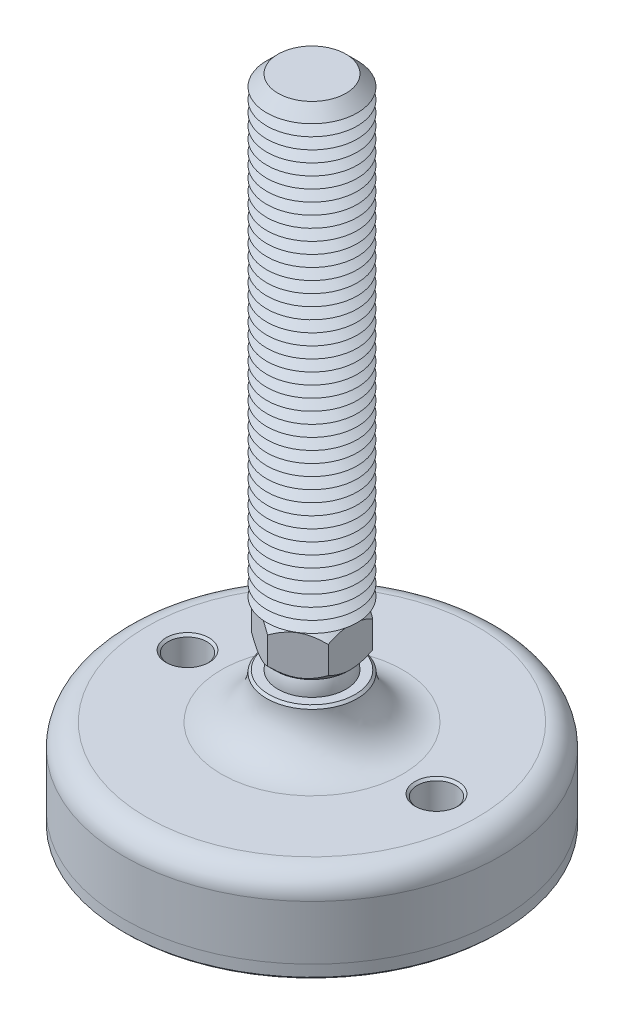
ISO-10303-21;
HEADER;
FILE_DESCRIPTION(('STEP AP214'),'2;1');
FILE_NAME('part.step','',(''),(''),'','','');
FILE_SCHEMA(('AUTOMOTIVE_DESIGN { 1 0 10303 214 1 1 1 1 }'));
ENDSEC;
DATA;
#1=APPLICATION_CONTEXT('core data for automotive mechanical design processes');
#2=APPLICATION_PROTOCOL_DEFINITION('international standard','automotive_design',2000,#1);
#3=PRODUCT_CONTEXT('',#1,'mechanical');
#4=PRODUCT('Part','Part','',(#3));
#5=PRODUCT_RELATED_PRODUCT_CATEGORY('part','',(#4));
#6=PRODUCT_DEFINITION_FORMATION('','',#4);
#7=PRODUCT_DEFINITION_CONTEXT('part definition',#1,'design');
#8=PRODUCT_DEFINITION('design','',#6,#7);
#9=PRODUCT_DEFINITION_SHAPE('','',#8);
#10=(LENGTH_UNIT() NAMED_UNIT(*) SI_UNIT(.MILLI.,.METRE.));
#11=(NAMED_UNIT(*) PLANE_ANGLE_UNIT() SI_UNIT($,.RADIAN.));
#12=(NAMED_UNIT(*) SI_UNIT($,.STERADIAN.) SOLID_ANGLE_UNIT());
#13=UNCERTAINTY_MEASURE_WITH_UNIT(LENGTH_MEASURE(1.E-05),#10,'distance_accuracy_value','');
#14=(GEOMETRIC_REPRESENTATION_CONTEXT(3) GLOBAL_UNCERTAINTY_ASSIGNED_CONTEXT((#13)) GLOBAL_UNIT_ASSIGNED_CONTEXT((#10,
#11,#12)) REPRESENTATION_CONTEXT('',''));
#15=CARTESIAN_POINT('',(0.,0.,0.));
#16=DIRECTION('',(0.,0.,1.));
#17=DIRECTION('',(1.,0.,0.));
#18=AXIS2_PLACEMENT_3D('',#15,#16,#17);
#19=CARTESIAN_POINT('',(0.,-27.,0.));
#20=DIRECTION('',(0.,1.,0.));
#21=DIRECTION('',(0.,0.,1.));
#22=AXIS2_PLACEMENT_3D('',#19,#20,#21);
#23=PLANE('',#22);
#24=CARTESIAN_POINT('',(-27.5,-27.,0.));
#25=DIRECTION('',(0.,1.,0.));
#26=DIRECTION('',(0.,0.,1.));
#27=AXIS2_PLACEMENT_3D('',#24,#25,#26);
#28=CIRCLE('',#27,4.25000000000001);
#29=CARTESIAN_POINT('',(-27.5,-27.,4.25000000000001));
#30=VERTEX_POINT('',#29);
#31=EDGE_CURVE('P0_E43',#30,#30,#28,.T.);
#32=ORIENTED_EDGE('',*,*,#31,.F.);
#33=EDGE_LOOP('',(#32));
#34=FACE_BOUND('',#33,.T.);
#35=CARTESIAN_POINT('',(27.5,-27.,0.));
#36=DIRECTION('',(0.,1.,0.));
#37=DIRECTION('',(0.,0.,1.));
#38=AXIS2_PLACEMENT_3D('',#35,#36,#37);
#39=CIRCLE('',#38,4.25000000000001);
#40=CARTESIAN_POINT('',(27.5,-27.,4.25000000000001));
#41=VERTEX_POINT('',#40);
#42=EDGE_CURVE('P0_E44',#41,#41,#39,.T.);
#43=ORIENTED_EDGE('',*,*,#42,.F.);
#44=EDGE_LOOP('',(#43));
#45=FACE_BOUND('',#44,.T.);
#46=CARTESIAN_POINT('',(0.,-27.,0.));
#47=DIRECTION('',(0.,1.,0.));
#48=DIRECTION('',(0.,0.,1.));
#49=AXIS2_PLACEMENT_3D('',#46,#47,#48);
#50=CIRCLE('',#49,41.5);
#51=CARTESIAN_POINT('',(0.,-27.,41.5));
#52=VERTEX_POINT('',#51);
#53=EDGE_CURVE('P0_E40',#52,#52,#50,.T.);
#54=ORIENTED_EDGE('',*,*,#53,.T.);
#55=EDGE_LOOP('',(#54));
#56=FACE_BOUND('',#55,.T.);
#57=ADVANCED_FACE('P0_F14',(#34,#45,#56),#23,.T.);
#58=CARTESIAN_POINT('',(0.,48.1654938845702,0.));
#59=DIRECTION('',(0.,1.,0.));
#60=DIRECTION('',(0.,0.,1.));
#61=AXIS2_PLACEMENT_3D('',#58,#59,#60);
#62=CYLINDRICAL_SURFACE('',#61,41.5);
#63=CARTESIAN_POINT('',(0.,-29.5,0.));
#64=DIRECTION('',(0.,-1.,0.));
#65=DIRECTION('',(0.,0.,-1.));
#66=AXIS2_PLACEMENT_3D('',#63,#64,#65);
#67=CIRCLE('',#66,41.5);
#68=CARTESIAN_POINT('',(0.,-29.5,-41.5));
#69=VERTEX_POINT('',#68);
#70=EDGE_CURVE('P0_E37',#69,#69,#67,.F.);
#71=ORIENTED_EDGE('',*,*,#70,.T.);
#72=EDGE_LOOP('',(#71));
#73=FACE_BOUND('',#72,.T.);
#74=ORIENTED_EDGE('',*,*,#53,.F.);
#75=EDGE_LOOP('',(#74));
#76=FACE_BOUND('',#75,.T.);
#77=ADVANCED_FACE('P0_F54',(#73,#76),#62,.T.);
#78=CARTESIAN_POINT('',(0.,-30.,41.5));
#79=DIRECTION('',(0.,-1.,0.));
#80=DIRECTION('',(0.,0.,-1.));
#81=AXIS2_PLACEMENT_3D('',#78,#79,#80);
#82=PLANE('',#81);
#83=CARTESIAN_POINT('',(27.5,-30.,0.));
#84=DIRECTION('',(0.,-1.,0.));
#85=DIRECTION('',(0.,0.,-1.));
#86=AXIS2_PLACEMENT_3D('',#83,#84,#85);
#87=CIRCLE('',#86,4.75);
#88=CARTESIAN_POINT('',(27.5,-30.,-4.75000000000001));
#89=VERTEX_POINT('',#88);
#90=EDGE_CURVE('P0_E25',#89,#89,#87,.F.);
#91=ORIENTED_EDGE('',*,*,#90,.T.);
#92=EDGE_LOOP('',(#91));
#93=FACE_BOUND('',#92,.T.);
#94=CARTESIAN_POINT('',(-27.5,-30.,0.));
#95=DIRECTION('',(0.,-1.,0.));
#96=DIRECTION('',(0.,0.,-1.));
#97=AXIS2_PLACEMENT_3D('',#94,#95,#96);
#98=CIRCLE('',#97,4.75);
#99=CARTESIAN_POINT('',(-27.5,-30.,-4.75));
#100=VERTEX_POINT('',#99);
#101=EDGE_CURVE('P0_E29',#100,#100,#98,.F.);
#102=ORIENTED_EDGE('',*,*,#101,.T.);
#103=EDGE_LOOP('',(#102));
#104=FACE_BOUND('',#103,.T.);
#105=CARTESIAN_POINT('',(0.,-30.,0.));
#106=DIRECTION('',(0.,-1.,0.));
#107=DIRECTION('',(0.,0.,-1.));
#108=AXIS2_PLACEMENT_3D('',#105,#106,#107);
#109=CIRCLE('',#108,41.);
#110=CARTESIAN_POINT('',(0.,-30.,-41.));
#111=VERTEX_POINT('',#110);
#112=EDGE_CURVE('P0_E34',#111,#111,#109,.T.);
#113=ORIENTED_EDGE('',*,*,#112,.T.);
#114=EDGE_LOOP('',(#113));
#115=FACE_BOUND('',#114,.T.);
#116=ADVANCED_FACE('P0_F61',(#93,#104,#115),#82,.T.);
#117=CARTESIAN_POINT('',(0.,-29.5,0.));
#118=DIRECTION('',(0.,1.,0.));
#119=DIRECTION('',(0.,0.,1.));
#120=AXIS2_PLACEMENT_3D('',#117,#118,#119);
#121=CONICAL_SURFACE('',#120,41.5,0.785398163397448);
#122=ORIENTED_EDGE('',*,*,#112,.F.);
#123=EDGE_LOOP('',(#122));
#124=FACE_BOUND('',#123,.T.);
#125=ORIENTED_EDGE('',*,*,#70,.F.);
#126=EDGE_LOOP('',(#125));
#127=FACE_BOUND('',#126,.T.);
#128=ADVANCED_FACE('P0_F68',(#124,#127),#121,.T.);
#129=CARTESIAN_POINT('',(27.5,-30.,0.));
#130=DIRECTION('',(0.,1.,0.));
#131=DIRECTION('',(0.,0.,1.));
#132=AXIS2_PLACEMENT_3D('',#129,#130,#131);
#133=CYLINDRICAL_SURFACE('',#132,4.25000000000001);
#134=CARTESIAN_POINT('',(27.5,-29.5,0.));
#135=DIRECTION('',(0.,-1.,0.));
#136=DIRECTION('',(0.,0.,-1.));
#137=AXIS2_PLACEMENT_3D('',#134,#135,#136);
#138=CIRCLE('',#137,4.25000000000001);
#139=CARTESIAN_POINT('',(27.5,-29.5,-4.25000000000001));
#140=VERTEX_POINT('',#139);
#141=EDGE_CURVE('P0_E21',#140,#140,#138,.T.);
#142=ORIENTED_EDGE('',*,*,#141,.T.);
#143=EDGE_LOOP('',(#142));
#144=FACE_BOUND('',#143,.T.);
#145=ORIENTED_EDGE('',*,*,#42,.T.);
#146=EDGE_LOOP('',(#145));
#147=FACE_BOUND('',#146,.T.);
#148=ADVANCED_FACE('P0_F74',(#144,#147),#133,.F.);
#149=CARTESIAN_POINT('',(-27.5,-30.,0.));
#150=DIRECTION('',(0.,1.,0.));
#151=DIRECTION('',(0.,0.,1.));
#152=AXIS2_PLACEMENT_3D('',#149,#150,#151);
#153=CYLINDRICAL_SURFACE('',#152,4.25000000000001);
#154=CARTESIAN_POINT('',(-27.5,-29.5,0.));
#155=DIRECTION('',(0.,-1.,0.));
#156=DIRECTION('',(0.,0.,-1.));
#157=AXIS2_PLACEMENT_3D('',#154,#155,#156);
#158=CIRCLE('',#157,4.25000000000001);
#159=CARTESIAN_POINT('',(-27.5,-29.5,-4.25000000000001));
#160=VERTEX_POINT('',#159);
#161=EDGE_CURVE('P0_E10',#160,#160,#158,.T.);
#162=ORIENTED_EDGE('',*,*,#161,.T.);
#163=EDGE_LOOP('',(#162));
#164=FACE_BOUND('',#163,.T.);
#165=ORIENTED_EDGE('',*,*,#31,.T.);
#166=EDGE_LOOP('',(#165));
#167=FACE_BOUND('',#166,.T.);
#168=ADVANCED_FACE('P0_F50',(#164,#167),#153,.F.);
#169=CARTESIAN_POINT('',(27.5,-30.,0.));
#170=DIRECTION('',(0.,-1.,0.));
#171=DIRECTION('',(0.,0.,-1.));
#172=AXIS2_PLACEMENT_3D('',#169,#170,#171);
#173=CONICAL_SURFACE('',#172,4.75,0.785398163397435);
#174=ORIENTED_EDGE('',*,*,#141,.F.);
#175=EDGE_LOOP('',(#174));
#176=FACE_BOUND('',#175,.T.);
#177=ORIENTED_EDGE('',*,*,#90,.F.);
#178=EDGE_LOOP('',(#177));
#179=FACE_BOUND('',#178,.T.);
#180=ADVANCED_FACE('P0_F76',(#176,#179),#173,.F.);
#181=CARTESIAN_POINT('',(-27.5,-30.,0.));
#182=DIRECTION('',(0.,-1.,0.));
#183=DIRECTION('',(0.,0.,-1.));
#184=AXIS2_PLACEMENT_3D('',#181,#182,#183);
#185=CONICAL_SURFACE('',#184,4.75,0.785398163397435);
#186=ORIENTED_EDGE('',*,*,#161,.F.);
#187=EDGE_LOOP('',(#186));
#188=FACE_BOUND('',#187,.T.);
#189=ORIENTED_EDGE('',*,*,#101,.F.);
#190=EDGE_LOOP('',(#189));
#191=FACE_BOUND('',#190,.T.);
#192=ADVANCED_FACE('P0_F16',(#188,#191),#185,.F.);
#193=CLOSED_SHELL('',(#57,#77,#116,#128,#148,#168,#180,#192));
#194=MANIFOLD_SOLID_BREP('P0_B1',#193);
#195=CARTESIAN_POINT('',(0.,3.75,0.));
#196=DIRECTION('',(0.,1.,0.));
#197=DIRECTION('',(0.,0.,1.));
#198=AXIS2_PLACEMENT_3D('',#195,#196,#197);
#199=PLANE('',#198);
#200=CARTESIAN_POINT('',(0.,3.75,0.));
#201=DIRECTION('',(0.,1.,0.));
#202=DIRECTION('',(0.,0.,1.));
#203=AXIS2_PLACEMENT_3D('',#200,#201,#202);
#204=CIRCLE('',#203,7.99624373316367);
#205=CARTESIAN_POINT('',(0.,3.75,7.99624373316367));
#206=VERTEX_POINT('',#205);
#207=EDGE_CURVE('P1_E211',#206,#206,#204,.T.);
#208=ORIENTED_EDGE('',*,*,#207,.F.);
#209=EDGE_LOOP('',(#208));
#210=FACE_BOUND('',#209,.T.);
#211=CARTESIAN_POINT('',(0.,3.75,0.));
#212=DIRECTION('',(0.,1.,0.));
#213=DIRECTION('',(0.,0.,1.));
#214=AXIS2_PLACEMENT_3D('',#211,#212,#213);
#215=CIRCLE('',#214,6.49519052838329);
#216=CARTESIAN_POINT('',(0.,3.75,6.49519052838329));
#217=VERTEX_POINT('',#216);
#218=EDGE_CURVE('P1_E24',#217,#217,#215,.F.);
#219=ORIENTED_EDGE('',*,*,#218,.F.);
#220=EDGE_LOOP('',(#219));
#221=FACE_BOUND('',#220,.T.);
#222=ADVANCED_FACE('P1_F16',(#210,#221),#199,.F.);
#223=CARTESIAN_POINT('',(0.,0.,0.));
#224=DIRECTION('',(0.,1.,0.));
#225=DIRECTION('',(0.,0.,-1.));
#226=AXIS2_PLACEMENT_3D('',#223,#224,#225);
#227=SPHERICAL_SURFACE('',#226,7.5);
#228=ORIENTED_EDGE('',*,*,#218,.T.);
#229=EDGE_LOOP('',(#228));
#230=FACE_BOUND('',#229,.T.);
#231=ADVANCED_FACE('P1_F201',(#230),#227,.T.);
#232=CARTESIAN_POINT('',(0.,3.75,0.));
#233=DIRECTION('',(0.,1.,0.));
#234=DIRECTION('',(0.,0.,1.));
#235=AXIS2_PLACEMENT_3D('',#232,#233,#234);
#236=CONICAL_SURFACE('',#235,7.99624373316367,0.785398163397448);
#237=ORIENTED_EDGE('',*,*,#207,.T.);
#238=EDGE_LOOP('',(#237));
#239=FACE_BOUND('',#238,.T.);
#240=CARTESIAN_POINT('',(-8.5,8.90811002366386,-10.0392740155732));
#241=CARTESIAN_POINT('',(-8.5,8.72243436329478,-9.79593020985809));
#242=CARTESIAN_POINT('',(-8.5,8.53847898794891,-9.55125250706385));
#243=CARTESIAN_POINT('',(-8.5,8.17478786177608,-9.05869243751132));
#244=CARTESIAN_POINT('',(-8.5,7.99505314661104,-8.81080930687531));
#245=CARTESIAN_POINT('',(-8.5,7.63930320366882,-8.30948839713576));
#246=CARTESIAN_POINT('',(-8.5,7.46332748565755,-8.05602248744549));
#247=CARTESIAN_POINT('',(-8.5,7.11769199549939,-7.54483399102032));
#248=CARTESIAN_POINT('',(-8.5,6.94803178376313,-7.28711170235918));
#249=CARTESIAN_POINT('',(-8.5,6.60640236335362,-6.75094027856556));
#250=CARTESIAN_POINT('',(-8.5,6.43491645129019,-6.47218164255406));
#251=CARTESIAN_POINT('',(-8.5,6.10286460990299,-5.90813314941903));
#252=CARTESIAN_POINT('',(-8.5,5.94230047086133,-5.62284223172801));
#253=CARTESIAN_POINT('',(-8.5,5.63553180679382,-5.04569727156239));
#254=CARTESIAN_POINT('',(-8.5,5.48928508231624,-4.75386583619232));
#255=CARTESIAN_POINT('',(-8.5,5.21442695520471,-4.16207917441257));
#256=CARTESIAN_POINT('',(-8.5,5.08580737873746,-3.86212779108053));
#257=CARTESIAN_POINT('',(-8.5,4.86150447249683,-3.28118098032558));
#258=CARTESIAN_POINT('',(-8.5,4.7638906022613,-3.00093864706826));
#259=CARTESIAN_POINT('',(-8.5,4.59111419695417,-2.43348682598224));
#260=CARTESIAN_POINT('',(-8.5,4.51595314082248,-2.14627688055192));
#261=CARTESIAN_POINT('',(-8.5,4.39333737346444,-1.57150580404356));
#262=CARTESIAN_POINT('',(-8.5,4.34539220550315,-1.28405106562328));
#263=CARTESIAN_POINT('',(-8.5,4.27817908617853,-0.705789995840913));
#264=CARTESIAN_POINT('',(-8.5,4.25890565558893,-0.41498431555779));
#265=CARTESIAN_POINT('',(-8.5,4.25058550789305,0.155345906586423));
#266=CARTESIAN_POINT('',(-8.5,4.2603535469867,0.434853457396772));
#267=CARTESIAN_POINT('',(-8.5,4.30689978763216,0.991595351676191));
#268=CARTESIAN_POINT('',(-8.5,4.34368052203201,1.26882947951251));
#269=CARTESIAN_POINT('',(-8.5,4.44283018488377,1.82371054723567));
#270=CARTESIAN_POINT('',(-8.5,4.50564357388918,2.10127674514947));
#271=CARTESIAN_POINT('',(-8.5,4.65343378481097,2.6503272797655));
#272=CARTESIAN_POINT('',(-8.5,4.73840907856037,2.9218120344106));
#273=CARTESIAN_POINT('',(-8.5,4.93373614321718,3.47773657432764));
#274=CARTESIAN_POINT('',(-8.5,5.04548526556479,3.7616800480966));
#275=CARTESIAN_POINT('',(-8.5,5.28620549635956,4.3222352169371));
#276=CARTESIAN_POINT('',(-8.5,5.41518447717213,4.59884349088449));
#277=CARTESIAN_POINT('',(-8.5,5.68730204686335,5.14605293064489));
#278=CARTESIAN_POINT('',(-8.5,5.8304846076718,5.41663205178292));
#279=CARTESIAN_POINT('',(-8.5,6.1278527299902,5.95157955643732));
#280=CARTESIAN_POINT('',(-8.5,6.28203657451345,6.21594890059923));
#281=CARTESIAN_POINT('',(-8.5,6.59139861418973,6.7263367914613));
#282=CARTESIAN_POINT('',(-8.5,6.74614943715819,6.97261575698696));
#283=CARTESIAN_POINT('',(-8.5,7.06220691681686,7.46094357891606));
#284=CARTESIAN_POINT('',(-8.5,7.22351406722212,7.70299211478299));
#285=CARTESIAN_POINT('',(-8.5,7.55019288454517,8.18145952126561));
#286=CARTESIAN_POINT('',(-8.5,7.71552125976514,8.4179080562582));
#287=CARTESIAN_POINT('',(-8.5,8.05058640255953,8.88756615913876));
#288=CARTESIAN_POINT('',(-8.5,8.22032194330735,9.12077660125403));
#289=CARTESIAN_POINT('',(-8.5,8.39186061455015,9.35262965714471));
#290=B_SPLINE_CURVE_WITH_KNOTS('',3,(#240,#241,#242,#243,#244,#245,#246,#247,#248,#249,#250,
#251,#252,#253,#254,#255,#256,#257,#258,#259,#260,#261,#262,#263,#264,#265,#266,#267,#268,#269,
#270,#271,#272,#273,#274,#275,#276,#277,#278,#279,#280,#281,#282,#283,#284,#285,#286,#287,#288,
#289),.UNSPECIFIED.,.F.,.F.,(4,2,2,2,2,2,2,2,2,2,2,2,2,2,2,2,2,2,2,2,2,2,2,2,4),(0.,
0.918290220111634,1.8368034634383,2.76241942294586,3.68797083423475,4.66961920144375,
5.65142809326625,6.63025007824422,7.60861662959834,8.49811159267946,9.38766513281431,
10.2606329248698,11.1334338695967,11.9711093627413,12.8088634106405,13.6615517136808,
14.5141812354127,15.4289018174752,16.3440417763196,17.2621089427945,18.1800331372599,
19.0524996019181,19.9250318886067,20.7905246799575,21.6557790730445),.UNSPECIFIED.);
#291=CARTESIAN_POINT('',(-8.5,5.56871084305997,-4.90747728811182));
#292=VERTEX_POINT('',#291);
#293=CARTESIAN_POINT('',(-8.5,5.56871084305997,4.90747728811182));
#294=VERTEX_POINT('',#293);
#295=EDGE_CURVE('P1_E185',#292,#294,#290,.T.);
#296=ORIENTED_EDGE('',*,*,#295,.F.);
#297=CARTESIAN_POINT('',(0.000199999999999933,5.5688263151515,-9.81507004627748));
#298=CARTESIAN_POINT('',(-0.145938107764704,5.48446627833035,-9.73069717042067));
#299=CARTESIAN_POINT('',(-0.293216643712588,5.40268088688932,-9.6456658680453));
#300=CARTESIAN_POINT('',(-0.590240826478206,5.24507616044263,-9.47417887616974));
#301=CARTESIAN_POINT('',(-0.739987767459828,5.16926008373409,-9.38772243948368));
#302=CARTESIAN_POINT('',(-1.0428413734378,5.02408965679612,-9.21286982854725));
#303=CARTESIAN_POINT('',(-1.19596236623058,4.95477479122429,-9.12446538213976));
#304=CARTESIAN_POINT('',(-1.50468648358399,4.82411695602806,-8.94622342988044));
#305=CARTESIAN_POINT('',(-1.66028922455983,4.76277276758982,-8.85638614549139));
#306=CARTESIAN_POINT('',(-2.12594374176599,4.59407400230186,-8.58754038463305));
#307=CARTESIAN_POINT('',(-2.4397129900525,4.49965525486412,-8.4063856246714));
#308=CARTESIAN_POINT('',(-2.91546156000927,4.39044680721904,-8.13171205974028));
#309=CARTESIAN_POINT('',(-3.07473438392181,4.35946186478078,-8.03975585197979));
#310=CARTESIAN_POINT('',(-3.39463410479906,4.3089933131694,-7.85506166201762));
#311=CARTESIAN_POINT('',(-3.5552607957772,4.28950798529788,-7.76232379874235));
#312=CARTESIAN_POINT('',(-3.9466882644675,4.25683795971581,-7.5363330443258));
#313=CARTESIAN_POINT('',(-4.17791015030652,4.24998362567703,-7.4028370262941));
#314=CARTESIAN_POINT('',(-4.63993781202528,4.26149030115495,-7.13608523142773));
#315=CARTESIAN_POINT('',(-4.87074341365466,4.27986014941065,-7.00282955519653));
#316=CARTESIAN_POINT('',(-5.33017839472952,4.34073256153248,-6.73757464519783));
#317=CARTESIAN_POINT('',(-5.55880504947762,4.38326211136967,-6.60557698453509));
#318=CARTESIAN_POINT('',(-6.01212885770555,4.49014170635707,-6.34385036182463));
#319=CARTESIAN_POINT('',(-6.23682631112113,4.55449007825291,-6.21412122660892));
#320=CARTESIAN_POINT('',(-6.63569693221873,4.686871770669,-5.98383316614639));
#321=CARTESIAN_POINT('',(-6.81075347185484,4.75142294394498,-5.88276422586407));
#322=CARTESIAN_POINT('',(-7.15772421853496,4.89092708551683,-5.68244057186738));
#323=CARTESIAN_POINT('',(-7.3296383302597,4.96588036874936,-5.58318591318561));
#324=CARTESIAN_POINT('',(-7.6697827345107,5.12450866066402,-5.38680344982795));
#325=CARTESIAN_POINT('',(-7.8380227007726,5.20815624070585,-5.28967006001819));
#326=CARTESIAN_POINT('',(-8.17138743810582,5.38307502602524,-5.09720183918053));
#327=CARTESIAN_POINT('',(-8.33651404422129,5.47434155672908,-5.00186594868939));
#328=CARTESIAN_POINT('',(-8.5002,5.5688263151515,-4.90736181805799));
#329=B_SPLINE_CURVE_WITH_KNOTS('',3,(#297,#298,#299,#300,#301,#302,#303,#304,#305,#306,#307,
#308,#309,#310,#311,#312,#313,#314,#315,#316,#317,#318,#319,#320,#321,#322,#323,#324,#325,#326,
#327,#328),.UNSPECIFIED.,.F.,.F.,(4,2,2,2,2,2,2,2,2,2,2,2,2,2,2,4),(0.,0.565988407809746,
1.13228364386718,1.70182141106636,2.27127198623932,3.39189520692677,3.95110786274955,
4.510236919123,5.31023384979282,6.11051117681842,6.91168416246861,7.71279572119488,
8.34908108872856,8.98538572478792,9.61974061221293,10.2537091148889),.UNSPECIFIED.);
#330=CARTESIAN_POINT('',(0.,5.56871084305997,-9.81495457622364));
#331=VERTEX_POINT('',#330);
#332=EDGE_CURVE('P1_E179',#331,#292,#329,.T.);
#333=ORIENTED_EDGE('',*,*,#332,.F.);
#334=CARTESIAN_POINT('',(8.5002,5.56882631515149,-4.90736181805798));
#335=CARTESIAN_POINT('',(8.3540618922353,5.48446627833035,-4.9917346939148));
#336=CARTESIAN_POINT('',(8.20678335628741,5.40268088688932,-5.07676599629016));
#337=CARTESIAN_POINT('',(7.90975917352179,5.24507616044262,-5.24825298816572));
#338=CARTESIAN_POINT('',(7.76001223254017,5.16926008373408,-5.33470942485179));
#339=CARTESIAN_POINT('',(7.4571586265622,5.02408965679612,-5.50956203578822));
#340=CARTESIAN_POINT('',(7.30403763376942,4.95477479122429,-5.59796648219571));
#341=CARTESIAN_POINT('',(6.99531351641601,4.82411695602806,-5.77620843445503));
#342=CARTESIAN_POINT('',(6.83971077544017,4.76277276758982,-5.86604571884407));
#343=CARTESIAN_POINT('',(6.37405625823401,4.59407400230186,-6.13489147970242));
#344=CARTESIAN_POINT('',(6.0602870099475,4.49965525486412,-6.31604623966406));
#345=CARTESIAN_POINT('',(5.58453843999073,4.39044680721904,-6.59071980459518));
#346=CARTESIAN_POINT('',(5.42526561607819,4.35946186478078,-6.68267601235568));
#347=CARTESIAN_POINT('',(5.10536589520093,4.3089933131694,-6.86737020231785));
#348=CARTESIAN_POINT('',(4.9447392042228,4.28950798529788,-6.96010806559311));
#349=CARTESIAN_POINT('',(4.5533117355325,4.25683795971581,-7.18609882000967));
#350=CARTESIAN_POINT('',(4.32208984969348,4.24998362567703,-7.31959483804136));
#351=CARTESIAN_POINT('',(3.86006218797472,4.26149030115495,-7.58634663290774));
#352=CARTESIAN_POINT('',(3.62925658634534,4.27986014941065,-7.71960230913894));
#353=CARTESIAN_POINT('',(3.16982160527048,4.34073256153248,-7.98485721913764));
#354=CARTESIAN_POINT('',(2.94119495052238,4.38326211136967,-8.11685487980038));
#355=CARTESIAN_POINT('',(2.48787114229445,4.49014170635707,-8.37858150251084));
#356=CARTESIAN_POINT('',(2.26317368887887,4.55449007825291,-8.50831063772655));
#357=CARTESIAN_POINT('',(1.86430306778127,4.686871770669,-8.73859869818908));
#358=CARTESIAN_POINT('',(1.68924652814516,4.75142294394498,-8.83966763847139));
#359=CARTESIAN_POINT('',(1.34227578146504,4.89092708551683,-9.03999129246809));
#360=CARTESIAN_POINT('',(1.1703616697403,4.96588036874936,-9.13924595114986));
#361=CARTESIAN_POINT('',(0.8302172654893,5.12450866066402,-9.33562841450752));
#362=CARTESIAN_POINT('',(0.661977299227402,5.20815624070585,-9.43276180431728));
#363=CARTESIAN_POINT('',(0.328612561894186,5.38307502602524,-9.62523002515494));
#364=CARTESIAN_POINT('',(0.163485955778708,5.47434155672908,-9.72056591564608));
#365=CARTESIAN_POINT('',(-0.000200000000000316,5.5688263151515,-9.81507004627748));
#366=B_SPLINE_CURVE_WITH_KNOTS('',3,(#334,#335,#336,#337,#338,#339,#340,#341,#342,#343,#344,
#345,#346,#347,#348,#349,#350,#351,#352,#353,#354,#355,#356,#357,#358,#359,#360,#361,#362,#363,
#364,#365),.UNSPECIFIED.,.F.,.F.,(4,2,2,2,2,2,2,2,2,2,2,2,2,2,2,4),(0.,0.565988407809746,
1.13228364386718,1.70182141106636,2.27127198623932,3.39189520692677,3.95110786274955,
4.510236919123,5.31023384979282,6.11051117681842,6.91168416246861,7.71279572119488,
8.34908108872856,8.98538572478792,9.61974061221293,10.2537091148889),.UNSPECIFIED.);
#367=CARTESIAN_POINT('',(8.5,5.56871084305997,-4.90747728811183));
#368=VERTEX_POINT('',#367);
#369=EDGE_CURVE('P1_E167',#368,#331,#366,.T.);
#370=ORIENTED_EDGE('',*,*,#369,.F.);
#371=CARTESIAN_POINT('',(8.5,8.90811002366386,-10.0392740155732));
#372=CARTESIAN_POINT('',(8.5,8.72243436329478,-9.79593020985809));
#373=CARTESIAN_POINT('',(8.5,8.5384789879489,-9.55125250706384));
#374=CARTESIAN_POINT('',(8.5,8.17478786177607,-9.05869243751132));
#375=CARTESIAN_POINT('',(8.5,7.99505314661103,-8.81080930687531));
#376=CARTESIAN_POINT('',(8.5,7.63930320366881,-8.30948839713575));
#377=CARTESIAN_POINT('',(8.5,7.46332748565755,-8.05602248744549));
#378=CARTESIAN_POINT('',(8.5,7.11769199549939,-7.54483399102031));
#379=CARTESIAN_POINT('',(8.5,6.94803178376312,-7.28711170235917));
#380=CARTESIAN_POINT('',(8.5,6.60640236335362,-6.75094027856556));
#381=CARTESIAN_POINT('',(8.5,6.43491645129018,-6.47218164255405));
#382=CARTESIAN_POINT('',(8.5,6.10286460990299,-5.90813314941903));
#383=CARTESIAN_POINT('',(8.5,5.94230047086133,-5.62284223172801));
#384=CARTESIAN_POINT('',(8.5,5.63553180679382,-5.04569727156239));
#385=CARTESIAN_POINT('',(8.5,5.48928508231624,-4.75386583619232));
#386=CARTESIAN_POINT('',(8.5,5.21442695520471,-4.16207917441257));
#387=CARTESIAN_POINT('',(8.5,5.08580737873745,-3.86212779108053));
#388=CARTESIAN_POINT('',(8.5,4.86150447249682,-3.28118098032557));
#389=CARTESIAN_POINT('',(8.5,4.7638906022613,-3.00093864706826));
#390=CARTESIAN_POINT('',(8.5,4.59111419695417,-2.43348682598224));
#391=CARTESIAN_POINT('',(8.5,4.51595314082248,-2.14627688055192));
#392=CARTESIAN_POINT('',(8.5,4.39333737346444,-1.57150580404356));
#393=CARTESIAN_POINT('',(8.5,4.34539220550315,-1.28405106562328));
#394=CARTESIAN_POINT('',(8.5,4.27817908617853,-0.705789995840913));
#395=CARTESIAN_POINT('',(8.5,4.25890565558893,-0.41498431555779));
#396=CARTESIAN_POINT('',(8.5,4.25058550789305,0.155345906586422));
#397=CARTESIAN_POINT('',(8.5,4.2603535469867,0.434853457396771));
#398=CARTESIAN_POINT('',(8.5,4.30689978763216,0.99159535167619));
#399=CARTESIAN_POINT('',(8.5,4.34368052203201,1.2688294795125));
#400=CARTESIAN_POINT('',(8.5,4.44283018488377,1.82371054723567));
#401=CARTESIAN_POINT('',(8.5,4.50564357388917,2.10127674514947));
#402=CARTESIAN_POINT('',(8.5,4.65343378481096,2.65032727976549));
#403=CARTESIAN_POINT('',(8.5,4.73840907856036,2.9218120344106));
#404=CARTESIAN_POINT('',(8.5,4.93373614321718,3.47773657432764));
#405=CARTESIAN_POINT('',(8.5,5.04548526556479,3.7616800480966));
#406=CARTESIAN_POINT('',(8.5,5.28620549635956,4.3222352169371));
#407=CARTESIAN_POINT('',(8.5,5.41518447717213,4.59884349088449));
#408=CARTESIAN_POINT('',(8.5,5.68730204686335,5.14605293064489));
#409=CARTESIAN_POINT('',(8.5,5.8304846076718,5.41663205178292));
#410=CARTESIAN_POINT('',(8.5,6.1278527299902,5.95157955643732));
#411=CARTESIAN_POINT('',(8.5,6.28203657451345,6.21594890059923));
#412=CARTESIAN_POINT('',(8.5,6.59139861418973,6.7263367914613));
#413=CARTESIAN_POINT('',(8.5,6.74614943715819,6.97261575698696));
#414=CARTESIAN_POINT('',(8.5,7.06220691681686,7.46094357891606));
#415=CARTESIAN_POINT('',(8.5,7.22351406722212,7.70299211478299));
#416=CARTESIAN_POINT('',(8.5,7.55019288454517,8.18145952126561));
#417=CARTESIAN_POINT('',(8.5,7.71552125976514,8.4179080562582));
#418=CARTESIAN_POINT('',(8.5,8.05058640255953,8.88756615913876));
#419=CARTESIAN_POINT('',(8.5,8.22032194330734,9.12077660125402));
#420=CARTESIAN_POINT('',(8.5,8.39186061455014,9.35262965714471));
#421=B_SPLINE_CURVE_WITH_KNOTS('',3,(#371,#372,#373,#374,#375,#376,#377,#378,#379,#380,#381,
#382,#383,#384,#385,#386,#387,#388,#389,#390,#391,#392,#393,#394,#395,#396,#397,#398,#399,#400,
#401,#402,#403,#404,#405,#406,#407,#408,#409,#410,#411,#412,#413,#414,#415,#416,#417,#418,#419,
#420),.UNSPECIFIED.,.F.,.F.,(4,2,2,2,2,2,2,2,2,2,2,2,2,2,2,2,2,2,2,2,2,2,2,2,4),(0.,
0.918290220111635,1.8368034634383,2.76241942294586,3.68797083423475,4.66961920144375,
5.65142809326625,6.63025007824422,7.60861662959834,8.49811159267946,9.38766513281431,
10.2606329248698,11.1334338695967,11.9711093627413,12.8088634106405,13.6615517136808,
14.5141812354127,15.4289018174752,16.3440417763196,17.2621089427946,18.1800331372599,
19.0524996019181,19.9250318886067,20.7905246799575,21.6557790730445),.UNSPECIFIED.);
#422=CARTESIAN_POINT('',(8.5,5.56871084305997,4.90747728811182));
#423=VERTEX_POINT('',#422);
#424=EDGE_CURVE('P1_E70',#423,#368,#421,.F.);
#425=ORIENTED_EDGE('',*,*,#424,.F.);
#426=CARTESIAN_POINT('',(-0.000200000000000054,5.56882631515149,9.81507004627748));
#427=CARTESIAN_POINT('',(0.145938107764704,5.48446627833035,9.73069717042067));
#428=CARTESIAN_POINT('',(0.293216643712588,5.40268088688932,9.6456658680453));
#429=CARTESIAN_POINT('',(0.590240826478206,5.24507616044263,9.47417887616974));
#430=CARTESIAN_POINT('',(0.739987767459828,5.16926008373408,9.38772243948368));
#431=CARTESIAN_POINT('',(1.0428413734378,5.02408965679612,9.21286982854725));
#432=CARTESIAN_POINT('',(1.19596236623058,4.95477479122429,9.12446538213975));
#433=CARTESIAN_POINT('',(1.50468648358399,4.82411695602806,8.94622342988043));
#434=CARTESIAN_POINT('',(1.66028922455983,4.76277276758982,8.85638614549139));
#435=CARTESIAN_POINT('',(2.12594374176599,4.59407400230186,8.58754038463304));
#436=CARTESIAN_POINT('',(2.4397129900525,4.49965525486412,8.4063856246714));
#437=CARTESIAN_POINT('',(2.91546156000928,4.39044680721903,8.13171205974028));
#438=CARTESIAN_POINT('',(3.07473438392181,4.35946186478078,8.03975585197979));
#439=CARTESIAN_POINT('',(3.39463410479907,4.3089933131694,7.85506166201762));
#440=CARTESIAN_POINT('',(3.55526079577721,4.28950798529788,7.76232379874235));
#441=CARTESIAN_POINT('',(3.9466882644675,4.25683795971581,7.53633304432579));
#442=CARTESIAN_POINT('',(4.17791015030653,4.24998362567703,7.4028370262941));
#443=CARTESIAN_POINT('',(4.63993781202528,4.26149030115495,7.13608523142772));
#444=CARTESIAN_POINT('',(4.87074341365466,4.27986014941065,7.00282955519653));
#445=CARTESIAN_POINT('',(5.33017839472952,4.34073256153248,6.73757464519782));
#446=CARTESIAN_POINT('',(5.55880504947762,4.38326211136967,6.60557698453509));
#447=CARTESIAN_POINT('',(6.01212885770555,4.49014170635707,6.34385036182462));
#448=CARTESIAN_POINT('',(6.23682631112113,4.55449007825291,6.21412122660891));
#449=CARTESIAN_POINT('',(6.63569693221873,4.686871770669,5.98383316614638));
#450=CARTESIAN_POINT('',(6.81075347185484,4.75142294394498,5.88276422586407));
#451=CARTESIAN_POINT('',(7.15772421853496,4.89092708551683,5.68244057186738));
#452=CARTESIAN_POINT('',(7.3296383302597,4.96588036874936,5.58318591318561));
#453=CARTESIAN_POINT('',(7.6697827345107,5.12450866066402,5.38680344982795));
#454=CARTESIAN_POINT('',(7.8380227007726,5.20815624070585,5.28967006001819));
#455=CARTESIAN_POINT('',(8.17138743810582,5.38307502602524,5.09720183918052));
#456=CARTESIAN_POINT('',(8.33651404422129,5.47434155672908,5.00186594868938));
#457=CARTESIAN_POINT('',(8.5002,5.56882631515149,4.90736181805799));
#458=B_SPLINE_CURVE_WITH_KNOTS('',3,(#426,#427,#428,#429,#430,#431,#432,#433,#434,#435,#436,
#437,#438,#439,#440,#441,#442,#443,#444,#445,#446,#447,#448,#449,#450,#451,#452,#453,#454,#455,
#456,#457),.UNSPECIFIED.,.F.,.F.,(4,2,2,2,2,2,2,2,2,2,2,2,2,2,2,4),(0.,0.565988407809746,
1.13228364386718,1.70182141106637,2.27127198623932,3.39189520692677,3.95110786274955,
4.51023691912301,5.31023384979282,6.11051117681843,6.91168416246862,7.71279572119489,
8.34908108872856,8.98538572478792,9.61974061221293,10.2537091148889),.UNSPECIFIED.);
#459=CARTESIAN_POINT('',(0.,5.56871084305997,9.81495457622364));
#460=VERTEX_POINT('',#459);
#461=EDGE_CURVE('P1_E67',#460,#423,#458,.T.);
#462=ORIENTED_EDGE('',*,*,#461,.F.);
#463=CARTESIAN_POINT('',(-8.5002,5.56882631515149,4.90736181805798));
#464=CARTESIAN_POINT('',(-8.3540618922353,5.48446627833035,4.9917346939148));
#465=CARTESIAN_POINT('',(-8.20678335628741,5.40268088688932,5.07676599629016));
#466=CARTESIAN_POINT('',(-7.90975917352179,5.24507616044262,5.24825298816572));
#467=CARTESIAN_POINT('',(-7.76001223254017,5.16926008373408,5.33470942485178));
#468=CARTESIAN_POINT('',(-7.4571586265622,5.02408965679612,5.50956203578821));
#469=CARTESIAN_POINT('',(-7.30403763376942,4.95477479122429,5.59796648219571));
#470=CARTESIAN_POINT('',(-6.99531351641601,4.82411695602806,5.77620843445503));
#471=CARTESIAN_POINT('',(-6.83971077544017,4.76277276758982,5.86604571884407));
#472=CARTESIAN_POINT('',(-6.37405625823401,4.59407400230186,6.13489147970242));
#473=CARTESIAN_POINT('',(-6.0602870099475,4.49965525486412,6.31604623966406));
#474=CARTESIAN_POINT('',(-5.58453843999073,4.39044680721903,6.59071980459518));
#475=CARTESIAN_POINT('',(-5.42526561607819,4.35946186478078,6.68267601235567));
#476=CARTESIAN_POINT('',(-5.10536589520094,4.30899331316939,6.86737020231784));
#477=CARTESIAN_POINT('',(-4.9447392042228,4.28950798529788,6.96010806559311));
#478=CARTESIAN_POINT('',(-4.5533117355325,4.25683795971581,7.18609882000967));
#479=CARTESIAN_POINT('',(-4.32208984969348,4.24998362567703,7.31959483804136));
#480=CARTESIAN_POINT('',(-3.86006218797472,4.26149030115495,7.58634663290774));
#481=CARTESIAN_POINT('',(-3.62925658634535,4.27986014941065,7.71960230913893));
#482=CARTESIAN_POINT('',(-3.16982160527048,4.34073256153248,7.98485721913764));
#483=CARTESIAN_POINT('',(-2.94119495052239,4.38326211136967,8.11685487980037));
#484=CARTESIAN_POINT('',(-2.48787114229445,4.49014170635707,8.37858150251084));
#485=CARTESIAN_POINT('',(-2.26317368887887,4.55449007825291,8.50831063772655));
#486=CARTESIAN_POINT('',(-1.86430306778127,4.686871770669,8.73859869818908));
#487=CARTESIAN_POINT('',(-1.68924652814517,4.75142294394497,8.83966763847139));
#488=CARTESIAN_POINT('',(-1.34227578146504,4.89092708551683,9.03999129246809));
#489=CARTESIAN_POINT('',(-1.1703616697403,4.96588036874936,9.13924595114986));
#490=CARTESIAN_POINT('',(-0.830217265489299,5.12450866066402,9.33562841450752));
#491=CARTESIAN_POINT('',(-0.6619772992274,5.20815624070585,9.43276180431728));
#492=CARTESIAN_POINT('',(-0.328612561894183,5.38307502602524,9.62523002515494));
#493=CARTESIAN_POINT('',(-0.163485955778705,5.47434155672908,9.72056591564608));
#494=CARTESIAN_POINT('',(0.000200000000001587,5.5688263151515,9.81507004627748));
#495=B_SPLINE_CURVE_WITH_KNOTS('',3,(#463,#464,#465,#466,#467,#468,#469,#470,#471,#472,#473,
#474,#475,#476,#477,#478,#479,#480,#481,#482,#483,#484,#485,#486,#487,#488,#489,#490,#491,#492,
#493,#494),.UNSPECIFIED.,.F.,.F.,(4,2,2,2,2,2,2,2,2,2,2,2,2,2,2,4),(0.,0.565988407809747,
1.13228364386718,1.70182141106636,2.27127198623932,3.39189520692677,3.95110786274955,
4.510236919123,5.31023384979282,6.11051117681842,6.91168416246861,7.71279572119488,
8.34908108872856,8.98538572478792,9.61974061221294,10.2537091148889),.UNSPECIFIED.);
#496=EDGE_CURVE('P1_E39',#294,#460,#495,.T.);
#497=ORIENTED_EDGE('',*,*,#496,.F.);
#498=EDGE_LOOP('',(#296,#333,#370,#425,#462,#497));
#499=FACE_BOUND('',#498,.T.);
#500=ADVANCED_FACE('P1_F68',(#239,#499),#236,.T.);
#501=CARTESIAN_POINT('',(-8.5,14.,-4.90747728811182));
#502=DIRECTION('',(1.,0.,0.));
#503=DIRECTION('',(0.,0.,-1.));
#504=AXIS2_PLACEMENT_3D('',#501,#502,#503);
#505=PLANE('',#504);
#506=DIRECTION('',(0.,-1.,0.));
#507=VECTOR('',#506,1.);
#508=CARTESIAN_POINT('',(-8.5,14.,4.90747728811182));
#509=LINE('',#508,#507);
#510=CARTESIAN_POINT('',(-8.5,11.5462613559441,4.90747728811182));
#511=VERTEX_POINT('',#510);
#512=EDGE_CURVE('P1_E83',#511,#294,#509,.T.);
#513=ORIENTED_EDGE('',*,*,#512,.F.);
#514=CARTESIAN_POINT('',(-8.5,8.39798309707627,-9.78751273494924));
#515=CARTESIAN_POINT('',(-8.5,8.57787513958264,-9.54919755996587));
#516=CARTESIAN_POINT('',(-8.5,8.75602828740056,-9.30954807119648));
#517=CARTESIAN_POINT('',(-8.5,9.10807823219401,-8.827054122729));
#518=CARTESIAN_POINT('',(-8.5,9.2819739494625,-8.58420887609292));
#519=CARTESIAN_POINT('',(-8.5,9.62596686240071,-8.09302066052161));
#520=CARTESIAN_POINT('',(-8.5,9.79602418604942,-7.84464967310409));
#521=CARTESIAN_POINT('',(-8.5,10.1297912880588,-7.34369187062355));
#522=CARTESIAN_POINT('',(-8.5,10.2935015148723,-7.09110535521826));
#523=CARTESIAN_POINT('',(-8.5,10.6222985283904,-6.566468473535));
#524=CARTESIAN_POINT('',(-8.5,10.7869291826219,-6.29413078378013));
#525=CARTESIAN_POINT('',(-8.5,11.1053589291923,-5.74309849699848));
#526=CARTESIAN_POINT('',(-8.5,11.259156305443,-5.464402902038));
#527=CARTESIAN_POINT('',(-8.5,11.5526010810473,-4.90068072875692));
#528=CARTESIAN_POINT('',(-8.5,11.6922900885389,-4.61567598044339));
#529=CARTESIAN_POINT('',(-8.5,11.9543910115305,-4.0378936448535));
#530=CARTESIAN_POINT('',(-8.5,12.0768107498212,-3.74511964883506));
#531=CARTESIAN_POINT('',(-8.5,12.2910322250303,-3.17524396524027));
#532=CARTESIAN_POINT('',(-8.5,12.38450510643,-2.89877705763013));
#533=CARTESIAN_POINT('',(-8.5,12.5492711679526,-2.33918702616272));
#534=CARTESIAN_POINT('',(-8.5,12.6205628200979,-2.05606344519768));
#535=CARTESIAN_POINT('',(-8.5,12.7360573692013,-1.48955968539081));
#536=CARTESIAN_POINT('',(-8.5,12.7807243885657,-1.2062756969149));
#537=CARTESIAN_POINT('',(-8.5,12.8421027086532,-0.636679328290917));
#538=CARTESIAN_POINT('',(-8.5,12.8588188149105,-0.35036747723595));
#539=CARTESIAN_POINT('',(-8.5,12.8630538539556,0.212098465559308));
#540=CARTESIAN_POINT('',(-8.5,12.8516076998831,0.488245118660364));
#541=CARTESIAN_POINT('',(-8.5,12.8024337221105,1.03817300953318));
#542=CARTESIAN_POINT('',(-8.5,12.7647033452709,1.31195401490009));
#543=CARTESIAN_POINT('',(-8.5,12.6643776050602,1.85979788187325));
#544=CARTESIAN_POINT('',(-8.5,12.6013591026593,2.13378200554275));
#545=CARTESIAN_POINT('',(-8.5,12.4538179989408,2.67578043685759));
#546=CARTESIAN_POINT('',(-8.5,12.3692971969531,2.94379524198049));
#547=CARTESIAN_POINT('',(-8.5,12.1735358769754,3.49812653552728));
#548=CARTESIAN_POINT('',(-8.5,12.0605376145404,3.78381596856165));
#549=CARTESIAN_POINT('',(-8.5,11.8171932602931,4.34777400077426));
#550=CARTESIAN_POINT('',(-8.5,11.686839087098,4.62603907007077));
#551=CARTESIAN_POINT('',(-8.5,11.4118843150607,5.17650827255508));
#552=CARTESIAN_POINT('',(-8.5,11.2672389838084,5.44868988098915));
#553=CARTESIAN_POINT('',(-8.5,10.9668989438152,5.9867894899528));
#554=CARTESIAN_POINT('',(-8.5,10.811205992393,6.25270847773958));
#555=CARTESIAN_POINT('',(-8.5,10.4989138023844,6.76601719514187));
#556=CARTESIAN_POINT('',(-8.5,10.3427453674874,7.0136704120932));
#557=CARTESIAN_POINT('',(-8.5,10.0238413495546,7.50472523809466));
#558=CARTESIAN_POINT('',(-8.5,9.86110526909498,7.74812652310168));
#559=CARTESIAN_POINT('',(-8.5,9.53158408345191,8.22926020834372));
#560=CARTESIAN_POINT('',(-8.5,9.36484260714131,8.46702259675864));
#561=CARTESIAN_POINT('',(-8.5,9.02695015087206,8.93929808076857));
#562=CARTESIAN_POINT('',(-8.5,8.85580039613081,9.17381205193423));
#563=CARTESIAN_POINT('',(-8.5,8.68284834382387,9.40696575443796));
#564=B_SPLINE_CURVE_WITH_KNOTS('',3,(#514,#515,#516,#517,#518,#519,#520,#521,#522,#523,#524,
#525,#526,#527,#528,#529,#530,#531,#532,#533,#534,#535,#536,#537,#538,#539,#540,#541,#542,#543,
#544,#545,#546,#547,#548,#549,#550,#551,#552,#553,#554,#555,#556,#557,#558,#559,#560,#561,#562,
#563),.UNSPECIFIED.,.F.,.F.,(4,2,2,2,2,2,2,2,2,2,2,2,2,2,2,2,2,2,2,2,2,2,2,2,4),(0.,
0.895784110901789,1.79179309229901,2.69474460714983,3.59763220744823,4.55212531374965,
5.50676928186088,6.45851015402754,7.4098185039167,8.28457217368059,9.15938608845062,
10.0184667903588,10.8773997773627,11.7052430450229,12.5331667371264,13.3755635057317,
14.2178898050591,15.138846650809,16.060233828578,16.9846023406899,17.9088241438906,
18.7870452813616,19.6653330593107,20.5364863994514,21.4074001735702),.UNSPECIFIED.);
#565=CARTESIAN_POINT('',(-8.5,11.5462613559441,-4.90747728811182));
#566=VERTEX_POINT('',#565);
#567=EDGE_CURVE('P1_E84',#511,#566,#564,.F.);
#568=ORIENTED_EDGE('',*,*,#567,.T.);
#569=DIRECTION('',(0.,-1.,0.));
#570=VECTOR('',#569,1.);
#571=CARTESIAN_POINT('',(-8.5,14.,-4.90747728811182));
#572=LINE('',#571,#570);
#573=EDGE_CURVE('P1_E100',#566,#292,#572,.T.);
#574=ORIENTED_EDGE('',*,*,#573,.T.);
#575=ORIENTED_EDGE('',*,*,#295,.T.);
#576=EDGE_LOOP('',(#513,#568,#574,#575));
#577=FACE_BOUND('',#576,.T.);
#578=ADVANCED_FACE('P1_F193',(#577),#505,.F.);
#579=CARTESIAN_POINT('',(0.,14.,-9.81495457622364));
#580=DIRECTION('',(0.5,0.,0.866025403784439));
#581=DIRECTION('',(0.866025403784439,0.,-0.5));
#582=AXIS2_PLACEMENT_3D('',#579,#580,#581);
#583=PLANE('',#582);
#584=ORIENTED_EDGE('',*,*,#573,.F.);
#585=CARTESIAN_POINT('',(-8.5002,11.5461458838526,-4.90736181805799));
#586=CARTESIAN_POINT('',(-8.3540618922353,11.6305059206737,-4.9917346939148));
#587=CARTESIAN_POINT('',(-8.20678335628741,11.7122913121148,-5.07676599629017));
#588=CARTESIAN_POINT('',(-7.90975917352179,11.8698960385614,-5.24825298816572));
#589=CARTESIAN_POINT('',(-7.76001223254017,11.94571211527,-5.33470942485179));
#590=CARTESIAN_POINT('',(-7.4571586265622,12.0908825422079,-5.50956203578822));
#591=CARTESIAN_POINT('',(-7.30403763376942,12.1601974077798,-5.59796648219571));
#592=CARTESIAN_POINT('',(-6.99531351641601,12.290855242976,-5.77620843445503));
#593=CARTESIAN_POINT('',(-6.83971077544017,12.3521994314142,-5.86604571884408));
#594=CARTESIAN_POINT('',(-6.37405625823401,12.5208981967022,-6.13489147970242));
#595=CARTESIAN_POINT('',(-6.0602870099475,12.61531694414,-6.31604623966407));
#596=CARTESIAN_POINT('',(-5.58453843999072,12.724525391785,-6.59071980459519));
#597=CARTESIAN_POINT('',(-5.42526561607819,12.7555103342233,-6.68267601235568));
#598=CARTESIAN_POINT('',(-5.10536589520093,12.8059788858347,-6.86737020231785));
#599=CARTESIAN_POINT('',(-4.94473920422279,12.8254642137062,-6.96010806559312));
#600=CARTESIAN_POINT('',(-4.55331173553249,12.8581342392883,-7.18609882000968));
#601=CARTESIAN_POINT('',(-4.32208984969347,12.864988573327,-7.31959483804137));
#602=CARTESIAN_POINT('',(-3.86006218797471,12.8534818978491,-7.58634663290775));
#603=CARTESIAN_POINT('',(-3.62925658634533,12.8351120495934,-7.71960230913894));
#604=CARTESIAN_POINT('',(-3.16982160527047,12.7742396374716,-7.98485721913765));
#605=CARTESIAN_POINT('',(-2.94119495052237,12.7317100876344,-8.11685487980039));
#606=CARTESIAN_POINT('',(-2.48787114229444,12.624830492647,-8.37858150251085));
#607=CARTESIAN_POINT('',(-2.26317368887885,12.5604821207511,-8.50831063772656));
#608=CARTESIAN_POINT('',(-1.86430306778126,12.4281004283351,-8.73859869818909));
#609=CARTESIAN_POINT('',(-1.68924652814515,12.3635492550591,-8.8396676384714));
#610=CARTESIAN_POINT('',(-1.34227578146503,12.2240451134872,-9.03999129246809));
#611=CARTESIAN_POINT('',(-1.17036166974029,12.1490918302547,-9.13924595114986));
#612=CARTESIAN_POINT('',(-0.830217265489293,11.99046353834,-9.33562841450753));
#613=CARTESIAN_POINT('',(-0.661977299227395,11.9068159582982,-9.43276180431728));
#614=CARTESIAN_POINT('',(-0.328612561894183,11.7318971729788,-9.62523002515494));
#615=CARTESIAN_POINT('',(-0.163485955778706,11.640630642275,-9.72056591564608));
#616=CARTESIAN_POINT('',(0.000199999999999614,11.5461458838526,-9.81507004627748));
#617=B_SPLINE_CURVE_WITH_KNOTS('',3,(#585,#586,#587,#588,#589,#590,#591,#592,#593,#594,#595,
#596,#597,#598,#599,#600,#601,#602,#603,#604,#605,#606,#607,#608,#609,#610,#611,#612,#613,#614,
#615,#616),.UNSPECIFIED.,.F.,.F.,(4,2,2,2,2,2,2,2,2,2,2,2,2,2,2,4),(0.,0.565988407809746,
1.13228364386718,1.70182141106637,2.27127198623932,3.39189520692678,3.95110786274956,
4.51023691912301,5.31023384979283,6.11051117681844,6.91168416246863,7.7127957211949,
8.34908108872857,8.98538572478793,9.61974061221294,10.2537091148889),.UNSPECIFIED.);
#618=CARTESIAN_POINT('',(0.,11.5462613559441,-9.81495457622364));
#619=VERTEX_POINT('',#618);
#620=EDGE_CURVE('P1_E31',#566,#619,#617,.T.);
#621=ORIENTED_EDGE('',*,*,#620,.T.);
#622=DIRECTION('',(0.,-1.,0.));
#623=VECTOR('',#622,1.);
#624=CARTESIAN_POINT('',(0.,14.,-9.81495457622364));
#625=LINE('',#624,#623);
#626=EDGE_CURVE('P1_E97',#619,#331,#625,.T.);
#627=ORIENTED_EDGE('',*,*,#626,.T.);
#628=ORIENTED_EDGE('',*,*,#332,.T.);
#629=EDGE_LOOP('',(#584,#621,#627,#628));
#630=FACE_BOUND('',#629,.T.);
#631=ADVANCED_FACE('P1_F190',(#630),#583,.F.);
#632=CARTESIAN_POINT('',(8.5,14.,-4.90747728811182));
#633=DIRECTION('',(-0.5,0.,0.866025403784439));
#634=DIRECTION('',(0.866025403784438,0.,0.5));
#635=AXIS2_PLACEMENT_3D('',#632,#633,#634);
#636=PLANE('',#635);
#637=ORIENTED_EDGE('',*,*,#626,.F.);
#638=CARTESIAN_POINT('',(-0.000199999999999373,11.5461458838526,-9.81507004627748));
#639=CARTESIAN_POINT('',(0.145938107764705,11.6305059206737,-9.73069717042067));
#640=CARTESIAN_POINT('',(0.293216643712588,11.7122913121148,-9.6456658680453));
#641=CARTESIAN_POINT('',(0.590240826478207,11.8698960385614,-9.47417887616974));
#642=CARTESIAN_POINT('',(0.739987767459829,11.94571211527,-9.38772243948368));
#643=CARTESIAN_POINT('',(1.0428413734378,12.0908825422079,-9.21286982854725));
#644=CARTESIAN_POINT('',(1.19596236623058,12.1601974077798,-9.12446538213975));
#645=CARTESIAN_POINT('',(1.504686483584,12.290855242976,-8.94622342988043));
#646=CARTESIAN_POINT('',(1.66028922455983,12.3521994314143,-8.85638614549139));
#647=CARTESIAN_POINT('',(2.125943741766,12.5208981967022,-8.58754038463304));
#648=CARTESIAN_POINT('',(2.43971299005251,12.61531694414,-8.4063856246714));
#649=CARTESIAN_POINT('',(2.91546156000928,12.724525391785,-8.13171205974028));
#650=CARTESIAN_POINT('',(3.07473438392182,12.7555103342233,-8.03975585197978));
#651=CARTESIAN_POINT('',(3.39463410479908,12.8059788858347,-7.85506166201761));
#652=CARTESIAN_POINT('',(3.55526079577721,12.8254642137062,-7.76232379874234));
#653=CARTESIAN_POINT('',(3.94668826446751,12.8581342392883,-7.53633304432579));
#654=CARTESIAN_POINT('',(4.17791015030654,12.864988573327,-7.40283702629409));
#655=CARTESIAN_POINT('',(4.63993781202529,12.8534818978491,-7.13608523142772));
#656=CARTESIAN_POINT('',(4.87074341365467,12.8351120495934,-7.00282955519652));
#657=CARTESIAN_POINT('',(5.33017839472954,12.7742396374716,-6.73757464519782));
#658=CARTESIAN_POINT('',(5.55880504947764,12.7317100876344,-6.60557698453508));
#659=CARTESIAN_POINT('',(6.01212885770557,12.624830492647,-6.34385036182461));
#660=CARTESIAN_POINT('',(6.23682631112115,12.5604821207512,-6.2141212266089));
#661=CARTESIAN_POINT('',(6.63569693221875,12.4281004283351,-5.98383316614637));
#662=CARTESIAN_POINT('',(6.81075347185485,12.3635492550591,-5.88276422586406));
#663=CARTESIAN_POINT('',(7.15772421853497,12.2240451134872,-5.68244057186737));
#664=CARTESIAN_POINT('',(7.32963833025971,12.1490918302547,-5.5831859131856));
#665=CARTESIAN_POINT('',(7.66978273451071,11.99046353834,-5.38680344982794));
#666=CARTESIAN_POINT('',(7.83802270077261,11.9068159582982,-5.28967006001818));
#667=CARTESIAN_POINT('',(8.17138743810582,11.7318971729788,-5.09720183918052));
#668=CARTESIAN_POINT('',(8.33651404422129,11.640630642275,-5.00186594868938));
#669=CARTESIAN_POINT('',(8.5002,11.5461458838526,-4.90736181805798));
#670=B_SPLINE_CURVE_WITH_KNOTS('',3,(#638,#639,#640,#641,#642,#643,#644,#645,#646,#647,#648,
#649,#650,#651,#652,#653,#654,#655,#656,#657,#658,#659,#660,#661,#662,#663,#664,#665,#666,#667,
#668,#669),.UNSPECIFIED.,.F.,.F.,(4,2,2,2,2,2,2,2,2,2,2,2,2,2,2,4),(0.,0.565988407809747,
1.13228364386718,1.70182141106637,2.27127198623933,3.39189520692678,3.95110786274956,
4.51023691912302,5.31023384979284,6.11051117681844,6.91168416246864,7.71279572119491,
8.34908108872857,8.98538572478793,9.61974061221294,10.2537091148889),.UNSPECIFIED.);
#671=CARTESIAN_POINT('',(8.5,11.5462613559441,-4.90747728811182));
#672=VERTEX_POINT('',#671);
#673=EDGE_CURVE('P1_E143',#619,#672,#670,.T.);
#674=ORIENTED_EDGE('',*,*,#673,.T.);
#675=DIRECTION('',(0.,-1.,0.));
#676=VECTOR('',#675,1.);
#677=CARTESIAN_POINT('',(8.5,14.,-4.90747728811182));
#678=LINE('',#677,#676);
#679=EDGE_CURVE('P1_E92',#672,#368,#678,.T.);
#680=ORIENTED_EDGE('',*,*,#679,.T.);
#681=ORIENTED_EDGE('',*,*,#369,.T.);
#682=EDGE_LOOP('',(#637,#674,#680,#681));
#683=FACE_BOUND('',#682,.T.);
#684=ADVANCED_FACE('P1_F157',(#683),#636,.F.);
#685=CARTESIAN_POINT('',(8.5,14.,4.90747728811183));
#686=DIRECTION('',(-1.,0.,0.));
#687=DIRECTION('',(0.,0.,1.));
#688=AXIS2_PLACEMENT_3D('',#685,#686,#687);
#689=PLANE('',#688);
#690=ORIENTED_EDGE('',*,*,#679,.F.);
#691=CARTESIAN_POINT('',(8.5,8.39798309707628,-9.78751273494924));
#692=CARTESIAN_POINT('',(8.5,8.57787513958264,-9.54919755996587));
#693=CARTESIAN_POINT('',(8.5,8.75602828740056,-9.30954807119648));
#694=CARTESIAN_POINT('',(8.5,9.10807823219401,-8.827054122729));
#695=CARTESIAN_POINT('',(8.5,9.2819739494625,-8.58420887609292));
#696=CARTESIAN_POINT('',(8.5,9.62596686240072,-8.09302066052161));
#697=CARTESIAN_POINT('',(8.5,9.79602418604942,-7.84464967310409));
#698=CARTESIAN_POINT('',(8.5,10.1297912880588,-7.34369187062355));
#699=CARTESIAN_POINT('',(8.5,10.2935015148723,-7.09110535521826));
#700=CARTESIAN_POINT('',(8.5,10.6222985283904,-6.566468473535));
#701=CARTESIAN_POINT('',(8.5,10.7869291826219,-6.29413078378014));
#702=CARTESIAN_POINT('',(8.5,11.1053589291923,-5.74309849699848));
#703=CARTESIAN_POINT('',(8.5,11.259156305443,-5.46440290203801));
#704=CARTESIAN_POINT('',(8.5,11.5526010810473,-4.90068072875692));
#705=CARTESIAN_POINT('',(8.5,11.6922900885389,-4.61567598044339));
#706=CARTESIAN_POINT('',(8.5,11.9543910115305,-4.0378936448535));
#707=CARTESIAN_POINT('',(8.5,12.0768107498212,-3.74511964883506));
#708=CARTESIAN_POINT('',(8.5,12.2910322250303,-3.17524396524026));
#709=CARTESIAN_POINT('',(8.5,12.38450510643,-2.89877705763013));
#710=CARTESIAN_POINT('',(8.5,12.5492711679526,-2.33918702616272));
#711=CARTESIAN_POINT('',(8.5,12.6205628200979,-2.05606344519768));
#712=CARTESIAN_POINT('',(8.5,12.7360573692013,-1.48955968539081));
#713=CARTESIAN_POINT('',(8.5,12.7807243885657,-1.2062756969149));
#714=CARTESIAN_POINT('',(8.5,12.8421027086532,-0.636679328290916));
#715=CARTESIAN_POINT('',(8.5,12.8588188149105,-0.350367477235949));
#716=CARTESIAN_POINT('',(8.5,12.8630538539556,0.212098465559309));
#717=CARTESIAN_POINT('',(8.5,12.8516076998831,0.488245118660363));
#718=CARTESIAN_POINT('',(8.5,12.8024337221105,1.03817300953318));
#719=CARTESIAN_POINT('',(8.5,12.7647033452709,1.31195401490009));
#720=CARTESIAN_POINT('',(8.5,12.6643776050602,1.85979788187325));
#721=CARTESIAN_POINT('',(8.5,12.6013591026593,2.13378200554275));
#722=CARTESIAN_POINT('',(8.5,12.4538179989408,2.67578043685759));
#723=CARTESIAN_POINT('',(8.5,12.3692971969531,2.94379524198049));
#724=CARTESIAN_POINT('',(8.5,12.1735358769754,3.49812653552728));
#725=CARTESIAN_POINT('',(8.5,12.0605376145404,3.78381596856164));
#726=CARTESIAN_POINT('',(8.5,11.8171932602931,4.34777400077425));
#727=CARTESIAN_POINT('',(8.5,11.686839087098,4.62603907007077));
#728=CARTESIAN_POINT('',(8.5,11.4118843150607,5.17650827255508));
#729=CARTESIAN_POINT('',(8.5,11.2672389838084,5.44868988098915));
#730=CARTESIAN_POINT('',(8.5,10.9668989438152,5.9867894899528));
#731=CARTESIAN_POINT('',(8.5,10.811205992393,6.25270847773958));
#732=CARTESIAN_POINT('',(8.5,10.4989138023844,6.76601719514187));
#733=CARTESIAN_POINT('',(8.5,10.3427453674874,7.01367041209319));
#734=CARTESIAN_POINT('',(8.5,10.0238413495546,7.50472523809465));
#735=CARTESIAN_POINT('',(8.5,9.86110526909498,7.74812652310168));
#736=CARTESIAN_POINT('',(8.5,9.53158408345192,8.22926020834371));
#737=CARTESIAN_POINT('',(8.5,9.36484260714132,8.46702259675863));
#738=CARTESIAN_POINT('',(8.5,9.02695015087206,8.93929808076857));
#739=CARTESIAN_POINT('',(8.5,8.85580039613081,9.17381205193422));
#740=CARTESIAN_POINT('',(8.5,8.68284834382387,9.40696575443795));
#741=B_SPLINE_CURVE_WITH_KNOTS('',3,(#691,#692,#693,#694,#695,#696,#697,#698,#699,#700,#701,
#702,#703,#704,#705,#706,#707,#708,#709,#710,#711,#712,#713,#714,#715,#716,#717,#718,#719,#720,
#721,#722,#723,#724,#725,#726,#727,#728,#729,#730,#731,#732,#733,#734,#735,#736,#737,#738,#739,
#740),.UNSPECIFIED.,.F.,.F.,(4,2,2,2,2,2,2,2,2,2,2,2,2,2,2,2,2,2,2,2,2,2,2,2,4),(0.,
0.895784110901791,1.79179309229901,2.69474460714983,3.59763220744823,4.55212531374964,
5.50676928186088,6.45851015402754,7.4098185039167,8.2845721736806,9.15938608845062,
10.0184667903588,10.8773997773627,11.7052430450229,12.5331667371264,13.3755635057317,
14.2178898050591,15.138846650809,16.060233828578,16.9846023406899,17.9088241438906,
18.7870452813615,19.6653330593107,20.5364863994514,21.4074001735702),.UNSPECIFIED.);
#742=CARTESIAN_POINT('',(8.5,11.5462613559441,4.90747728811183));
#743=VERTEX_POINT('',#742);
#744=EDGE_CURVE('P1_E148',#672,#743,#741,.T.);
#745=ORIENTED_EDGE('',*,*,#744,.T.);
#746=DIRECTION('',(0.,-1.,0.));
#747=VECTOR('',#746,1.);
#748=CARTESIAN_POINT('',(8.5,14.,4.90747728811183));
#749=LINE('',#748,#747);
#750=EDGE_CURVE('P1_E89',#743,#423,#749,.T.);
#751=ORIENTED_EDGE('',*,*,#750,.T.);
#752=ORIENTED_EDGE('',*,*,#424,.T.);
#753=EDGE_LOOP('',(#690,#745,#751,#752));
#754=FACE_BOUND('',#753,.T.);
#755=ADVANCED_FACE('P1_F154',(#754),#689,.F.);
#756=CARTESIAN_POINT('',(0.,14.,9.81495457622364));
#757=DIRECTION('',(-0.5,0.,-0.866025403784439));
#758=DIRECTION('',(-0.866025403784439,0.,0.5));
#759=AXIS2_PLACEMENT_3D('',#756,#757,#758);
#760=PLANE('',#759);
#761=ORIENTED_EDGE('',*,*,#750,.F.);
#762=CARTESIAN_POINT('',(8.5002,11.5461458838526,4.90736181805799));
#763=CARTESIAN_POINT('',(8.3540618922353,11.6305059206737,4.9917346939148));
#764=CARTESIAN_POINT('',(8.20678335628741,11.7122913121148,5.07676599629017));
#765=CARTESIAN_POINT('',(7.90975917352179,11.8698960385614,5.24825298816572));
#766=CARTESIAN_POINT('',(7.76001223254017,11.94571211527,5.33470942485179));
#767=CARTESIAN_POINT('',(7.4571586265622,12.0908825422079,5.50956203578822));
#768=CARTESIAN_POINT('',(7.30403763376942,12.1601974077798,5.59796648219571));
#769=CARTESIAN_POINT('',(6.99531351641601,12.290855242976,5.77620843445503));
#770=CARTESIAN_POINT('',(6.83971077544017,12.3521994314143,5.86604571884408));
#771=CARTESIAN_POINT('',(6.37405625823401,12.5208981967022,6.13489147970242));
#772=CARTESIAN_POINT('',(6.0602870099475,12.61531694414,6.31604623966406));
#773=CARTESIAN_POINT('',(5.58453843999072,12.724525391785,6.59071980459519));
#774=CARTESIAN_POINT('',(5.42526561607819,12.7555103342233,6.68267601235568));
#775=CARTESIAN_POINT('',(5.10536589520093,12.8059788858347,6.86737020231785));
#776=CARTESIAN_POINT('',(4.94473920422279,12.8254642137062,6.96010806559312));
#777=CARTESIAN_POINT('',(4.55331173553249,12.8581342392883,7.18609882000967));
#778=CARTESIAN_POINT('',(4.32208984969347,12.864988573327,7.31959483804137));
#779=CARTESIAN_POINT('',(3.86006218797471,12.8534818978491,7.58634663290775));
#780=CARTESIAN_POINT('',(3.62925658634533,12.8351120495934,7.71960230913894));
#781=CARTESIAN_POINT('',(3.16982160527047,12.7742396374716,7.98485721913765));
#782=CARTESIAN_POINT('',(2.94119495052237,12.7317100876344,8.11685487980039));
#783=CARTESIAN_POINT('',(2.48787114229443,12.624830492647,8.37858150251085));
#784=CARTESIAN_POINT('',(2.26317368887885,12.5604821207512,8.50831063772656));
#785=CARTESIAN_POINT('',(1.86430306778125,12.4281004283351,8.73859869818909));
#786=CARTESIAN_POINT('',(1.68924652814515,12.3635492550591,8.8396676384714));
#787=CARTESIAN_POINT('',(1.34227578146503,12.2240451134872,9.03999129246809));
#788=CARTESIAN_POINT('',(1.17036166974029,12.1490918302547,9.13924595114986));
#789=CARTESIAN_POINT('',(0.830217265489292,11.99046353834,9.33562841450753));
#790=CARTESIAN_POINT('',(0.661977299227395,11.9068159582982,9.43276180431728));
#791=CARTESIAN_POINT('',(0.328612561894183,11.7318971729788,9.62523002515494));
#792=CARTESIAN_POINT('',(0.163485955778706,11.640630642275,9.72056591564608));
#793=CARTESIAN_POINT('',(-0.000199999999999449,11.5461458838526,9.81507004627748));
#794=B_SPLINE_CURVE_WITH_KNOTS('',3,(#762,#763,#764,#765,#766,#767,#768,#769,#770,#771,#772,
#773,#774,#775,#776,#777,#778,#779,#780,#781,#782,#783,#784,#785,#786,#787,#788,#789,#790,#791,
#792,#793),.UNSPECIFIED.,.F.,.F.,(4,2,2,2,2,2,2,2,2,2,2,2,2,2,2,4),(0.,0.565988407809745,
1.13228364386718,1.70182141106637,2.27127198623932,3.39189520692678,3.95110786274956,
4.51023691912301,5.31023384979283,6.11051117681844,6.91168416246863,7.7127957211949,
8.34908108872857,8.98538572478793,9.61974061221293,10.2537091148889),.UNSPECIFIED.);
#795=CARTESIAN_POINT('',(0.,11.5462613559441,9.81495457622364));
#796=VERTEX_POINT('',#795);
#797=EDGE_CURVE('P1_E88',#743,#796,#794,.T.);
#798=ORIENTED_EDGE('',*,*,#797,.T.);
#799=DIRECTION('',(0.,-1.,0.));
#800=VECTOR('',#799,1.);
#801=CARTESIAN_POINT('',(0.,14.,9.81495457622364));
#802=LINE('',#801,#800);
#803=EDGE_CURVE('P1_E81',#796,#460,#802,.T.);
#804=ORIENTED_EDGE('',*,*,#803,.T.);
#805=ORIENTED_EDGE('',*,*,#461,.T.);
#806=EDGE_LOOP('',(#761,#798,#804,#805));
#807=FACE_BOUND('',#806,.T.);
#808=ADVANCED_FACE('P1_F87',(#807),#760,.F.);
#809=CARTESIAN_POINT('',(-8.5,14.,4.90747728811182));
#810=DIRECTION('',(0.5,0.,-0.866025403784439));
#811=DIRECTION('',(-0.866025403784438,0.,-0.5));
#812=AXIS2_PLACEMENT_3D('',#809,#810,#811);
#813=PLANE('',#812);
#814=ORIENTED_EDGE('',*,*,#803,.F.);
#815=CARTESIAN_POINT('',(0.000200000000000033,11.5461458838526,9.81507004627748));
#816=CARTESIAN_POINT('',(-0.145938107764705,11.6305059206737,9.73069717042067));
#817=CARTESIAN_POINT('',(-0.293216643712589,11.7122913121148,9.6456658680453));
#818=CARTESIAN_POINT('',(-0.590240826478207,11.8698960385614,9.47417887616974));
#819=CARTESIAN_POINT('',(-0.739987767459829,11.94571211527,9.38772243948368));
#820=CARTESIAN_POINT('',(-1.0428413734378,12.090882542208,9.21286982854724));
#821=CARTESIAN_POINT('',(-1.19596236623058,12.1601974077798,9.12446538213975));
#822=CARTESIAN_POINT('',(-1.50468648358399,12.290855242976,8.94622342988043));
#823=CARTESIAN_POINT('',(-1.66028922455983,12.3521994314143,8.85638614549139));
#824=CARTESIAN_POINT('',(-2.125943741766,12.5208981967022,8.58754038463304));
#825=CARTESIAN_POINT('',(-2.43971299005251,12.61531694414,8.4063856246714));
#826=CARTESIAN_POINT('',(-2.91546156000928,12.724525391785,8.13171205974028));
#827=CARTESIAN_POINT('',(-3.07473438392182,12.7555103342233,8.03975585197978));
#828=CARTESIAN_POINT('',(-3.39463410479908,12.8059788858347,7.85506166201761));
#829=CARTESIAN_POINT('',(-3.55526079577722,12.8254642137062,7.76232379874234));
#830=CARTESIAN_POINT('',(-3.94668826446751,12.8581342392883,7.53633304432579));
#831=CARTESIAN_POINT('',(-4.17791015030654,12.864988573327,7.40283702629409));
#832=CARTESIAN_POINT('',(-4.63993781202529,12.8534818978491,7.13608523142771));
#833=CARTESIAN_POINT('',(-4.87074341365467,12.8351120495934,7.00282955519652));
#834=CARTESIAN_POINT('',(-5.33017839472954,12.7742396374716,6.73757464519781));
#835=CARTESIAN_POINT('',(-5.55880504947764,12.7317100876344,6.60557698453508));
#836=CARTESIAN_POINT('',(-6.01212885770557,12.624830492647,6.34385036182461));
#837=CARTESIAN_POINT('',(-6.23682631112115,12.5604821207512,6.2141212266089));
#838=CARTESIAN_POINT('',(-6.63569693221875,12.4281004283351,5.98383316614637));
#839=CARTESIAN_POINT('',(-6.81075347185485,12.3635492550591,5.88276422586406));
#840=CARTESIAN_POINT('',(-7.15772421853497,12.2240451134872,5.68244057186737));
#841=CARTESIAN_POINT('',(-7.32963833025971,12.1490918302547,5.5831859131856));
#842=CARTESIAN_POINT('',(-7.66978273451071,11.99046353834,5.38680344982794));
#843=CARTESIAN_POINT('',(-7.83802270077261,11.9068159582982,5.28967006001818));
#844=CARTESIAN_POINT('',(-8.17138743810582,11.7318971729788,5.09720183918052));
#845=CARTESIAN_POINT('',(-8.33651404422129,11.640630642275,5.00186594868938));
#846=CARTESIAN_POINT('',(-8.5002,11.5461458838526,4.90736181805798));
#847=B_SPLINE_CURVE_WITH_KNOTS('',3,(#815,#816,#817,#818,#819,#820,#821,#822,#823,#824,#825,
#826,#827,#828,#829,#830,#831,#832,#833,#834,#835,#836,#837,#838,#839,#840,#841,#842,#843,#844,
#845,#846),.UNSPECIFIED.,.F.,.F.,(4,2,2,2,2,2,2,2,2,2,2,2,2,2,2,4),(0.,0.565988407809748,
1.13228364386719,1.70182141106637,2.27127198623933,3.39189520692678,3.95110786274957,
4.51023691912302,5.31023384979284,6.11051117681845,6.91168416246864,7.71279572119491,
8.34908108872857,8.98538572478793,9.61974061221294,10.2537091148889),.UNSPECIFIED.);
#848=EDGE_CURVE('P1_E104',#796,#511,#847,.T.);
#849=ORIENTED_EDGE('',*,*,#848,.T.);
#850=ORIENTED_EDGE('',*,*,#512,.T.);
#851=ORIENTED_EDGE('',*,*,#496,.T.);
#852=EDGE_LOOP('',(#814,#849,#850,#851));
#853=FACE_BOUND('',#852,.T.);
#854=ADVANCED_FACE('P1_F79',(#853),#813,.F.);
#855=CARTESIAN_POINT('',(0.,11.5462613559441,0.));
#856=DIRECTION('',(0.,-1.,0.));
#857=DIRECTION('',(0.,0.,-1.));
#858=AXIS2_PLACEMENT_3D('',#855,#856,#857);
#859=CONICAL_SURFACE('',#858,9.81495457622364,0.785398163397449);
#860=CARTESIAN_POINT('',(0.,14.,0.));
#861=DIRECTION('',(0.,1.,0.));
#862=DIRECTION('',(0.,0.,1.));
#863=AXIS2_PLACEMENT_3D('',#860,#861,#862);
#864=CIRCLE('',#863,7.36121593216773);
#865=CARTESIAN_POINT('',(0.,14.,7.36121593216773));
#866=VERTEX_POINT('',#865);
#867=EDGE_CURVE('P1_E214',#866,#866,#864,.T.);
#868=ORIENTED_EDGE('',*,*,#867,.F.);
#869=EDGE_LOOP('',(#868));
#870=FACE_BOUND('',#869,.T.);
#871=ORIENTED_EDGE('',*,*,#797,.F.);
#872=ORIENTED_EDGE('',*,*,#744,.F.);
#873=ORIENTED_EDGE('',*,*,#673,.F.);
#874=ORIENTED_EDGE('',*,*,#620,.F.);
#875=ORIENTED_EDGE('',*,*,#567,.F.);
#876=ORIENTED_EDGE('',*,*,#848,.F.);
#877=EDGE_LOOP('',(#871,#872,#873,#874,#875,#876));
#878=FACE_BOUND('',#877,.T.);
#879=ADVANCED_FACE('P1_F117',(#870,#878),#859,.T.);
#880=CARTESIAN_POINT('',(0.,14.,0.));
#881=DIRECTION('',(0.,1.,0.));
#882=DIRECTION('',(0.,0.,1.));
#883=AXIS2_PLACEMENT_3D('',#880,#881,#882);
#884=PLANE('',#883);
#885=ORIENTED_EDGE('',*,*,#867,.T.);
#886=EDGE_LOOP('',(#885));
#887=FACE_BOUND('',#886,.T.);
#888=CARTESIAN_POINT('',(0.,14.,0.));
#889=DIRECTION('',(0.,1.,0.));
#890=DIRECTION('',(0.,0.,1.));
#891=AXIS2_PLACEMENT_3D('',#888,#889,#890);
#892=CIRCLE('',#891,10.);
#893=CARTESIAN_POINT('',(0.,14.,10.));
#894=VERTEX_POINT('',#893);
#895=EDGE_CURVE('P1_E215',#894,#894,#892,.T.);
#896=ORIENTED_EDGE('',*,*,#895,.F.);
#897=EDGE_LOOP('',(#896));
#898=FACE_BOUND('',#897,.T.);
#899=ADVANCED_FACE('P1_F122',(#887,#898),#884,.F.);
#900=CARTESIAN_POINT('',(0.,14.,0.));
#901=DIRECTION('',(0.,-1.,0.));
#902=DIRECTION('',(0.,0.,-1.));
#903=AXIS2_PLACEMENT_3D('',#900,#901,#902);
#904=CONICAL_SURFACE('',#903,10.,1.0471975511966);
#905=CARTESIAN_POINT('',(0.,15.25,0.));
#906=DIRECTION('',(0.,1.,0.));
#907=DIRECTION('',(0.,0.,1.));
#908=AXIS2_PLACEMENT_3D('',#905,#906,#907);
#909=CIRCLE('',#908,7.83493649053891);
#910=CARTESIAN_POINT('',(0.,15.25,7.83493649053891));
#911=VERTEX_POINT('',#910);
#912=EDGE_CURVE('P1_E219',#911,#911,#909,.T.);
#913=ORIENTED_EDGE('',*,*,#912,.F.);
#914=EDGE_LOOP('',(#913));
#915=FACE_BOUND('',#914,.T.);
#916=ORIENTED_EDGE('',*,*,#895,.T.);
#917=EDGE_LOOP('',(#916));
#918=FACE_BOUND('',#917,.T.);
#919=ADVANCED_FACE('P1_F918',(#915,#918),#904,.T.);
#920=CARTESIAN_POINT('',(0.,15.25,0.));
#921=DIRECTION('',(0.,1.,0.));
#922=DIRECTION('',(0.,0.,1.));
#923=AXIS2_PLACEMENT_3D('',#920,#921,#922);
#924=CONICAL_SURFACE('',#923,7.83493649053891,1.0471975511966);
#925=CARTESIAN_POINT('',(0.,16.5,0.));
#926=DIRECTION('',(0.,1.,0.));
#927=DIRECTION('',(0.,0.,1.));
#928=AXIS2_PLACEMENT_3D('',#925,#926,#927);
#929=CIRCLE('',#928,10.);
#930=CARTESIAN_POINT('',(0.,16.5,10.));
#931=VERTEX_POINT('',#930);
#932=EDGE_CURVE('P1_E224',#931,#931,#929,.T.);
#933=ORIENTED_EDGE('',*,*,#932,.F.);
#934=EDGE_LOOP('',(#933));
#935=FACE_BOUND('',#934,.T.);
#936=ORIENTED_EDGE('',*,*,#912,.T.);
#937=EDGE_LOOP('',(#936));
#938=FACE_BOUND('',#937,.T.);
#939=ADVANCED_FACE('P1_F912',(#935,#938),#924,.T.);
#940=CARTESIAN_POINT('',(0.,16.5,0.));
#941=DIRECTION('',(0.,-1.,0.));
#942=DIRECTION('',(0.,0.,-1.));
#943=AXIS2_PLACEMENT_3D('',#940,#941,#942);
#944=CONICAL_SURFACE('',#943,10.,1.0471975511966);
#945=CARTESIAN_POINT('',(0.,17.75,0.));
#946=DIRECTION('',(0.,1.,0.));
#947=DIRECTION('',(0.,0.,1.));
#948=AXIS2_PLACEMENT_3D('',#945,#946,#947);
#949=CIRCLE('',#948,7.83493649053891);
#950=CARTESIAN_POINT('',(0.,17.75,7.83493649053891));
#951=VERTEX_POINT('',#950);
#952=EDGE_CURVE('P1_E227',#951,#951,#949,.T.);
#953=ORIENTED_EDGE('',*,*,#952,.F.);
#954=EDGE_LOOP('',(#953));
#955=FACE_BOUND('',#954,.T.);
#956=ORIENTED_EDGE('',*,*,#932,.T.);
#957=EDGE_LOOP('',(#956));
#958=FACE_BOUND('',#957,.T.);
#959=ADVANCED_FACE('P1_F906',(#955,#958),#944,.T.);
#960=CARTESIAN_POINT('',(0.,17.75,0.));
#961=DIRECTION('',(0.,1.,0.));
#962=DIRECTION('',(0.,0.,1.));
#963=AXIS2_PLACEMENT_3D('',#960,#961,#962);
#964=CONICAL_SURFACE('',#963,7.83493649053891,1.0471975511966);
#965=CARTESIAN_POINT('',(0.,19.,0.));
#966=DIRECTION('',(0.,1.,0.));
#967=DIRECTION('',(0.,0.,1.));
#968=AXIS2_PLACEMENT_3D('',#965,#966,#967);
#969=CIRCLE('',#968,10.);
#970=CARTESIAN_POINT('',(0.,19.,10.));
#971=VERTEX_POINT('',#970);
#972=EDGE_CURVE('P1_E230',#971,#971,#969,.T.);
#973=ORIENTED_EDGE('',*,*,#972,.F.);
#974=EDGE_LOOP('',(#973));
#975=FACE_BOUND('',#974,.T.);
#976=ORIENTED_EDGE('',*,*,#952,.T.);
#977=EDGE_LOOP('',(#976));
#978=FACE_BOUND('',#977,.T.);
#979=ADVANCED_FACE('P1_F900',(#975,#978),#964,.T.);
#980=CARTESIAN_POINT('',(0.,19.,0.));
#981=DIRECTION('',(0.,-1.,0.));
#982=DIRECTION('',(0.,0.,-1.));
#983=AXIS2_PLACEMENT_3D('',#980,#981,#982);
#984=CONICAL_SURFACE('',#983,10.,1.0471975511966);
#985=CARTESIAN_POINT('',(0.,20.25,0.));
#986=DIRECTION('',(0.,1.,0.));
#987=DIRECTION('',(0.,0.,1.));
#988=AXIS2_PLACEMENT_3D('',#985,#986,#987);
#989=CIRCLE('',#988,7.83493649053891);
#990=CARTESIAN_POINT('',(0.,20.25,7.83493649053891));
#991=VERTEX_POINT('',#990);
#992=EDGE_CURVE('P1_E233',#991,#991,#989,.T.);
#993=ORIENTED_EDGE('',*,*,#992,.F.);
#994=EDGE_LOOP('',(#993));
#995=FACE_BOUND('',#994,.T.);
#996=ORIENTED_EDGE('',*,*,#972,.T.);
#997=EDGE_LOOP('',(#996));
#998=FACE_BOUND('',#997,.T.);
#999=ADVANCED_FACE('P1_F894',(#995,#998),#984,.T.);
#1000=CARTESIAN_POINT('',(0.,20.25,0.));
#1001=DIRECTION('',(0.,1.,0.));
#1002=DIRECTION('',(0.,0.,1.));
#1003=AXIS2_PLACEMENT_3D('',#1000,#1001,#1002);
#1004=CONICAL_SURFACE('',#1003,7.83493649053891,1.0471975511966);
#1005=CARTESIAN_POINT('',(0.,21.5,0.));
#1006=DIRECTION('',(0.,1.,0.));
#1007=DIRECTION('',(0.,0.,1.));
#1008=AXIS2_PLACEMENT_3D('',#1005,#1006,#1007);
#1009=CIRCLE('',#1008,10.);
#1010=CARTESIAN_POINT('',(0.,21.5,10.));
#1011=VERTEX_POINT('',#1010);
#1012=EDGE_CURVE('P1_E236',#1011,#1011,#1009,.T.);
#1013=ORIENTED_EDGE('',*,*,#1012,.F.);
#1014=EDGE_LOOP('',(#1013));
#1015=FACE_BOUND('',#1014,.T.);
#1016=ORIENTED_EDGE('',*,*,#992,.T.);
#1017=EDGE_LOOP('',(#1016));
#1018=FACE_BOUND('',#1017,.T.);
#1019=ADVANCED_FACE('P1_F888',(#1015,#1018),#1004,.T.);
#1020=CARTESIAN_POINT('',(0.,21.5,0.));
#1021=DIRECTION('',(0.,-1.,0.));
#1022=DIRECTION('',(0.,0.,-1.));
#1023=AXIS2_PLACEMENT_3D('',#1020,#1021,#1022);
#1024=CONICAL_SURFACE('',#1023,10.,1.0471975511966);
#1025=CARTESIAN_POINT('',(0.,22.75,0.));
#1026=DIRECTION('',(0.,1.,0.));
#1027=DIRECTION('',(0.,0.,1.));
#1028=AXIS2_PLACEMENT_3D('',#1025,#1026,#1027);
#1029=CIRCLE('',#1028,7.83493649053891);
#1030=CARTESIAN_POINT('',(0.,22.75,7.83493649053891));
#1031=VERTEX_POINT('',#1030);
#1032=EDGE_CURVE('P1_E239',#1031,#1031,#1029,.T.);
#1033=ORIENTED_EDGE('',*,*,#1032,.F.);
#1034=EDGE_LOOP('',(#1033));
#1035=FACE_BOUND('',#1034,.T.);
#1036=ORIENTED_EDGE('',*,*,#1012,.T.);
#1037=EDGE_LOOP('',(#1036));
#1038=FACE_BOUND('',#1037,.T.);
#1039=ADVANCED_FACE('P1_F882',(#1035,#1038),#1024,.T.);
#1040=CARTESIAN_POINT('',(0.,22.75,0.));
#1041=DIRECTION('',(0.,1.,0.));
#1042=DIRECTION('',(0.,0.,1.));
#1043=AXIS2_PLACEMENT_3D('',#1040,#1041,#1042);
#1044=CONICAL_SURFACE('',#1043,7.83493649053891,1.0471975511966);
#1045=CARTESIAN_POINT('',(0.,24.,0.));
#1046=DIRECTION('',(0.,1.,0.));
#1047=DIRECTION('',(0.,0.,1.));
#1048=AXIS2_PLACEMENT_3D('',#1045,#1046,#1047);
#1049=CIRCLE('',#1048,10.);
#1050=CARTESIAN_POINT('',(0.,24.,10.));
#1051=VERTEX_POINT('',#1050);
#1052=EDGE_CURVE('P1_E242',#1051,#1051,#1049,.T.);
#1053=ORIENTED_EDGE('',*,*,#1052,.F.);
#1054=EDGE_LOOP('',(#1053));
#1055=FACE_BOUND('',#1054,.T.);
#1056=ORIENTED_EDGE('',*,*,#1032,.T.);
#1057=EDGE_LOOP('',(#1056));
#1058=FACE_BOUND('',#1057,.T.);
#1059=ADVANCED_FACE('P1_F876',(#1055,#1058),#1044,.T.);
#1060=CARTESIAN_POINT('',(0.,24.,0.));
#1061=DIRECTION('',(0.,-1.,0.));
#1062=DIRECTION('',(0.,0.,-1.));
#1063=AXIS2_PLACEMENT_3D('',#1060,#1061,#1062);
#1064=CONICAL_SURFACE('',#1063,10.,1.0471975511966);
#1065=CARTESIAN_POINT('',(0.,25.25,0.));
#1066=DIRECTION('',(0.,1.,0.));
#1067=DIRECTION('',(0.,0.,1.));
#1068=AXIS2_PLACEMENT_3D('',#1065,#1066,#1067);
#1069=CIRCLE('',#1068,7.83493649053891);
#1070=CARTESIAN_POINT('',(0.,25.25,7.83493649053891));
#1071=VERTEX_POINT('',#1070);
#1072=EDGE_CURVE('P1_E245',#1071,#1071,#1069,.T.);
#1073=ORIENTED_EDGE('',*,*,#1072,.F.);
#1074=EDGE_LOOP('',(#1073));
#1075=FACE_BOUND('',#1074,.T.);
#1076=ORIENTED_EDGE('',*,*,#1052,.T.);
#1077=EDGE_LOOP('',(#1076));
#1078=FACE_BOUND('',#1077,.T.);
#1079=ADVANCED_FACE('P1_F870',(#1075,#1078),#1064,.T.);
#1080=CARTESIAN_POINT('',(0.,25.25,0.));
#1081=DIRECTION('',(0.,1.,0.));
#1082=DIRECTION('',(0.,0.,1.));
#1083=AXIS2_PLACEMENT_3D('',#1080,#1081,#1082);
#1084=CONICAL_SURFACE('',#1083,7.83493649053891,1.0471975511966);
#1085=CARTESIAN_POINT('',(0.,26.5,0.));
#1086=DIRECTION('',(0.,1.,0.));
#1087=DIRECTION('',(0.,0.,1.));
#1088=AXIS2_PLACEMENT_3D('',#1085,#1086,#1087);
#1089=CIRCLE('',#1088,10.);
#1090=CARTESIAN_POINT('',(0.,26.5,10.));
#1091=VERTEX_POINT('',#1090);
#1092=EDGE_CURVE('P1_E248',#1091,#1091,#1089,.T.);
#1093=ORIENTED_EDGE('',*,*,#1092,.F.);
#1094=EDGE_LOOP('',(#1093));
#1095=FACE_BOUND('',#1094,.T.);
#1096=ORIENTED_EDGE('',*,*,#1072,.T.);
#1097=EDGE_LOOP('',(#1096));
#1098=FACE_BOUND('',#1097,.T.);
#1099=ADVANCED_FACE('P1_F864',(#1095,#1098),#1084,.T.);
#1100=CARTESIAN_POINT('',(0.,26.5,0.));
#1101=DIRECTION('',(0.,-1.,0.));
#1102=DIRECTION('',(0.,0.,-1.));
#1103=AXIS2_PLACEMENT_3D('',#1100,#1101,#1102);
#1104=CONICAL_SURFACE('',#1103,10.,1.0471975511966);
#1105=CARTESIAN_POINT('',(0.,27.75,0.));
#1106=DIRECTION('',(0.,1.,0.));
#1107=DIRECTION('',(0.,0.,1.));
#1108=AXIS2_PLACEMENT_3D('',#1105,#1106,#1107);
#1109=CIRCLE('',#1108,7.83493649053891);
#1110=CARTESIAN_POINT('',(0.,27.75,7.83493649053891));
#1111=VERTEX_POINT('',#1110);
#1112=EDGE_CURVE('P1_E251',#1111,#1111,#1109,.T.);
#1113=ORIENTED_EDGE('',*,*,#1112,.F.);
#1114=EDGE_LOOP('',(#1113));
#1115=FACE_BOUND('',#1114,.T.);
#1116=ORIENTED_EDGE('',*,*,#1092,.T.);
#1117=EDGE_LOOP('',(#1116));
#1118=FACE_BOUND('',#1117,.T.);
#1119=ADVANCED_FACE('P1_F858',(#1115,#1118),#1104,.T.);
#1120=CARTESIAN_POINT('',(0.,27.75,0.));
#1121=DIRECTION('',(0.,1.,0.));
#1122=DIRECTION('',(0.,0.,1.));
#1123=AXIS2_PLACEMENT_3D('',#1120,#1121,#1122);
#1124=CONICAL_SURFACE('',#1123,7.83493649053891,1.0471975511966);
#1125=CARTESIAN_POINT('',(0.,29.,0.));
#1126=DIRECTION('',(0.,1.,0.));
#1127=DIRECTION('',(0.,0.,1.));
#1128=AXIS2_PLACEMENT_3D('',#1125,#1126,#1127);
#1129=CIRCLE('',#1128,10.);
#1130=CARTESIAN_POINT('',(0.,29.,10.));
#1131=VERTEX_POINT('',#1130);
#1132=EDGE_CURVE('P1_E254',#1131,#1131,#1129,.T.);
#1133=ORIENTED_EDGE('',*,*,#1132,.F.);
#1134=EDGE_LOOP('',(#1133));
#1135=FACE_BOUND('',#1134,.T.);
#1136=ORIENTED_EDGE('',*,*,#1112,.T.);
#1137=EDGE_LOOP('',(#1136));
#1138=FACE_BOUND('',#1137,.T.);
#1139=ADVANCED_FACE('P1_F852',(#1135,#1138),#1124,.T.);
#1140=CARTESIAN_POINT('',(0.,29.,0.));
#1141=DIRECTION('',(0.,-1.,0.));
#1142=DIRECTION('',(0.,0.,-1.));
#1143=AXIS2_PLACEMENT_3D('',#1140,#1141,#1142);
#1144=CONICAL_SURFACE('',#1143,10.,1.0471975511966);
#1145=CARTESIAN_POINT('',(0.,30.25,0.));
#1146=DIRECTION('',(0.,1.,0.));
#1147=DIRECTION('',(0.,0.,1.));
#1148=AXIS2_PLACEMENT_3D('',#1145,#1146,#1147);
#1149=CIRCLE('',#1148,7.83493649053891);
#1150=CARTESIAN_POINT('',(0.,30.25,7.83493649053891));
#1151=VERTEX_POINT('',#1150);
#1152=EDGE_CURVE('P1_E257',#1151,#1151,#1149,.T.);
#1153=ORIENTED_EDGE('',*,*,#1152,.F.);
#1154=EDGE_LOOP('',(#1153));
#1155=FACE_BOUND('',#1154,.T.);
#1156=ORIENTED_EDGE('',*,*,#1132,.T.);
#1157=EDGE_LOOP('',(#1156));
#1158=FACE_BOUND('',#1157,.T.);
#1159=ADVANCED_FACE('P1_F846',(#1155,#1158),#1144,.T.);
#1160=CARTESIAN_POINT('',(0.,30.25,0.));
#1161=DIRECTION('',(0.,1.,0.));
#1162=DIRECTION('',(0.,0.,1.));
#1163=AXIS2_PLACEMENT_3D('',#1160,#1161,#1162);
#1164=CONICAL_SURFACE('',#1163,7.83493649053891,1.0471975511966);
#1165=CARTESIAN_POINT('',(0.,31.5,0.));
#1166=DIRECTION('',(0.,1.,0.));
#1167=DIRECTION('',(0.,0.,1.));
#1168=AXIS2_PLACEMENT_3D('',#1165,#1166,#1167);
#1169=CIRCLE('',#1168,10.);
#1170=CARTESIAN_POINT('',(0.,31.5,10.));
#1171=VERTEX_POINT('',#1170);
#1172=EDGE_CURVE('P1_E260',#1171,#1171,#1169,.T.);
#1173=ORIENTED_EDGE('',*,*,#1172,.F.);
#1174=EDGE_LOOP('',(#1173));
#1175=FACE_BOUND('',#1174,.T.);
#1176=ORIENTED_EDGE('',*,*,#1152,.T.);
#1177=EDGE_LOOP('',(#1176));
#1178=FACE_BOUND('',#1177,.T.);
#1179=ADVANCED_FACE('P1_F840',(#1175,#1178),#1164,.T.);
#1180=CARTESIAN_POINT('',(0.,31.5,0.));
#1181=DIRECTION('',(0.,-1.,0.));
#1182=DIRECTION('',(0.,0.,-1.));
#1183=AXIS2_PLACEMENT_3D('',#1180,#1181,#1182);
#1184=CONICAL_SURFACE('',#1183,10.,1.0471975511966);
#1185=CARTESIAN_POINT('',(0.,32.75,0.));
#1186=DIRECTION('',(0.,1.,0.));
#1187=DIRECTION('',(0.,0.,1.));
#1188=AXIS2_PLACEMENT_3D('',#1185,#1186,#1187);
#1189=CIRCLE('',#1188,7.83493649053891);
#1190=CARTESIAN_POINT('',(0.,32.75,7.83493649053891));
#1191=VERTEX_POINT('',#1190);
#1192=EDGE_CURVE('P1_E263',#1191,#1191,#1189,.T.);
#1193=ORIENTED_EDGE('',*,*,#1192,.F.);
#1194=EDGE_LOOP('',(#1193));
#1195=FACE_BOUND('',#1194,.T.);
#1196=ORIENTED_EDGE('',*,*,#1172,.T.);
#1197=EDGE_LOOP('',(#1196));
#1198=FACE_BOUND('',#1197,.T.);
#1199=ADVANCED_FACE('P1_F834',(#1195,#1198),#1184,.T.);
#1200=CARTESIAN_POINT('',(0.,32.75,0.));
#1201=DIRECTION('',(0.,1.,0.));
#1202=DIRECTION('',(0.,0.,1.));
#1203=AXIS2_PLACEMENT_3D('',#1200,#1201,#1202);
#1204=CONICAL_SURFACE('',#1203,7.83493649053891,1.0471975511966);
#1205=CARTESIAN_POINT('',(0.,34.,0.));
#1206=DIRECTION('',(0.,1.,0.));
#1207=DIRECTION('',(0.,0.,1.));
#1208=AXIS2_PLACEMENT_3D('',#1205,#1206,#1207);
#1209=CIRCLE('',#1208,10.);
#1210=CARTESIAN_POINT('',(0.,34.,10.));
#1211=VERTEX_POINT('',#1210);
#1212=EDGE_CURVE('P1_E266',#1211,#1211,#1209,.T.);
#1213=ORIENTED_EDGE('',*,*,#1212,.F.);
#1214=EDGE_LOOP('',(#1213));
#1215=FACE_BOUND('',#1214,.T.);
#1216=ORIENTED_EDGE('',*,*,#1192,.T.);
#1217=EDGE_LOOP('',(#1216));
#1218=FACE_BOUND('',#1217,.T.);
#1219=ADVANCED_FACE('P1_F828',(#1215,#1218),#1204,.T.);
#1220=CARTESIAN_POINT('',(0.,34.,0.));
#1221=DIRECTION('',(0.,-1.,0.));
#1222=DIRECTION('',(0.,0.,-1.));
#1223=AXIS2_PLACEMENT_3D('',#1220,#1221,#1222);
#1224=CONICAL_SURFACE('',#1223,10.,1.0471975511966);
#1225=CARTESIAN_POINT('',(0.,35.25,0.));
#1226=DIRECTION('',(0.,1.,0.));
#1227=DIRECTION('',(0.,0.,1.));
#1228=AXIS2_PLACEMENT_3D('',#1225,#1226,#1227);
#1229=CIRCLE('',#1228,7.83493649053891);
#1230=CARTESIAN_POINT('',(0.,35.25,7.83493649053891));
#1231=VERTEX_POINT('',#1230);
#1232=EDGE_CURVE('P1_E269',#1231,#1231,#1229,.T.);
#1233=ORIENTED_EDGE('',*,*,#1232,.F.);
#1234=EDGE_LOOP('',(#1233));
#1235=FACE_BOUND('',#1234,.T.);
#1236=ORIENTED_EDGE('',*,*,#1212,.T.);
#1237=EDGE_LOOP('',(#1236));
#1238=FACE_BOUND('',#1237,.T.);
#1239=ADVANCED_FACE('P1_F822',(#1235,#1238),#1224,.T.);
#1240=CARTESIAN_POINT('',(0.,35.25,0.));
#1241=DIRECTION('',(0.,1.,0.));
#1242=DIRECTION('',(0.,0.,1.));
#1243=AXIS2_PLACEMENT_3D('',#1240,#1241,#1242);
#1244=CONICAL_SURFACE('',#1243,7.83493649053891,1.0471975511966);
#1245=CARTESIAN_POINT('',(0.,36.5,0.));
#1246=DIRECTION('',(0.,1.,0.));
#1247=DIRECTION('',(0.,0.,1.));
#1248=AXIS2_PLACEMENT_3D('',#1245,#1246,#1247);
#1249=CIRCLE('',#1248,10.);
#1250=CARTESIAN_POINT('',(0.,36.5,10.));
#1251=VERTEX_POINT('',#1250);
#1252=EDGE_CURVE('P1_E272',#1251,#1251,#1249,.T.);
#1253=ORIENTED_EDGE('',*,*,#1252,.F.);
#1254=EDGE_LOOP('',(#1253));
#1255=FACE_BOUND('',#1254,.T.);
#1256=ORIENTED_EDGE('',*,*,#1232,.T.);
#1257=EDGE_LOOP('',(#1256));
#1258=FACE_BOUND('',#1257,.T.);
#1259=ADVANCED_FACE('P1_F816',(#1255,#1258),#1244,.T.);
#1260=CARTESIAN_POINT('',(0.,36.5,0.));
#1261=DIRECTION('',(0.,-1.,0.));
#1262=DIRECTION('',(0.,0.,-1.));
#1263=AXIS2_PLACEMENT_3D('',#1260,#1261,#1262);
#1264=CONICAL_SURFACE('',#1263,10.,1.0471975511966);
#1265=CARTESIAN_POINT('',(0.,37.75,0.));
#1266=DIRECTION('',(0.,1.,0.));
#1267=DIRECTION('',(0.,0.,1.));
#1268=AXIS2_PLACEMENT_3D('',#1265,#1266,#1267);
#1269=CIRCLE('',#1268,7.83493649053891);
#1270=CARTESIAN_POINT('',(0.,37.75,7.83493649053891));
#1271=VERTEX_POINT('',#1270);
#1272=EDGE_CURVE('P1_E275',#1271,#1271,#1269,.T.);
#1273=ORIENTED_EDGE('',*,*,#1272,.F.);
#1274=EDGE_LOOP('',(#1273));
#1275=FACE_BOUND('',#1274,.T.);
#1276=ORIENTED_EDGE('',*,*,#1252,.T.);
#1277=EDGE_LOOP('',(#1276));
#1278=FACE_BOUND('',#1277,.T.);
#1279=ADVANCED_FACE('P1_F810',(#1275,#1278),#1264,.T.);
#1280=CARTESIAN_POINT('',(0.,37.75,0.));
#1281=DIRECTION('',(0.,1.,0.));
#1282=DIRECTION('',(0.,0.,1.));
#1283=AXIS2_PLACEMENT_3D('',#1280,#1281,#1282);
#1284=CONICAL_SURFACE('',#1283,7.83493649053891,1.0471975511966);
#1285=CARTESIAN_POINT('',(0.,39.,0.));
#1286=DIRECTION('',(0.,1.,0.));
#1287=DIRECTION('',(0.,0.,1.));
#1288=AXIS2_PLACEMENT_3D('',#1285,#1286,#1287);
#1289=CIRCLE('',#1288,10.);
#1290=CARTESIAN_POINT('',(0.,39.,10.));
#1291=VERTEX_POINT('',#1290);
#1292=EDGE_CURVE('P1_E278',#1291,#1291,#1289,.T.);
#1293=ORIENTED_EDGE('',*,*,#1292,.F.);
#1294=EDGE_LOOP('',(#1293));
#1295=FACE_BOUND('',#1294,.T.);
#1296=ORIENTED_EDGE('',*,*,#1272,.T.);
#1297=EDGE_LOOP('',(#1296));
#1298=FACE_BOUND('',#1297,.T.);
#1299=ADVANCED_FACE('P1_F804',(#1295,#1298),#1284,.T.);
#1300=CARTESIAN_POINT('',(0.,39.,0.));
#1301=DIRECTION('',(0.,-1.,0.));
#1302=DIRECTION('',(0.,0.,-1.));
#1303=AXIS2_PLACEMENT_3D('',#1300,#1301,#1302);
#1304=CONICAL_SURFACE('',#1303,10.,1.0471975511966);
#1305=CARTESIAN_POINT('',(0.,40.25,0.));
#1306=DIRECTION('',(0.,1.,0.));
#1307=DIRECTION('',(0.,0.,1.));
#1308=AXIS2_PLACEMENT_3D('',#1305,#1306,#1307);
#1309=CIRCLE('',#1308,7.83493649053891);
#1310=CARTESIAN_POINT('',(0.,40.25,7.83493649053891));
#1311=VERTEX_POINT('',#1310);
#1312=EDGE_CURVE('P1_E281',#1311,#1311,#1309,.T.);
#1313=ORIENTED_EDGE('',*,*,#1312,.F.);
#1314=EDGE_LOOP('',(#1313));
#1315=FACE_BOUND('',#1314,.T.);
#1316=ORIENTED_EDGE('',*,*,#1292,.T.);
#1317=EDGE_LOOP('',(#1316));
#1318=FACE_BOUND('',#1317,.T.);
#1319=ADVANCED_FACE('P1_F798',(#1315,#1318),#1304,.T.);
#1320=CARTESIAN_POINT('',(0.,40.25,0.));
#1321=DIRECTION('',(0.,1.,0.));
#1322=DIRECTION('',(0.,0.,1.));
#1323=AXIS2_PLACEMENT_3D('',#1320,#1321,#1322);
#1324=CONICAL_SURFACE('',#1323,7.83493649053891,1.0471975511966);
#1325=CARTESIAN_POINT('',(0.,41.5,0.));
#1326=DIRECTION('',(0.,1.,0.));
#1327=DIRECTION('',(0.,0.,1.));
#1328=AXIS2_PLACEMENT_3D('',#1325,#1326,#1327);
#1329=CIRCLE('',#1328,10.);
#1330=CARTESIAN_POINT('',(0.,41.5,10.));
#1331=VERTEX_POINT('',#1330);
#1332=EDGE_CURVE('P1_E284',#1331,#1331,#1329,.T.);
#1333=ORIENTED_EDGE('',*,*,#1332,.F.);
#1334=EDGE_LOOP('',(#1333));
#1335=FACE_BOUND('',#1334,.T.);
#1336=ORIENTED_EDGE('',*,*,#1312,.T.);
#1337=EDGE_LOOP('',(#1336));
#1338=FACE_BOUND('',#1337,.T.);
#1339=ADVANCED_FACE('P1_F792',(#1335,#1338),#1324,.T.);
#1340=CARTESIAN_POINT('',(0.,41.5,0.));
#1341=DIRECTION('',(0.,-1.,0.));
#1342=DIRECTION('',(0.,0.,-1.));
#1343=AXIS2_PLACEMENT_3D('',#1340,#1341,#1342);
#1344=CONICAL_SURFACE('',#1343,10.,1.0471975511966);
#1345=CARTESIAN_POINT('',(0.,42.75,0.));
#1346=DIRECTION('',(0.,1.,0.));
#1347=DIRECTION('',(0.,0.,1.));
#1348=AXIS2_PLACEMENT_3D('',#1345,#1346,#1347);
#1349=CIRCLE('',#1348,7.83493649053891);
#1350=CARTESIAN_POINT('',(0.,42.75,7.83493649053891));
#1351=VERTEX_POINT('',#1350);
#1352=EDGE_CURVE('P1_E287',#1351,#1351,#1349,.T.);
#1353=ORIENTED_EDGE('',*,*,#1352,.F.);
#1354=EDGE_LOOP('',(#1353));
#1355=FACE_BOUND('',#1354,.T.);
#1356=ORIENTED_EDGE('',*,*,#1332,.T.);
#1357=EDGE_LOOP('',(#1356));
#1358=FACE_BOUND('',#1357,.T.);
#1359=ADVANCED_FACE('P1_F786',(#1355,#1358),#1344,.T.);
#1360=CARTESIAN_POINT('',(0.,42.75,0.));
#1361=DIRECTION('',(0.,1.,0.));
#1362=DIRECTION('',(0.,0.,1.));
#1363=AXIS2_PLACEMENT_3D('',#1360,#1361,#1362);
#1364=CONICAL_SURFACE('',#1363,7.83493649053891,1.0471975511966);
#1365=CARTESIAN_POINT('',(0.,44.,0.));
#1366=DIRECTION('',(0.,1.,0.));
#1367=DIRECTION('',(0.,0.,1.));
#1368=AXIS2_PLACEMENT_3D('',#1365,#1366,#1367);
#1369=CIRCLE('',#1368,10.);
#1370=CARTESIAN_POINT('',(0.,44.,10.));
#1371=VERTEX_POINT('',#1370);
#1372=EDGE_CURVE('P1_E290',#1371,#1371,#1369,.T.);
#1373=ORIENTED_EDGE('',*,*,#1372,.F.);
#1374=EDGE_LOOP('',(#1373));
#1375=FACE_BOUND('',#1374,.T.);
#1376=ORIENTED_EDGE('',*,*,#1352,.T.);
#1377=EDGE_LOOP('',(#1376));
#1378=FACE_BOUND('',#1377,.T.);
#1379=ADVANCED_FACE('P1_F780',(#1375,#1378),#1364,.T.);
#1380=CARTESIAN_POINT('',(0.,44.,0.));
#1381=DIRECTION('',(0.,-1.,0.));
#1382=DIRECTION('',(0.,0.,-1.));
#1383=AXIS2_PLACEMENT_3D('',#1380,#1381,#1382);
#1384=CONICAL_SURFACE('',#1383,10.,1.0471975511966);
#1385=CARTESIAN_POINT('',(0.,45.25,0.));
#1386=DIRECTION('',(0.,1.,0.));
#1387=DIRECTION('',(0.,0.,1.));
#1388=AXIS2_PLACEMENT_3D('',#1385,#1386,#1387);
#1389=CIRCLE('',#1388,7.83493649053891);
#1390=CARTESIAN_POINT('',(0.,45.25,7.83493649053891));
#1391=VERTEX_POINT('',#1390);
#1392=EDGE_CURVE('P1_E293',#1391,#1391,#1389,.T.);
#1393=ORIENTED_EDGE('',*,*,#1392,.F.);
#1394=EDGE_LOOP('',(#1393));
#1395=FACE_BOUND('',#1394,.T.);
#1396=ORIENTED_EDGE('',*,*,#1372,.T.);
#1397=EDGE_LOOP('',(#1396));
#1398=FACE_BOUND('',#1397,.T.);
#1399=ADVANCED_FACE('P1_F774',(#1395,#1398),#1384,.T.);
#1400=CARTESIAN_POINT('',(0.,45.25,0.));
#1401=DIRECTION('',(0.,1.,0.));
#1402=DIRECTION('',(0.,0.,1.));
#1403=AXIS2_PLACEMENT_3D('',#1400,#1401,#1402);
#1404=CONICAL_SURFACE('',#1403,7.83493649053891,1.0471975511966);
#1405=CARTESIAN_POINT('',(0.,46.5,0.));
#1406=DIRECTION('',(0.,1.,0.));
#1407=DIRECTION('',(0.,0.,1.));
#1408=AXIS2_PLACEMENT_3D('',#1405,#1406,#1407);
#1409=CIRCLE('',#1408,10.);
#1410=CARTESIAN_POINT('',(0.,46.5,10.));
#1411=VERTEX_POINT('',#1410);
#1412=EDGE_CURVE('P1_E296',#1411,#1411,#1409,.T.);
#1413=ORIENTED_EDGE('',*,*,#1412,.F.);
#1414=EDGE_LOOP('',(#1413));
#1415=FACE_BOUND('',#1414,.T.);
#1416=ORIENTED_EDGE('',*,*,#1392,.T.);
#1417=EDGE_LOOP('',(#1416));
#1418=FACE_BOUND('',#1417,.T.);
#1419=ADVANCED_FACE('P1_F768',(#1415,#1418),#1404,.T.);
#1420=CARTESIAN_POINT('',(0.,46.5,0.));
#1421=DIRECTION('',(0.,-1.,0.));
#1422=DIRECTION('',(0.,0.,-1.));
#1423=AXIS2_PLACEMENT_3D('',#1420,#1421,#1422);
#1424=CONICAL_SURFACE('',#1423,10.,1.0471975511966);
#1425=CARTESIAN_POINT('',(0.,47.75,0.));
#1426=DIRECTION('',(0.,1.,0.));
#1427=DIRECTION('',(0.,0.,1.));
#1428=AXIS2_PLACEMENT_3D('',#1425,#1426,#1427);
#1429=CIRCLE('',#1428,7.83493649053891);
#1430=CARTESIAN_POINT('',(0.,47.75,7.83493649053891));
#1431=VERTEX_POINT('',#1430);
#1432=EDGE_CURVE('P1_E299',#1431,#1431,#1429,.T.);
#1433=ORIENTED_EDGE('',*,*,#1432,.F.);
#1434=EDGE_LOOP('',(#1433));
#1435=FACE_BOUND('',#1434,.T.);
#1436=ORIENTED_EDGE('',*,*,#1412,.T.);
#1437=EDGE_LOOP('',(#1436));
#1438=FACE_BOUND('',#1437,.T.);
#1439=ADVANCED_FACE('P1_F762',(#1435,#1438),#1424,.T.);
#1440=CARTESIAN_POINT('',(0.,47.75,0.));
#1441=DIRECTION('',(0.,1.,0.));
#1442=DIRECTION('',(0.,0.,1.));
#1443=AXIS2_PLACEMENT_3D('',#1440,#1441,#1442);
#1444=CONICAL_SURFACE('',#1443,7.83493649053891,1.0471975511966);
#1445=CARTESIAN_POINT('',(0.,49.,0.));
#1446=DIRECTION('',(0.,1.,0.));
#1447=DIRECTION('',(0.,0.,1.));
#1448=AXIS2_PLACEMENT_3D('',#1445,#1446,#1447);
#1449=CIRCLE('',#1448,10.);
#1450=CARTESIAN_POINT('',(0.,49.,10.));
#1451=VERTEX_POINT('',#1450);
#1452=EDGE_CURVE('P1_E302',#1451,#1451,#1449,.T.);
#1453=ORIENTED_EDGE('',*,*,#1452,.F.);
#1454=EDGE_LOOP('',(#1453));
#1455=FACE_BOUND('',#1454,.T.);
#1456=ORIENTED_EDGE('',*,*,#1432,.T.);
#1457=EDGE_LOOP('',(#1456));
#1458=FACE_BOUND('',#1457,.T.);
#1459=ADVANCED_FACE('P1_F756',(#1455,#1458),#1444,.T.);
#1460=CARTESIAN_POINT('',(0.,49.,0.));
#1461=DIRECTION('',(0.,-1.,0.));
#1462=DIRECTION('',(0.,0.,-1.));
#1463=AXIS2_PLACEMENT_3D('',#1460,#1461,#1462);
#1464=CONICAL_SURFACE('',#1463,10.,1.0471975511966);
#1465=CARTESIAN_POINT('',(0.,50.25,0.));
#1466=DIRECTION('',(0.,1.,0.));
#1467=DIRECTION('',(0.,0.,1.));
#1468=AXIS2_PLACEMENT_3D('',#1465,#1466,#1467);
#1469=CIRCLE('',#1468,7.83493649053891);
#1470=CARTESIAN_POINT('',(0.,50.25,7.83493649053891));
#1471=VERTEX_POINT('',#1470);
#1472=EDGE_CURVE('P1_E305',#1471,#1471,#1469,.T.);
#1473=ORIENTED_EDGE('',*,*,#1472,.F.);
#1474=EDGE_LOOP('',(#1473));
#1475=FACE_BOUND('',#1474,.T.);
#1476=ORIENTED_EDGE('',*,*,#1452,.T.);
#1477=EDGE_LOOP('',(#1476));
#1478=FACE_BOUND('',#1477,.T.);
#1479=ADVANCED_FACE('P1_F750',(#1475,#1478),#1464,.T.);
#1480=CARTESIAN_POINT('',(0.,50.25,0.));
#1481=DIRECTION('',(0.,1.,0.));
#1482=DIRECTION('',(0.,0.,1.));
#1483=AXIS2_PLACEMENT_3D('',#1480,#1481,#1482);
#1484=CONICAL_SURFACE('',#1483,7.83493649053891,1.0471975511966);
#1485=CARTESIAN_POINT('',(0.,51.5,0.));
#1486=DIRECTION('',(0.,1.,0.));
#1487=DIRECTION('',(0.,0.,1.));
#1488=AXIS2_PLACEMENT_3D('',#1485,#1486,#1487);
#1489=CIRCLE('',#1488,10.);
#1490=CARTESIAN_POINT('',(0.,51.5,10.));
#1491=VERTEX_POINT('',#1490);
#1492=EDGE_CURVE('P1_E308',#1491,#1491,#1489,.T.);
#1493=ORIENTED_EDGE('',*,*,#1492,.F.);
#1494=EDGE_LOOP('',(#1493));
#1495=FACE_BOUND('',#1494,.T.);
#1496=ORIENTED_EDGE('',*,*,#1472,.T.);
#1497=EDGE_LOOP('',(#1496));
#1498=FACE_BOUND('',#1497,.T.);
#1499=ADVANCED_FACE('P1_F744',(#1495,#1498),#1484,.T.);
#1500=CARTESIAN_POINT('',(0.,51.5,0.));
#1501=DIRECTION('',(0.,-1.,0.));
#1502=DIRECTION('',(0.,0.,-1.));
#1503=AXIS2_PLACEMENT_3D('',#1500,#1501,#1502);
#1504=CONICAL_SURFACE('',#1503,10.,1.0471975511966);
#1505=CARTESIAN_POINT('',(0.,52.75,0.));
#1506=DIRECTION('',(0.,1.,0.));
#1507=DIRECTION('',(0.,0.,1.));
#1508=AXIS2_PLACEMENT_3D('',#1505,#1506,#1507);
#1509=CIRCLE('',#1508,7.83493649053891);
#1510=CARTESIAN_POINT('',(0.,52.75,7.83493649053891));
#1511=VERTEX_POINT('',#1510);
#1512=EDGE_CURVE('P1_E311',#1511,#1511,#1509,.T.);
#1513=ORIENTED_EDGE('',*,*,#1512,.F.);
#1514=EDGE_LOOP('',(#1513));
#1515=FACE_BOUND('',#1514,.T.);
#1516=ORIENTED_EDGE('',*,*,#1492,.T.);
#1517=EDGE_LOOP('',(#1516));
#1518=FACE_BOUND('',#1517,.T.);
#1519=ADVANCED_FACE('P1_F738',(#1515,#1518),#1504,.T.);
#1520=CARTESIAN_POINT('',(0.,52.75,0.));
#1521=DIRECTION('',(0.,1.,0.));
#1522=DIRECTION('',(0.,0.,1.));
#1523=AXIS2_PLACEMENT_3D('',#1520,#1521,#1522);
#1524=CONICAL_SURFACE('',#1523,7.83493649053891,1.0471975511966);
#1525=CARTESIAN_POINT('',(0.,54.,0.));
#1526=DIRECTION('',(0.,1.,0.));
#1527=DIRECTION('',(0.,0.,1.));
#1528=AXIS2_PLACEMENT_3D('',#1525,#1526,#1527);
#1529=CIRCLE('',#1528,10.);
#1530=CARTESIAN_POINT('',(0.,54.,10.));
#1531=VERTEX_POINT('',#1530);
#1532=EDGE_CURVE('P1_E314',#1531,#1531,#1529,.T.);
#1533=ORIENTED_EDGE('',*,*,#1532,.F.);
#1534=EDGE_LOOP('',(#1533));
#1535=FACE_BOUND('',#1534,.T.);
#1536=ORIENTED_EDGE('',*,*,#1512,.T.);
#1537=EDGE_LOOP('',(#1536));
#1538=FACE_BOUND('',#1537,.T.);
#1539=ADVANCED_FACE('P1_F732',(#1535,#1538),#1524,.T.);
#1540=CARTESIAN_POINT('',(0.,54.,0.));
#1541=DIRECTION('',(0.,-1.,0.));
#1542=DIRECTION('',(0.,0.,-1.));
#1543=AXIS2_PLACEMENT_3D('',#1540,#1541,#1542);
#1544=CONICAL_SURFACE('',#1543,10.,1.0471975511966);
#1545=CARTESIAN_POINT('',(0.,55.25,0.));
#1546=DIRECTION('',(0.,1.,0.));
#1547=DIRECTION('',(0.,0.,1.));
#1548=AXIS2_PLACEMENT_3D('',#1545,#1546,#1547);
#1549=CIRCLE('',#1548,7.83493649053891);
#1550=CARTESIAN_POINT('',(0.,55.25,7.83493649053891));
#1551=VERTEX_POINT('',#1550);
#1552=EDGE_CURVE('P1_E317',#1551,#1551,#1549,.T.);
#1553=ORIENTED_EDGE('',*,*,#1552,.F.);
#1554=EDGE_LOOP('',(#1553));
#1555=FACE_BOUND('',#1554,.T.);
#1556=ORIENTED_EDGE('',*,*,#1532,.T.);
#1557=EDGE_LOOP('',(#1556));
#1558=FACE_BOUND('',#1557,.T.);
#1559=ADVANCED_FACE('P1_F726',(#1555,#1558),#1544,.T.);
#1560=CARTESIAN_POINT('',(0.,55.25,0.));
#1561=DIRECTION('',(0.,1.,0.));
#1562=DIRECTION('',(0.,0.,1.));
#1563=AXIS2_PLACEMENT_3D('',#1560,#1561,#1562);
#1564=CONICAL_SURFACE('',#1563,7.83493649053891,1.0471975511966);
#1565=CARTESIAN_POINT('',(0.,56.5,0.));
#1566=DIRECTION('',(0.,1.,0.));
#1567=DIRECTION('',(0.,0.,1.));
#1568=AXIS2_PLACEMENT_3D('',#1565,#1566,#1567);
#1569=CIRCLE('',#1568,10.);
#1570=CARTESIAN_POINT('',(0.,56.5,10.));
#1571=VERTEX_POINT('',#1570);
#1572=EDGE_CURVE('P1_E320',#1571,#1571,#1569,.T.);
#1573=ORIENTED_EDGE('',*,*,#1572,.F.);
#1574=EDGE_LOOP('',(#1573));
#1575=FACE_BOUND('',#1574,.T.);
#1576=ORIENTED_EDGE('',*,*,#1552,.T.);
#1577=EDGE_LOOP('',(#1576));
#1578=FACE_BOUND('',#1577,.T.);
#1579=ADVANCED_FACE('P1_F720',(#1575,#1578),#1564,.T.);
#1580=CARTESIAN_POINT('',(0.,56.5,0.));
#1581=DIRECTION('',(0.,-1.,0.));
#1582=DIRECTION('',(0.,0.,-1.));
#1583=AXIS2_PLACEMENT_3D('',#1580,#1581,#1582);
#1584=CONICAL_SURFACE('',#1583,10.,1.0471975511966);
#1585=CARTESIAN_POINT('',(0.,57.75,0.));
#1586=DIRECTION('',(0.,1.,0.));
#1587=DIRECTION('',(0.,0.,1.));
#1588=AXIS2_PLACEMENT_3D('',#1585,#1586,#1587);
#1589=CIRCLE('',#1588,7.83493649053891);
#1590=CARTESIAN_POINT('',(0.,57.75,7.83493649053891));
#1591=VERTEX_POINT('',#1590);
#1592=EDGE_CURVE('P1_E323',#1591,#1591,#1589,.T.);
#1593=ORIENTED_EDGE('',*,*,#1592,.F.);
#1594=EDGE_LOOP('',(#1593));
#1595=FACE_BOUND('',#1594,.T.);
#1596=ORIENTED_EDGE('',*,*,#1572,.T.);
#1597=EDGE_LOOP('',(#1596));
#1598=FACE_BOUND('',#1597,.T.);
#1599=ADVANCED_FACE('P1_F714',(#1595,#1598),#1584,.T.);
#1600=CARTESIAN_POINT('',(0.,57.75,0.));
#1601=DIRECTION('',(0.,1.,0.));
#1602=DIRECTION('',(0.,0.,1.));
#1603=AXIS2_PLACEMENT_3D('',#1600,#1601,#1602);
#1604=CONICAL_SURFACE('',#1603,7.83493649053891,1.0471975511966);
#1605=CARTESIAN_POINT('',(0.,59.,0.));
#1606=DIRECTION('',(0.,1.,0.));
#1607=DIRECTION('',(0.,0.,1.));
#1608=AXIS2_PLACEMENT_3D('',#1605,#1606,#1607);
#1609=CIRCLE('',#1608,10.);
#1610=CARTESIAN_POINT('',(0.,59.,10.));
#1611=VERTEX_POINT('',#1610);
#1612=EDGE_CURVE('P1_E326',#1611,#1611,#1609,.T.);
#1613=ORIENTED_EDGE('',*,*,#1612,.F.);
#1614=EDGE_LOOP('',(#1613));
#1615=FACE_BOUND('',#1614,.T.);
#1616=ORIENTED_EDGE('',*,*,#1592,.T.);
#1617=EDGE_LOOP('',(#1616));
#1618=FACE_BOUND('',#1617,.T.);
#1619=ADVANCED_FACE('P1_F708',(#1615,#1618),#1604,.T.);
#1620=CARTESIAN_POINT('',(0.,59.,0.));
#1621=DIRECTION('',(0.,-1.,0.));
#1622=DIRECTION('',(0.,0.,-1.));
#1623=AXIS2_PLACEMENT_3D('',#1620,#1621,#1622);
#1624=CONICAL_SURFACE('',#1623,10.,1.0471975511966);
#1625=CARTESIAN_POINT('',(0.,60.25,0.));
#1626=DIRECTION('',(0.,1.,0.));
#1627=DIRECTION('',(0.,0.,1.));
#1628=AXIS2_PLACEMENT_3D('',#1625,#1626,#1627);
#1629=CIRCLE('',#1628,7.83493649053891);
#1630=CARTESIAN_POINT('',(0.,60.25,7.83493649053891));
#1631=VERTEX_POINT('',#1630);
#1632=EDGE_CURVE('P1_E329',#1631,#1631,#1629,.T.);
#1633=ORIENTED_EDGE('',*,*,#1632,.F.);
#1634=EDGE_LOOP('',(#1633));
#1635=FACE_BOUND('',#1634,.T.);
#1636=ORIENTED_EDGE('',*,*,#1612,.T.);
#1637=EDGE_LOOP('',(#1636));
#1638=FACE_BOUND('',#1637,.T.);
#1639=ADVANCED_FACE('P1_F702',(#1635,#1638),#1624,.T.);
#1640=CARTESIAN_POINT('',(0.,60.25,0.));
#1641=DIRECTION('',(0.,1.,0.));
#1642=DIRECTION('',(0.,0.,1.));
#1643=AXIS2_PLACEMENT_3D('',#1640,#1641,#1642);
#1644=CONICAL_SURFACE('',#1643,7.83493649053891,1.0471975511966);
#1645=CARTESIAN_POINT('',(0.,61.5,0.));
#1646=DIRECTION('',(0.,1.,0.));
#1647=DIRECTION('',(0.,0.,1.));
#1648=AXIS2_PLACEMENT_3D('',#1645,#1646,#1647);
#1649=CIRCLE('',#1648,10.);
#1650=CARTESIAN_POINT('',(0.,61.5,10.));
#1651=VERTEX_POINT('',#1650);
#1652=EDGE_CURVE('P1_E332',#1651,#1651,#1649,.T.);
#1653=ORIENTED_EDGE('',*,*,#1652,.F.);
#1654=EDGE_LOOP('',(#1653));
#1655=FACE_BOUND('',#1654,.T.);
#1656=ORIENTED_EDGE('',*,*,#1632,.T.);
#1657=EDGE_LOOP('',(#1656));
#1658=FACE_BOUND('',#1657,.T.);
#1659=ADVANCED_FACE('P1_F696',(#1655,#1658),#1644,.T.);
#1660=CARTESIAN_POINT('',(0.,61.5,0.));
#1661=DIRECTION('',(0.,-1.,0.));
#1662=DIRECTION('',(0.,0.,-1.));
#1663=AXIS2_PLACEMENT_3D('',#1660,#1661,#1662);
#1664=CONICAL_SURFACE('',#1663,10.,1.0471975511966);
#1665=CARTESIAN_POINT('',(0.,62.75,0.));
#1666=DIRECTION('',(0.,1.,0.));
#1667=DIRECTION('',(0.,0.,1.));
#1668=AXIS2_PLACEMENT_3D('',#1665,#1666,#1667);
#1669=CIRCLE('',#1668,7.83493649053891);
#1670=CARTESIAN_POINT('',(0.,62.75,7.83493649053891));
#1671=VERTEX_POINT('',#1670);
#1672=EDGE_CURVE('P1_E335',#1671,#1671,#1669,.T.);
#1673=ORIENTED_EDGE('',*,*,#1672,.F.);
#1674=EDGE_LOOP('',(#1673));
#1675=FACE_BOUND('',#1674,.T.);
#1676=ORIENTED_EDGE('',*,*,#1652,.T.);
#1677=EDGE_LOOP('',(#1676));
#1678=FACE_BOUND('',#1677,.T.);
#1679=ADVANCED_FACE('P1_F690',(#1675,#1678),#1664,.T.);
#1680=CARTESIAN_POINT('',(0.,62.75,0.));
#1681=DIRECTION('',(0.,1.,0.));
#1682=DIRECTION('',(0.,0.,1.));
#1683=AXIS2_PLACEMENT_3D('',#1680,#1681,#1682);
#1684=CONICAL_SURFACE('',#1683,7.83493649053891,1.0471975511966);
#1685=CARTESIAN_POINT('',(0.,64.,0.));
#1686=DIRECTION('',(0.,1.,0.));
#1687=DIRECTION('',(0.,0.,1.));
#1688=AXIS2_PLACEMENT_3D('',#1685,#1686,#1687);
#1689=CIRCLE('',#1688,10.);
#1690=CARTESIAN_POINT('',(0.,64.,10.));
#1691=VERTEX_POINT('',#1690);
#1692=EDGE_CURVE('P1_E338',#1691,#1691,#1689,.T.);
#1693=ORIENTED_EDGE('',*,*,#1692,.F.);
#1694=EDGE_LOOP('',(#1693));
#1695=FACE_BOUND('',#1694,.T.);
#1696=ORIENTED_EDGE('',*,*,#1672,.T.);
#1697=EDGE_LOOP('',(#1696));
#1698=FACE_BOUND('',#1697,.T.);
#1699=ADVANCED_FACE('P1_F684',(#1695,#1698),#1684,.T.);
#1700=CARTESIAN_POINT('',(0.,64.,0.));
#1701=DIRECTION('',(0.,-1.,0.));
#1702=DIRECTION('',(0.,0.,-1.));
#1703=AXIS2_PLACEMENT_3D('',#1700,#1701,#1702);
#1704=CONICAL_SURFACE('',#1703,10.,1.0471975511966);
#1705=CARTESIAN_POINT('',(0.,65.25,0.));
#1706=DIRECTION('',(0.,1.,0.));
#1707=DIRECTION('',(0.,0.,1.));
#1708=AXIS2_PLACEMENT_3D('',#1705,#1706,#1707);
#1709=CIRCLE('',#1708,7.83493649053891);
#1710=CARTESIAN_POINT('',(0.,65.25,7.83493649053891));
#1711=VERTEX_POINT('',#1710);
#1712=EDGE_CURVE('P1_E341',#1711,#1711,#1709,.T.);
#1713=ORIENTED_EDGE('',*,*,#1712,.F.);
#1714=EDGE_LOOP('',(#1713));
#1715=FACE_BOUND('',#1714,.T.);
#1716=ORIENTED_EDGE('',*,*,#1692,.T.);
#1717=EDGE_LOOP('',(#1716));
#1718=FACE_BOUND('',#1717,.T.);
#1719=ADVANCED_FACE('P1_F678',(#1715,#1718),#1704,.T.);
#1720=CARTESIAN_POINT('',(0.,65.25,0.));
#1721=DIRECTION('',(0.,1.,0.));
#1722=DIRECTION('',(0.,0.,1.));
#1723=AXIS2_PLACEMENT_3D('',#1720,#1721,#1722);
#1724=CONICAL_SURFACE('',#1723,7.83493649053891,1.0471975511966);
#1725=CARTESIAN_POINT('',(0.,66.5,0.));
#1726=DIRECTION('',(0.,1.,0.));
#1727=DIRECTION('',(0.,0.,1.));
#1728=AXIS2_PLACEMENT_3D('',#1725,#1726,#1727);
#1729=CIRCLE('',#1728,10.);
#1730=CARTESIAN_POINT('',(0.,66.5,10.));
#1731=VERTEX_POINT('',#1730);
#1732=EDGE_CURVE('P1_E344',#1731,#1731,#1729,.T.);
#1733=ORIENTED_EDGE('',*,*,#1732,.F.);
#1734=EDGE_LOOP('',(#1733));
#1735=FACE_BOUND('',#1734,.T.);
#1736=ORIENTED_EDGE('',*,*,#1712,.T.);
#1737=EDGE_LOOP('',(#1736));
#1738=FACE_BOUND('',#1737,.T.);
#1739=ADVANCED_FACE('P1_F672',(#1735,#1738),#1724,.T.);
#1740=CARTESIAN_POINT('',(0.,66.5,0.));
#1741=DIRECTION('',(0.,-1.,0.));
#1742=DIRECTION('',(0.,0.,-1.));
#1743=AXIS2_PLACEMENT_3D('',#1740,#1741,#1742);
#1744=CONICAL_SURFACE('',#1743,10.,1.0471975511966);
#1745=CARTESIAN_POINT('',(0.,67.75,0.));
#1746=DIRECTION('',(0.,1.,0.));
#1747=DIRECTION('',(0.,0.,1.));
#1748=AXIS2_PLACEMENT_3D('',#1745,#1746,#1747);
#1749=CIRCLE('',#1748,7.83493649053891);
#1750=CARTESIAN_POINT('',(0.,67.75,7.83493649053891));
#1751=VERTEX_POINT('',#1750);
#1752=EDGE_CURVE('P1_E347',#1751,#1751,#1749,.T.);
#1753=ORIENTED_EDGE('',*,*,#1752,.F.);
#1754=EDGE_LOOP('',(#1753));
#1755=FACE_BOUND('',#1754,.T.);
#1756=ORIENTED_EDGE('',*,*,#1732,.T.);
#1757=EDGE_LOOP('',(#1756));
#1758=FACE_BOUND('',#1757,.T.);
#1759=ADVANCED_FACE('P1_F666',(#1755,#1758),#1744,.T.);
#1760=CARTESIAN_POINT('',(0.,67.75,0.));
#1761=DIRECTION('',(0.,1.,0.));
#1762=DIRECTION('',(0.,0.,1.));
#1763=AXIS2_PLACEMENT_3D('',#1760,#1761,#1762);
#1764=CONICAL_SURFACE('',#1763,7.83493649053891,1.0471975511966);
#1765=CARTESIAN_POINT('',(0.,69.,0.));
#1766=DIRECTION('',(0.,1.,0.));
#1767=DIRECTION('',(0.,0.,1.));
#1768=AXIS2_PLACEMENT_3D('',#1765,#1766,#1767);
#1769=CIRCLE('',#1768,10.);
#1770=CARTESIAN_POINT('',(0.,69.,10.));
#1771=VERTEX_POINT('',#1770);
#1772=EDGE_CURVE('P1_E350',#1771,#1771,#1769,.T.);
#1773=ORIENTED_EDGE('',*,*,#1772,.F.);
#1774=EDGE_LOOP('',(#1773));
#1775=FACE_BOUND('',#1774,.T.);
#1776=ORIENTED_EDGE('',*,*,#1752,.T.);
#1777=EDGE_LOOP('',(#1776));
#1778=FACE_BOUND('',#1777,.T.);
#1779=ADVANCED_FACE('P1_F660',(#1775,#1778),#1764,.T.);
#1780=CARTESIAN_POINT('',(0.,69.,0.));
#1781=DIRECTION('',(0.,-1.,0.));
#1782=DIRECTION('',(0.,0.,-1.));
#1783=AXIS2_PLACEMENT_3D('',#1780,#1781,#1782);
#1784=CONICAL_SURFACE('',#1783,10.,1.0471975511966);
#1785=CARTESIAN_POINT('',(0.,70.25,0.));
#1786=DIRECTION('',(0.,1.,0.));
#1787=DIRECTION('',(0.,0.,1.));
#1788=AXIS2_PLACEMENT_3D('',#1785,#1786,#1787);
#1789=CIRCLE('',#1788,7.83493649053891);
#1790=CARTESIAN_POINT('',(0.,70.25,7.83493649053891));
#1791=VERTEX_POINT('',#1790);
#1792=EDGE_CURVE('P1_E353',#1791,#1791,#1789,.T.);
#1793=ORIENTED_EDGE('',*,*,#1792,.F.);
#1794=EDGE_LOOP('',(#1793));
#1795=FACE_BOUND('',#1794,.T.);
#1796=ORIENTED_EDGE('',*,*,#1772,.T.);
#1797=EDGE_LOOP('',(#1796));
#1798=FACE_BOUND('',#1797,.T.);
#1799=ADVANCED_FACE('P1_F654',(#1795,#1798),#1784,.T.);
#1800=CARTESIAN_POINT('',(0.,70.25,0.));
#1801=DIRECTION('',(0.,1.,0.));
#1802=DIRECTION('',(0.,0.,1.));
#1803=AXIS2_PLACEMENT_3D('',#1800,#1801,#1802);
#1804=CONICAL_SURFACE('',#1803,7.83493649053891,1.0471975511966);
#1805=CARTESIAN_POINT('',(0.,71.5,0.));
#1806=DIRECTION('',(0.,1.,0.));
#1807=DIRECTION('',(0.,0.,1.));
#1808=AXIS2_PLACEMENT_3D('',#1805,#1806,#1807);
#1809=CIRCLE('',#1808,10.);
#1810=CARTESIAN_POINT('',(0.,71.5,10.));
#1811=VERTEX_POINT('',#1810);
#1812=EDGE_CURVE('P1_E356',#1811,#1811,#1809,.T.);
#1813=ORIENTED_EDGE('',*,*,#1812,.F.);
#1814=EDGE_LOOP('',(#1813));
#1815=FACE_BOUND('',#1814,.T.);
#1816=ORIENTED_EDGE('',*,*,#1792,.T.);
#1817=EDGE_LOOP('',(#1816));
#1818=FACE_BOUND('',#1817,.T.);
#1819=ADVANCED_FACE('P1_F648',(#1815,#1818),#1804,.T.);
#1820=CARTESIAN_POINT('',(0.,71.5,0.));
#1821=DIRECTION('',(0.,-1.,0.));
#1822=DIRECTION('',(0.,0.,-1.));
#1823=AXIS2_PLACEMENT_3D('',#1820,#1821,#1822);
#1824=CONICAL_SURFACE('',#1823,10.,1.0471975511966);
#1825=CARTESIAN_POINT('',(0.,72.75,0.));
#1826=DIRECTION('',(0.,1.,0.));
#1827=DIRECTION('',(0.,0.,1.));
#1828=AXIS2_PLACEMENT_3D('',#1825,#1826,#1827);
#1829=CIRCLE('',#1828,7.83493649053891);
#1830=CARTESIAN_POINT('',(0.,72.75,7.83493649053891));
#1831=VERTEX_POINT('',#1830);
#1832=EDGE_CURVE('P1_E359',#1831,#1831,#1829,.T.);
#1833=ORIENTED_EDGE('',*,*,#1832,.F.);
#1834=EDGE_LOOP('',(#1833));
#1835=FACE_BOUND('',#1834,.T.);
#1836=ORIENTED_EDGE('',*,*,#1812,.T.);
#1837=EDGE_LOOP('',(#1836));
#1838=FACE_BOUND('',#1837,.T.);
#1839=ADVANCED_FACE('P1_F642',(#1835,#1838),#1824,.T.);
#1840=CARTESIAN_POINT('',(0.,72.75,0.));
#1841=DIRECTION('',(0.,1.,0.));
#1842=DIRECTION('',(0.,0.,1.));
#1843=AXIS2_PLACEMENT_3D('',#1840,#1841,#1842);
#1844=CONICAL_SURFACE('',#1843,7.83493649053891,1.0471975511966);
#1845=CARTESIAN_POINT('',(0.,74.,0.));
#1846=DIRECTION('',(0.,1.,0.));
#1847=DIRECTION('',(0.,0.,1.));
#1848=AXIS2_PLACEMENT_3D('',#1845,#1846,#1847);
#1849=CIRCLE('',#1848,10.);
#1850=CARTESIAN_POINT('',(0.,74.,10.));
#1851=VERTEX_POINT('',#1850);
#1852=EDGE_CURVE('P1_E362',#1851,#1851,#1849,.T.);
#1853=ORIENTED_EDGE('',*,*,#1852,.F.);
#1854=EDGE_LOOP('',(#1853));
#1855=FACE_BOUND('',#1854,.T.);
#1856=ORIENTED_EDGE('',*,*,#1832,.T.);
#1857=EDGE_LOOP('',(#1856));
#1858=FACE_BOUND('',#1857,.T.);
#1859=ADVANCED_FACE('P1_F636',(#1855,#1858),#1844,.T.);
#1860=CARTESIAN_POINT('',(0.,74.,0.));
#1861=DIRECTION('',(0.,-1.,0.));
#1862=DIRECTION('',(0.,0.,-1.));
#1863=AXIS2_PLACEMENT_3D('',#1860,#1861,#1862);
#1864=CONICAL_SURFACE('',#1863,10.,1.0471975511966);
#1865=CARTESIAN_POINT('',(0.,75.25,0.));
#1866=DIRECTION('',(0.,1.,0.));
#1867=DIRECTION('',(0.,0.,1.));
#1868=AXIS2_PLACEMENT_3D('',#1865,#1866,#1867);
#1869=CIRCLE('',#1868,7.83493649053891);
#1870=CARTESIAN_POINT('',(0.,75.25,7.83493649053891));
#1871=VERTEX_POINT('',#1870);
#1872=EDGE_CURVE('P1_E365',#1871,#1871,#1869,.T.);
#1873=ORIENTED_EDGE('',*,*,#1872,.F.);
#1874=EDGE_LOOP('',(#1873));
#1875=FACE_BOUND('',#1874,.T.);
#1876=ORIENTED_EDGE('',*,*,#1852,.T.);
#1877=EDGE_LOOP('',(#1876));
#1878=FACE_BOUND('',#1877,.T.);
#1879=ADVANCED_FACE('P1_F630',(#1875,#1878),#1864,.T.);
#1880=CARTESIAN_POINT('',(0.,75.25,0.));
#1881=DIRECTION('',(0.,1.,0.));
#1882=DIRECTION('',(0.,0.,1.));
#1883=AXIS2_PLACEMENT_3D('',#1880,#1881,#1882);
#1884=CONICAL_SURFACE('',#1883,7.83493649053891,1.0471975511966);
#1885=CARTESIAN_POINT('',(0.,76.5,0.));
#1886=DIRECTION('',(0.,1.,0.));
#1887=DIRECTION('',(0.,0.,1.));
#1888=AXIS2_PLACEMENT_3D('',#1885,#1886,#1887);
#1889=CIRCLE('',#1888,10.);
#1890=CARTESIAN_POINT('',(0.,76.5,10.));
#1891=VERTEX_POINT('',#1890);
#1892=EDGE_CURVE('P1_E368',#1891,#1891,#1889,.T.);
#1893=ORIENTED_EDGE('',*,*,#1892,.F.);
#1894=EDGE_LOOP('',(#1893));
#1895=FACE_BOUND('',#1894,.T.);
#1896=ORIENTED_EDGE('',*,*,#1872,.T.);
#1897=EDGE_LOOP('',(#1896));
#1898=FACE_BOUND('',#1897,.T.);
#1899=ADVANCED_FACE('P1_F624',(#1895,#1898),#1884,.T.);
#1900=CARTESIAN_POINT('',(0.,76.5,0.));
#1901=DIRECTION('',(0.,-1.,0.));
#1902=DIRECTION('',(0.,0.,-1.));
#1903=AXIS2_PLACEMENT_3D('',#1900,#1901,#1902);
#1904=CONICAL_SURFACE('',#1903,10.,1.0471975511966);
#1905=CARTESIAN_POINT('',(0.,77.75,0.));
#1906=DIRECTION('',(0.,1.,0.));
#1907=DIRECTION('',(0.,0.,1.));
#1908=AXIS2_PLACEMENT_3D('',#1905,#1906,#1907);
#1909=CIRCLE('',#1908,7.83493649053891);
#1910=CARTESIAN_POINT('',(0.,77.75,7.83493649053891));
#1911=VERTEX_POINT('',#1910);
#1912=EDGE_CURVE('P1_E371',#1911,#1911,#1909,.T.);
#1913=ORIENTED_EDGE('',*,*,#1912,.F.);
#1914=EDGE_LOOP('',(#1913));
#1915=FACE_BOUND('',#1914,.T.);
#1916=ORIENTED_EDGE('',*,*,#1892,.T.);
#1917=EDGE_LOOP('',(#1916));
#1918=FACE_BOUND('',#1917,.T.);
#1919=ADVANCED_FACE('P1_F618',(#1915,#1918),#1904,.T.);
#1920=CARTESIAN_POINT('',(0.,77.75,0.));
#1921=DIRECTION('',(0.,1.,0.));
#1922=DIRECTION('',(0.,0.,1.));
#1923=AXIS2_PLACEMENT_3D('',#1920,#1921,#1922);
#1924=CONICAL_SURFACE('',#1923,7.83493649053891,1.0471975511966);
#1925=CARTESIAN_POINT('',(0.,79.,0.));
#1926=DIRECTION('',(0.,1.,0.));
#1927=DIRECTION('',(0.,0.,1.));
#1928=AXIS2_PLACEMENT_3D('',#1925,#1926,#1927);
#1929=CIRCLE('',#1928,10.);
#1930=CARTESIAN_POINT('',(0.,79.,10.));
#1931=VERTEX_POINT('',#1930);
#1932=EDGE_CURVE('P1_E374',#1931,#1931,#1929,.T.);
#1933=ORIENTED_EDGE('',*,*,#1932,.F.);
#1934=EDGE_LOOP('',(#1933));
#1935=FACE_BOUND('',#1934,.T.);
#1936=ORIENTED_EDGE('',*,*,#1912,.T.);
#1937=EDGE_LOOP('',(#1936));
#1938=FACE_BOUND('',#1937,.T.);
#1939=ADVANCED_FACE('P1_F612',(#1935,#1938),#1924,.T.);
#1940=CARTESIAN_POINT('',(0.,79.,0.));
#1941=DIRECTION('',(0.,-1.,0.));
#1942=DIRECTION('',(0.,0.,-1.));
#1943=AXIS2_PLACEMENT_3D('',#1940,#1941,#1942);
#1944=CONICAL_SURFACE('',#1943,10.,1.0471975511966);
#1945=CARTESIAN_POINT('',(0.,80.25,0.));
#1946=DIRECTION('',(0.,1.,0.));
#1947=DIRECTION('',(0.,0.,1.));
#1948=AXIS2_PLACEMENT_3D('',#1945,#1946,#1947);
#1949=CIRCLE('',#1948,7.83493649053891);
#1950=CARTESIAN_POINT('',(0.,80.25,7.83493649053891));
#1951=VERTEX_POINT('',#1950);
#1952=EDGE_CURVE('P1_E377',#1951,#1951,#1949,.T.);
#1953=ORIENTED_EDGE('',*,*,#1952,.F.);
#1954=EDGE_LOOP('',(#1953));
#1955=FACE_BOUND('',#1954,.T.);
#1956=ORIENTED_EDGE('',*,*,#1932,.T.);
#1957=EDGE_LOOP('',(#1956));
#1958=FACE_BOUND('',#1957,.T.);
#1959=ADVANCED_FACE('P1_F606',(#1955,#1958),#1944,.T.);
#1960=CARTESIAN_POINT('',(0.,80.25,0.));
#1961=DIRECTION('',(0.,1.,0.));
#1962=DIRECTION('',(0.,0.,1.));
#1963=AXIS2_PLACEMENT_3D('',#1960,#1961,#1962);
#1964=CONICAL_SURFACE('',#1963,7.83493649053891,1.0471975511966);
#1965=CARTESIAN_POINT('',(0.,81.5,0.));
#1966=DIRECTION('',(0.,1.,0.));
#1967=DIRECTION('',(0.,0.,1.));
#1968=AXIS2_PLACEMENT_3D('',#1965,#1966,#1967);
#1969=CIRCLE('',#1968,10.);
#1970=CARTESIAN_POINT('',(0.,81.5,10.));
#1971=VERTEX_POINT('',#1970);
#1972=EDGE_CURVE('P1_E380',#1971,#1971,#1969,.T.);
#1973=ORIENTED_EDGE('',*,*,#1972,.F.);
#1974=EDGE_LOOP('',(#1973));
#1975=FACE_BOUND('',#1974,.T.);
#1976=ORIENTED_EDGE('',*,*,#1952,.T.);
#1977=EDGE_LOOP('',(#1976));
#1978=FACE_BOUND('',#1977,.T.);
#1979=ADVANCED_FACE('P1_F600',(#1975,#1978),#1964,.T.);
#1980=CARTESIAN_POINT('',(0.,81.5,0.));
#1981=DIRECTION('',(0.,-1.,0.));
#1982=DIRECTION('',(0.,0.,-1.));
#1983=AXIS2_PLACEMENT_3D('',#1980,#1981,#1982);
#1984=CONICAL_SURFACE('',#1983,10.,1.0471975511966);
#1985=CARTESIAN_POINT('',(0.,82.75,0.));
#1986=DIRECTION('',(0.,1.,0.));
#1987=DIRECTION('',(0.,0.,1.));
#1988=AXIS2_PLACEMENT_3D('',#1985,#1986,#1987);
#1989=CIRCLE('',#1988,7.83493649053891);
#1990=CARTESIAN_POINT('',(0.,82.75,7.83493649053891));
#1991=VERTEX_POINT('',#1990);
#1992=EDGE_CURVE('P1_E383',#1991,#1991,#1989,.T.);
#1993=ORIENTED_EDGE('',*,*,#1992,.F.);
#1994=EDGE_LOOP('',(#1993));
#1995=FACE_BOUND('',#1994,.T.);
#1996=ORIENTED_EDGE('',*,*,#1972,.T.);
#1997=EDGE_LOOP('',(#1996));
#1998=FACE_BOUND('',#1997,.T.);
#1999=ADVANCED_FACE('P1_F594',(#1995,#1998),#1984,.T.);
#2000=CARTESIAN_POINT('',(0.,82.75,0.));
#2001=DIRECTION('',(0.,1.,0.));
#2002=DIRECTION('',(0.,0.,1.));
#2003=AXIS2_PLACEMENT_3D('',#2000,#2001,#2002);
#2004=CONICAL_SURFACE('',#2003,7.83493649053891,1.0471975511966);
#2005=CARTESIAN_POINT('',(0.,84.,0.));
#2006=DIRECTION('',(0.,1.,0.));
#2007=DIRECTION('',(0.,0.,1.));
#2008=AXIS2_PLACEMENT_3D('',#2005,#2006,#2007);
#2009=CIRCLE('',#2008,10.);
#2010=CARTESIAN_POINT('',(0.,84.,10.));
#2011=VERTEX_POINT('',#2010);
#2012=EDGE_CURVE('P1_E386',#2011,#2011,#2009,.T.);
#2013=ORIENTED_EDGE('',*,*,#2012,.F.);
#2014=EDGE_LOOP('',(#2013));
#2015=FACE_BOUND('',#2014,.T.);
#2016=ORIENTED_EDGE('',*,*,#1992,.T.);
#2017=EDGE_LOOP('',(#2016));
#2018=FACE_BOUND('',#2017,.T.);
#2019=ADVANCED_FACE('P1_F588',(#2015,#2018),#2004,.T.);
#2020=CARTESIAN_POINT('',(0.,84.,0.));
#2021=DIRECTION('',(0.,-1.,0.));
#2022=DIRECTION('',(0.,0.,-1.));
#2023=AXIS2_PLACEMENT_3D('',#2020,#2021,#2022);
#2024=CONICAL_SURFACE('',#2023,10.,1.0471975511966);
#2025=CARTESIAN_POINT('',(0.,85.25,0.));
#2026=DIRECTION('',(0.,1.,0.));
#2027=DIRECTION('',(0.,0.,1.));
#2028=AXIS2_PLACEMENT_3D('',#2025,#2026,#2027);
#2029=CIRCLE('',#2028,7.83493649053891);
#2030=CARTESIAN_POINT('',(0.,85.25,7.83493649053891));
#2031=VERTEX_POINT('',#2030);
#2032=EDGE_CURVE('P1_E389',#2031,#2031,#2029,.T.);
#2033=ORIENTED_EDGE('',*,*,#2032,.F.);
#2034=EDGE_LOOP('',(#2033));
#2035=FACE_BOUND('',#2034,.T.);
#2036=ORIENTED_EDGE('',*,*,#2012,.T.);
#2037=EDGE_LOOP('',(#2036));
#2038=FACE_BOUND('',#2037,.T.);
#2039=ADVANCED_FACE('P1_F582',(#2035,#2038),#2024,.T.);
#2040=CARTESIAN_POINT('',(0.,85.25,0.));
#2041=DIRECTION('',(0.,1.,0.));
#2042=DIRECTION('',(0.,0.,1.));
#2043=AXIS2_PLACEMENT_3D('',#2040,#2041,#2042);
#2044=CONICAL_SURFACE('',#2043,7.83493649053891,1.0471975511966);
#2045=CARTESIAN_POINT('',(0.,86.5,0.));
#2046=DIRECTION('',(0.,1.,0.));
#2047=DIRECTION('',(0.,0.,1.));
#2048=AXIS2_PLACEMENT_3D('',#2045,#2046,#2047);
#2049=CIRCLE('',#2048,10.);
#2050=CARTESIAN_POINT('',(0.,86.5,10.));
#2051=VERTEX_POINT('',#2050);
#2052=EDGE_CURVE('P1_E392',#2051,#2051,#2049,.T.);
#2053=ORIENTED_EDGE('',*,*,#2052,.F.);
#2054=EDGE_LOOP('',(#2053));
#2055=FACE_BOUND('',#2054,.T.);
#2056=ORIENTED_EDGE('',*,*,#2032,.T.);
#2057=EDGE_LOOP('',(#2056));
#2058=FACE_BOUND('',#2057,.T.);
#2059=ADVANCED_FACE('P1_F576',(#2055,#2058),#2044,.T.);
#2060=CARTESIAN_POINT('',(0.,86.5,0.));
#2061=DIRECTION('',(0.,-1.,0.));
#2062=DIRECTION('',(0.,0.,-1.));
#2063=AXIS2_PLACEMENT_3D('',#2060,#2061,#2062);
#2064=CONICAL_SURFACE('',#2063,10.,1.0471975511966);
#2065=CARTESIAN_POINT('',(0.,87.75,0.));
#2066=DIRECTION('',(0.,1.,0.));
#2067=DIRECTION('',(0.,0.,1.));
#2068=AXIS2_PLACEMENT_3D('',#2065,#2066,#2067);
#2069=CIRCLE('',#2068,7.83493649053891);
#2070=CARTESIAN_POINT('',(0.,87.75,7.83493649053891));
#2071=VERTEX_POINT('',#2070);
#2072=EDGE_CURVE('P1_E395',#2071,#2071,#2069,.T.);
#2073=ORIENTED_EDGE('',*,*,#2072,.F.);
#2074=EDGE_LOOP('',(#2073));
#2075=FACE_BOUND('',#2074,.T.);
#2076=ORIENTED_EDGE('',*,*,#2052,.T.);
#2077=EDGE_LOOP('',(#2076));
#2078=FACE_BOUND('',#2077,.T.);
#2079=ADVANCED_FACE('P1_F570',(#2075,#2078),#2064,.T.);
#2080=CARTESIAN_POINT('',(0.,87.75,0.));
#2081=DIRECTION('',(0.,1.,0.));
#2082=DIRECTION('',(0.,0.,1.));
#2083=AXIS2_PLACEMENT_3D('',#2080,#2081,#2082);
#2084=CONICAL_SURFACE('',#2083,7.83493649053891,1.0471975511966);
#2085=CARTESIAN_POINT('',(0.,89.,0.));
#2086=DIRECTION('',(0.,1.,0.));
#2087=DIRECTION('',(0.,0.,1.));
#2088=AXIS2_PLACEMENT_3D('',#2085,#2086,#2087);
#2089=CIRCLE('',#2088,10.);
#2090=CARTESIAN_POINT('',(0.,89.,10.));
#2091=VERTEX_POINT('',#2090);
#2092=EDGE_CURVE('P1_E398',#2091,#2091,#2089,.T.);
#2093=ORIENTED_EDGE('',*,*,#2092,.F.);
#2094=EDGE_LOOP('',(#2093));
#2095=FACE_BOUND('',#2094,.T.);
#2096=ORIENTED_EDGE('',*,*,#2072,.T.);
#2097=EDGE_LOOP('',(#2096));
#2098=FACE_BOUND('',#2097,.T.);
#2099=ADVANCED_FACE('P1_F564',(#2095,#2098),#2084,.T.);
#2100=CARTESIAN_POINT('',(0.,89.,0.));
#2101=DIRECTION('',(0.,-1.,0.));
#2102=DIRECTION('',(0.,0.,-1.));
#2103=AXIS2_PLACEMENT_3D('',#2100,#2101,#2102);
#2104=CONICAL_SURFACE('',#2103,10.,1.0471975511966);
#2105=CARTESIAN_POINT('',(0.,90.25,0.));
#2106=DIRECTION('',(0.,1.,0.));
#2107=DIRECTION('',(0.,0.,1.));
#2108=AXIS2_PLACEMENT_3D('',#2105,#2106,#2107);
#2109=CIRCLE('',#2108,7.83493649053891);
#2110=CARTESIAN_POINT('',(0.,90.25,7.83493649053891));
#2111=VERTEX_POINT('',#2110);
#2112=EDGE_CURVE('P1_E401',#2111,#2111,#2109,.T.);
#2113=ORIENTED_EDGE('',*,*,#2112,.F.);
#2114=EDGE_LOOP('',(#2113));
#2115=FACE_BOUND('',#2114,.T.);
#2116=ORIENTED_EDGE('',*,*,#2092,.T.);
#2117=EDGE_LOOP('',(#2116));
#2118=FACE_BOUND('',#2117,.T.);
#2119=ADVANCED_FACE('P1_F558',(#2115,#2118),#2104,.T.);
#2120=CARTESIAN_POINT('',(0.,90.25,0.));
#2121=DIRECTION('',(0.,1.,0.));
#2122=DIRECTION('',(0.,0.,1.));
#2123=AXIS2_PLACEMENT_3D('',#2120,#2121,#2122);
#2124=CONICAL_SURFACE('',#2123,7.83493649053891,1.0471975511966);
#2125=CARTESIAN_POINT('',(0.,91.5,0.));
#2126=DIRECTION('',(0.,1.,0.));
#2127=DIRECTION('',(0.,0.,1.));
#2128=AXIS2_PLACEMENT_3D('',#2125,#2126,#2127);
#2129=CIRCLE('',#2128,10.);
#2130=CARTESIAN_POINT('',(0.,91.5,10.));
#2131=VERTEX_POINT('',#2130);
#2132=EDGE_CURVE('P1_E404',#2131,#2131,#2129,.T.);
#2133=ORIENTED_EDGE('',*,*,#2132,.F.);
#2134=EDGE_LOOP('',(#2133));
#2135=FACE_BOUND('',#2134,.T.);
#2136=ORIENTED_EDGE('',*,*,#2112,.T.);
#2137=EDGE_LOOP('',(#2136));
#2138=FACE_BOUND('',#2137,.T.);
#2139=ADVANCED_FACE('P1_F552',(#2135,#2138),#2124,.T.);
#2140=CARTESIAN_POINT('',(0.,91.5,0.));
#2141=DIRECTION('',(0.,-1.,0.));
#2142=DIRECTION('',(0.,0.,-1.));
#2143=AXIS2_PLACEMENT_3D('',#2140,#2141,#2142);
#2144=CONICAL_SURFACE('',#2143,10.,1.0471975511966);
#2145=CARTESIAN_POINT('',(0.,92.75,0.));
#2146=DIRECTION('',(0.,1.,0.));
#2147=DIRECTION('',(0.,0.,1.));
#2148=AXIS2_PLACEMENT_3D('',#2145,#2146,#2147);
#2149=CIRCLE('',#2148,7.83493649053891);
#2150=CARTESIAN_POINT('',(0.,92.75,7.83493649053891));
#2151=VERTEX_POINT('',#2150);
#2152=EDGE_CURVE('P1_E407',#2151,#2151,#2149,.T.);
#2153=ORIENTED_EDGE('',*,*,#2152,.F.);
#2154=EDGE_LOOP('',(#2153));
#2155=FACE_BOUND('',#2154,.T.);
#2156=ORIENTED_EDGE('',*,*,#2132,.T.);
#2157=EDGE_LOOP('',(#2156));
#2158=FACE_BOUND('',#2157,.T.);
#2159=ADVANCED_FACE('P1_F546',(#2155,#2158),#2144,.T.);
#2160=CARTESIAN_POINT('',(0.,92.75,0.));
#2161=DIRECTION('',(0.,1.,0.));
#2162=DIRECTION('',(0.,0.,1.));
#2163=AXIS2_PLACEMENT_3D('',#2160,#2161,#2162);
#2164=CONICAL_SURFACE('',#2163,7.83493649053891,1.0471975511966);
#2165=CARTESIAN_POINT('',(0.,94.,0.));
#2166=DIRECTION('',(0.,1.,0.));
#2167=DIRECTION('',(0.,0.,1.));
#2168=AXIS2_PLACEMENT_3D('',#2165,#2166,#2167);
#2169=CIRCLE('',#2168,10.);
#2170=CARTESIAN_POINT('',(0.,94.,10.));
#2171=VERTEX_POINT('',#2170);
#2172=EDGE_CURVE('P1_E410',#2171,#2171,#2169,.T.);
#2173=ORIENTED_EDGE('',*,*,#2172,.F.);
#2174=EDGE_LOOP('',(#2173));
#2175=FACE_BOUND('',#2174,.T.);
#2176=ORIENTED_EDGE('',*,*,#2152,.T.);
#2177=EDGE_LOOP('',(#2176));
#2178=FACE_BOUND('',#2177,.T.);
#2179=ADVANCED_FACE('P1_F540',(#2175,#2178),#2164,.T.);
#2180=CARTESIAN_POINT('',(0.,94.,0.));
#2181=DIRECTION('',(0.,-1.,0.));
#2182=DIRECTION('',(0.,0.,-1.));
#2183=AXIS2_PLACEMENT_3D('',#2180,#2181,#2182);
#2184=CONICAL_SURFACE('',#2183,10.,1.0471975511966);
#2185=CARTESIAN_POINT('',(0.,95.25,0.));
#2186=DIRECTION('',(0.,1.,0.));
#2187=DIRECTION('',(0.,0.,1.));
#2188=AXIS2_PLACEMENT_3D('',#2185,#2186,#2187);
#2189=CIRCLE('',#2188,7.83493649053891);
#2190=CARTESIAN_POINT('',(0.,95.25,7.83493649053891));
#2191=VERTEX_POINT('',#2190);
#2192=EDGE_CURVE('P1_E413',#2191,#2191,#2189,.T.);
#2193=ORIENTED_EDGE('',*,*,#2192,.F.);
#2194=EDGE_LOOP('',(#2193));
#2195=FACE_BOUND('',#2194,.T.);
#2196=ORIENTED_EDGE('',*,*,#2172,.T.);
#2197=EDGE_LOOP('',(#2196));
#2198=FACE_BOUND('',#2197,.T.);
#2199=ADVANCED_FACE('P1_F534',(#2195,#2198),#2184,.T.);
#2200=CARTESIAN_POINT('',(0.,95.25,0.));
#2201=DIRECTION('',(0.,1.,0.));
#2202=DIRECTION('',(0.,0.,1.));
#2203=AXIS2_PLACEMENT_3D('',#2200,#2201,#2202);
#2204=CONICAL_SURFACE('',#2203,7.83493649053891,1.0471975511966);
#2205=CARTESIAN_POINT('',(0.,96.5,0.));
#2206=DIRECTION('',(0.,1.,0.));
#2207=DIRECTION('',(0.,0.,1.));
#2208=AXIS2_PLACEMENT_3D('',#2205,#2206,#2207);
#2209=CIRCLE('',#2208,10.);
#2210=CARTESIAN_POINT('',(0.,96.5,10.));
#2211=VERTEX_POINT('',#2210);
#2212=EDGE_CURVE('P1_E416',#2211,#2211,#2209,.T.);
#2213=ORIENTED_EDGE('',*,*,#2212,.F.);
#2214=EDGE_LOOP('',(#2213));
#2215=FACE_BOUND('',#2214,.T.);
#2216=ORIENTED_EDGE('',*,*,#2192,.T.);
#2217=EDGE_LOOP('',(#2216));
#2218=FACE_BOUND('',#2217,.T.);
#2219=ADVANCED_FACE('P1_F528',(#2215,#2218),#2204,.T.);
#2220=CARTESIAN_POINT('',(0.,96.5,0.));
#2221=DIRECTION('',(0.,-1.,0.));
#2222=DIRECTION('',(0.,0.,-1.));
#2223=AXIS2_PLACEMENT_3D('',#2220,#2221,#2222);
#2224=CONICAL_SURFACE('',#2223,10.,1.0471975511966);
#2225=CARTESIAN_POINT('',(0.,97.75,0.));
#2226=DIRECTION('',(0.,1.,0.));
#2227=DIRECTION('',(0.,0.,1.));
#2228=AXIS2_PLACEMENT_3D('',#2225,#2226,#2227);
#2229=CIRCLE('',#2228,7.83493649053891);
#2230=CARTESIAN_POINT('',(0.,97.75,7.83493649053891));
#2231=VERTEX_POINT('',#2230);
#2232=EDGE_CURVE('P1_E419',#2231,#2231,#2229,.T.);
#2233=ORIENTED_EDGE('',*,*,#2232,.F.);
#2234=EDGE_LOOP('',(#2233));
#2235=FACE_BOUND('',#2234,.T.);
#2236=ORIENTED_EDGE('',*,*,#2212,.T.);
#2237=EDGE_LOOP('',(#2236));
#2238=FACE_BOUND('',#2237,.T.);
#2239=ADVANCED_FACE('P1_F522',(#2235,#2238),#2224,.T.);
#2240=CARTESIAN_POINT('',(0.,97.75,0.));
#2241=DIRECTION('',(0.,1.,0.));
#2242=DIRECTION('',(0.,0.,1.));
#2243=AXIS2_PLACEMENT_3D('',#2240,#2241,#2242);
#2244=CONICAL_SURFACE('',#2243,7.83493649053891,1.0471975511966);
#2245=CARTESIAN_POINT('',(0.,99.,0.));
#2246=DIRECTION('',(0.,1.,0.));
#2247=DIRECTION('',(0.,0.,1.));
#2248=AXIS2_PLACEMENT_3D('',#2245,#2246,#2247);
#2249=CIRCLE('',#2248,10.);
#2250=CARTESIAN_POINT('',(0.,99.,10.));
#2251=VERTEX_POINT('',#2250);
#2252=EDGE_CURVE('P1_E422',#2251,#2251,#2249,.T.);
#2253=ORIENTED_EDGE('',*,*,#2252,.F.);
#2254=EDGE_LOOP('',(#2253));
#2255=FACE_BOUND('',#2254,.T.);
#2256=ORIENTED_EDGE('',*,*,#2232,.T.);
#2257=EDGE_LOOP('',(#2256));
#2258=FACE_BOUND('',#2257,.T.);
#2259=ADVANCED_FACE('P1_F516',(#2255,#2258),#2244,.T.);
#2260=CARTESIAN_POINT('',(0.,99.,0.));
#2261=DIRECTION('',(0.,-1.,0.));
#2262=DIRECTION('',(0.,0.,-1.));
#2263=AXIS2_PLACEMENT_3D('',#2260,#2261,#2262);
#2264=CONICAL_SURFACE('',#2263,10.,1.0471975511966);
#2265=CARTESIAN_POINT('',(0.,100.25,0.));
#2266=DIRECTION('',(0.,1.,0.));
#2267=DIRECTION('',(0.,0.,1.));
#2268=AXIS2_PLACEMENT_3D('',#2265,#2266,#2267);
#2269=CIRCLE('',#2268,7.83493649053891);
#2270=CARTESIAN_POINT('',(0.,100.25,7.83493649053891));
#2271=VERTEX_POINT('',#2270);
#2272=EDGE_CURVE('P1_E425',#2271,#2271,#2269,.T.);
#2273=ORIENTED_EDGE('',*,*,#2272,.F.);
#2274=EDGE_LOOP('',(#2273));
#2275=FACE_BOUND('',#2274,.T.);
#2276=ORIENTED_EDGE('',*,*,#2252,.T.);
#2277=EDGE_LOOP('',(#2276));
#2278=FACE_BOUND('',#2277,.T.);
#2279=ADVANCED_FACE('P1_F510',(#2275,#2278),#2264,.T.);
#2280=CARTESIAN_POINT('',(0.,100.25,0.));
#2281=DIRECTION('',(0.,1.,0.));
#2282=DIRECTION('',(0.,0.,1.));
#2283=AXIS2_PLACEMENT_3D('',#2280,#2281,#2282);
#2284=CONICAL_SURFACE('',#2283,7.83493649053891,1.0471975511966);
#2285=CARTESIAN_POINT('',(0.,101.5,0.));
#2286=DIRECTION('',(0.,1.,0.));
#2287=DIRECTION('',(0.,0.,1.));
#2288=AXIS2_PLACEMENT_3D('',#2285,#2286,#2287);
#2289=CIRCLE('',#2288,10.);
#2290=CARTESIAN_POINT('',(0.,101.5,10.));
#2291=VERTEX_POINT('',#2290);
#2292=EDGE_CURVE('P1_E428',#2291,#2291,#2289,.T.);
#2293=ORIENTED_EDGE('',*,*,#2292,.F.);
#2294=EDGE_LOOP('',(#2293));
#2295=FACE_BOUND('',#2294,.T.);
#2296=ORIENTED_EDGE('',*,*,#2272,.T.);
#2297=EDGE_LOOP('',(#2296));
#2298=FACE_BOUND('',#2297,.T.);
#2299=ADVANCED_FACE('P1_F504',(#2295,#2298),#2284,.T.);
#2300=CARTESIAN_POINT('',(0.,101.5,0.));
#2301=DIRECTION('',(0.,-1.,0.));
#2302=DIRECTION('',(0.,0.,-1.));
#2303=AXIS2_PLACEMENT_3D('',#2300,#2301,#2302);
#2304=CONICAL_SURFACE('',#2303,10.,1.0471975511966);
#2305=CARTESIAN_POINT('',(0.,102.75,0.));
#2306=DIRECTION('',(0.,1.,0.));
#2307=DIRECTION('',(0.,0.,1.));
#2308=AXIS2_PLACEMENT_3D('',#2305,#2306,#2307);
#2309=CIRCLE('',#2308,7.83493649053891);
#2310=CARTESIAN_POINT('',(0.,102.75,7.83493649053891));
#2311=VERTEX_POINT('',#2310);
#2312=EDGE_CURVE('P1_E431',#2311,#2311,#2309,.T.);
#2313=ORIENTED_EDGE('',*,*,#2312,.F.);
#2314=EDGE_LOOP('',(#2313));
#2315=FACE_BOUND('',#2314,.T.);
#2316=ORIENTED_EDGE('',*,*,#2292,.T.);
#2317=EDGE_LOOP('',(#2316));
#2318=FACE_BOUND('',#2317,.T.);
#2319=ADVANCED_FACE('P1_F498',(#2315,#2318),#2304,.T.);
#2320=CARTESIAN_POINT('',(0.,102.75,0.));
#2321=DIRECTION('',(0.,1.,0.));
#2322=DIRECTION('',(0.,0.,1.));
#2323=AXIS2_PLACEMENT_3D('',#2320,#2321,#2322);
#2324=CONICAL_SURFACE('',#2323,7.83493649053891,1.0471975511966);
#2325=CARTESIAN_POINT('',(0.,104.,0.));
#2326=DIRECTION('',(0.,1.,0.));
#2327=DIRECTION('',(0.,0.,1.));
#2328=AXIS2_PLACEMENT_3D('',#2325,#2326,#2327);
#2329=CIRCLE('',#2328,10.);
#2330=CARTESIAN_POINT('',(0.,104.,10.));
#2331=VERTEX_POINT('',#2330);
#2332=EDGE_CURVE('P1_E434',#2331,#2331,#2329,.T.);
#2333=ORIENTED_EDGE('',*,*,#2332,.F.);
#2334=EDGE_LOOP('',(#2333));
#2335=FACE_BOUND('',#2334,.T.);
#2336=ORIENTED_EDGE('',*,*,#2312,.T.);
#2337=EDGE_LOOP('',(#2336));
#2338=FACE_BOUND('',#2337,.T.);
#2339=ADVANCED_FACE('P1_F492',(#2335,#2338),#2324,.T.);
#2340=CARTESIAN_POINT('',(0.,104.,0.));
#2341=DIRECTION('',(0.,-1.,0.));
#2342=DIRECTION('',(0.,0.,-1.));
#2343=AXIS2_PLACEMENT_3D('',#2340,#2341,#2342);
#2344=CONICAL_SURFACE('',#2343,10.,1.0471975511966);
#2345=CARTESIAN_POINT('',(0.,105.25,0.));
#2346=DIRECTION('',(0.,1.,0.));
#2347=DIRECTION('',(0.,0.,1.));
#2348=AXIS2_PLACEMENT_3D('',#2345,#2346,#2347);
#2349=CIRCLE('',#2348,7.83493649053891);
#2350=CARTESIAN_POINT('',(0.,105.25,7.83493649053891));
#2351=VERTEX_POINT('',#2350);
#2352=EDGE_CURVE('P1_E437',#2351,#2351,#2349,.T.);
#2353=ORIENTED_EDGE('',*,*,#2352,.F.);
#2354=EDGE_LOOP('',(#2353));
#2355=FACE_BOUND('',#2354,.T.);
#2356=ORIENTED_EDGE('',*,*,#2332,.T.);
#2357=EDGE_LOOP('',(#2356));
#2358=FACE_BOUND('',#2357,.T.);
#2359=ADVANCED_FACE('P1_F486',(#2355,#2358),#2344,.T.);
#2360=CARTESIAN_POINT('',(0.,105.25,0.));
#2361=DIRECTION('',(0.,1.,0.));
#2362=DIRECTION('',(0.,0.,1.));
#2363=AXIS2_PLACEMENT_3D('',#2360,#2361,#2362);
#2364=CONICAL_SURFACE('',#2363,7.83493649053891,1.0471975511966);
#2365=CARTESIAN_POINT('',(0.,106.5,0.));
#2366=DIRECTION('',(0.,1.,0.));
#2367=DIRECTION('',(0.,0.,1.));
#2368=AXIS2_PLACEMENT_3D('',#2365,#2366,#2367);
#2369=CIRCLE('',#2368,10.);
#2370=CARTESIAN_POINT('',(0.,106.5,10.));
#2371=VERTEX_POINT('',#2370);
#2372=EDGE_CURVE('P1_E440',#2371,#2371,#2369,.T.);
#2373=ORIENTED_EDGE('',*,*,#2372,.F.);
#2374=EDGE_LOOP('',(#2373));
#2375=FACE_BOUND('',#2374,.T.);
#2376=ORIENTED_EDGE('',*,*,#2352,.T.);
#2377=EDGE_LOOP('',(#2376));
#2378=FACE_BOUND('',#2377,.T.);
#2379=ADVANCED_FACE('P1_F480',(#2375,#2378),#2364,.T.);
#2380=CARTESIAN_POINT('',(0.,106.5,0.));
#2381=DIRECTION('',(0.,-1.,0.));
#2382=DIRECTION('',(0.,0.,-1.));
#2383=AXIS2_PLACEMENT_3D('',#2380,#2381,#2382);
#2384=CONICAL_SURFACE('',#2383,10.,1.0471975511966);
#2385=CARTESIAN_POINT('',(0.,107.75,0.));
#2386=DIRECTION('',(0.,1.,0.));
#2387=DIRECTION('',(0.,0.,1.));
#2388=AXIS2_PLACEMENT_3D('',#2385,#2386,#2387);
#2389=CIRCLE('',#2388,7.83493649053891);
#2390=CARTESIAN_POINT('',(0.,107.75,7.83493649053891));
#2391=VERTEX_POINT('',#2390);
#2392=EDGE_CURVE('P1_E443',#2391,#2391,#2389,.T.);
#2393=ORIENTED_EDGE('',*,*,#2392,.F.);
#2394=EDGE_LOOP('',(#2393));
#2395=FACE_BOUND('',#2394,.T.);
#2396=ORIENTED_EDGE('',*,*,#2372,.T.);
#2397=EDGE_LOOP('',(#2396));
#2398=FACE_BOUND('',#2397,.T.);
#2399=ADVANCED_FACE('P1_F474',(#2395,#2398),#2384,.T.);
#2400=CARTESIAN_POINT('',(0.,107.75,0.));
#2401=DIRECTION('',(0.,1.,0.));
#2402=DIRECTION('',(0.,0.,1.));
#2403=AXIS2_PLACEMENT_3D('',#2400,#2401,#2402);
#2404=CONICAL_SURFACE('',#2403,7.83493649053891,1.0471975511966);
#2405=CARTESIAN_POINT('',(0.,109.,0.));
#2406=DIRECTION('',(0.,1.,0.));
#2407=DIRECTION('',(0.,0.,1.));
#2408=AXIS2_PLACEMENT_3D('',#2405,#2406,#2407);
#2409=CIRCLE('',#2408,10.);
#2410=CARTESIAN_POINT('',(0.,109.,10.));
#2411=VERTEX_POINT('',#2410);
#2412=EDGE_CURVE('P1_E446',#2411,#2411,#2409,.T.);
#2413=ORIENTED_EDGE('',*,*,#2412,.F.);
#2414=EDGE_LOOP('',(#2413));
#2415=FACE_BOUND('',#2414,.T.);
#2416=ORIENTED_EDGE('',*,*,#2392,.T.);
#2417=EDGE_LOOP('',(#2416));
#2418=FACE_BOUND('',#2417,.T.);
#2419=ADVANCED_FACE('P1_F468',(#2415,#2418),#2404,.T.);
#2420=CARTESIAN_POINT('',(0.,109.,0.));
#2421=DIRECTION('',(0.,-1.,0.));
#2422=DIRECTION('',(0.,0.,-1.));
#2423=AXIS2_PLACEMENT_3D('',#2420,#2421,#2422);
#2424=CONICAL_SURFACE('',#2423,10.,1.0471975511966);
#2425=CARTESIAN_POINT('',(0.,110.25,0.));
#2426=DIRECTION('',(0.,1.,0.));
#2427=DIRECTION('',(0.,0.,1.));
#2428=AXIS2_PLACEMENT_3D('',#2425,#2426,#2427);
#2429=CIRCLE('',#2428,7.83493649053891);
#2430=CARTESIAN_POINT('',(0.,110.25,7.83493649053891));
#2431=VERTEX_POINT('',#2430);
#2432=EDGE_CURVE('P1_E449',#2431,#2431,#2429,.T.);
#2433=ORIENTED_EDGE('',*,*,#2432,.F.);
#2434=EDGE_LOOP('',(#2433));
#2435=FACE_BOUND('',#2434,.T.);
#2436=ORIENTED_EDGE('',*,*,#2412,.T.);
#2437=EDGE_LOOP('',(#2436));
#2438=FACE_BOUND('',#2437,.T.);
#2439=ADVANCED_FACE('P1_F462',(#2435,#2438),#2424,.T.);
#2440=CARTESIAN_POINT('',(0.,110.25,0.));
#2441=DIRECTION('',(0.,1.,0.));
#2442=DIRECTION('',(0.,0.,1.));
#2443=AXIS2_PLACEMENT_3D('',#2440,#2441,#2442);
#2444=CONICAL_SURFACE('',#2443,7.83493649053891,1.0471975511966);
#2445=CARTESIAN_POINT('',(0.,111.5,0.));
#2446=DIRECTION('',(0.,1.,0.));
#2447=DIRECTION('',(0.,0.,1.));
#2448=AXIS2_PLACEMENT_3D('',#2445,#2446,#2447);
#2449=CIRCLE('',#2448,10.);
#2450=CARTESIAN_POINT('',(0.,111.5,10.));
#2451=VERTEX_POINT('',#2450);
#2452=EDGE_CURVE('P1_E452',#2451,#2451,#2449,.T.);
#2453=ORIENTED_EDGE('',*,*,#2452,.F.);
#2454=EDGE_LOOP('',(#2453));
#2455=FACE_BOUND('',#2454,.T.);
#2456=ORIENTED_EDGE('',*,*,#2432,.T.);
#2457=EDGE_LOOP('',(#2456));
#2458=FACE_BOUND('',#2457,.T.);
#2459=ADVANCED_FACE('P1_F458',(#2455,#2458),#2444,.T.);
#2460=CARTESIAN_POINT('',(0.,114.,0.));
#2461=DIRECTION('',(0.,1.,0.));
#2462=DIRECTION('',(0.,0.,1.));
#2463=AXIS2_PLACEMENT_3D('',#2460,#2461,#2462);
#2464=PLANE('',#2463);
#2465=CARTESIAN_POINT('',(0.,114.,0.));
#2466=DIRECTION('',(0.,1.,0.));
#2467=DIRECTION('',(0.,0.,1.));
#2468=AXIS2_PLACEMENT_3D('',#2465,#2466,#2467);
#2469=CIRCLE('',#2468,7.49999999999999);
#2470=CARTESIAN_POINT('',(0.,114.,7.49999999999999));
#2471=VERTEX_POINT('',#2470);
#2472=EDGE_CURVE('P1_E11',#2471,#2471,#2469,.T.);
#2473=ORIENTED_EDGE('',*,*,#2472,.T.);
#2474=EDGE_LOOP('',(#2473));
#2475=FACE_BOUND('',#2474,.T.);
#2476=ADVANCED_FACE('P1_F461',(#2475),#2464,.T.);
#2477=CARTESIAN_POINT('',(0.,114.,0.));
#2478=DIRECTION('',(0.,-1.,0.));
#2479=DIRECTION('',(0.,0.,-1.));
#2480=AXIS2_PLACEMENT_3D('',#2477,#2478,#2479);
#2481=CONICAL_SURFACE('',#2480,7.49999999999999,0.785398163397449);
#2482=ORIENTED_EDGE('',*,*,#2452,.T.);
#2483=EDGE_LOOP('',(#2482));
#2484=FACE_BOUND('',#2483,.T.);
#2485=ORIENTED_EDGE('',*,*,#2472,.F.);
#2486=EDGE_LOOP('',(#2485));
#2487=FACE_BOUND('',#2486,.T.);
#2488=ADVANCED_FACE('P1_F18',(#2484,#2487),#2481,.T.);
#2489=CLOSED_SHELL('',(#222,#231,#500,#578,#631,#684,#755,#808,#854,#879,#899,#919,#939,#959,
#979,#999,#1019,#1039,#1059,#1079,#1099,#1119,#1139,#1159,#1179,#1199,#1219,#1239,#1259,#1279,
#1299,#1319,#1339,#1359,#1379,#1399,#1419,#1439,#1459,#1479,#1499,#1519,#1539,#1559,#1579,#1599,
#1619,#1639,#1659,#1679,#1699,#1719,#1739,#1759,#1779,#1799,#1819,#1839,#1859,#1879,#1899,#1919,
#1939,#1959,#1979,#1999,#2019,#2039,#2059,#2079,#2099,#2119,#2139,#2159,#2179,#2199,#2219,#2239,
#2259,#2279,#2299,#2319,#2339,#2359,#2379,#2399,#2419,#2439,#2459,#2476,#2488));
#2490=MANIFOLD_SOLID_BREP('P1_B1',#2489);
#2491=CARTESIAN_POINT('',(0.,-27.,41.5));
#2492=DIRECTION('',(0.,-1.,0.));
#2493=DIRECTION('',(0.,0.,-1.));
#2494=AXIS2_PLACEMENT_3D('',#2491,#2492,#2493);
#2495=PLANE('',#2494);
#2496=CARTESIAN_POINT('',(-27.5,-27.,0.));
#2497=DIRECTION('',(0.,-1.,0.));
#2498=DIRECTION('',(0.,0.,-1.));
#2499=AXIS2_PLACEMENT_3D('',#2496,#2497,#2498);
#2500=CIRCLE('',#2499,4.25);
#2501=CARTESIAN_POINT('',(-27.5,-27.,-4.25));
#2502=VERTEX_POINT('',#2501);
#2503=EDGE_CURVE('P2_E54',#2502,#2502,#2500,.T.);
#2504=ORIENTED_EDGE('',*,*,#2503,.F.);
#2505=EDGE_LOOP('',(#2504));
#2506=FACE_BOUND('',#2505,.T.);
#2507=CARTESIAN_POINT('',(27.5,-27.,0.));
#2508=DIRECTION('',(0.,-1.,0.));
#2509=DIRECTION('',(0.,0.,-1.));
#2510=AXIS2_PLACEMENT_3D('',#2507,#2508,#2509);
#2511=CIRCLE('',#2510,4.25);
#2512=CARTESIAN_POINT('',(27.5,-27.,-4.25));
#2513=VERTEX_POINT('',#2512);
#2514=EDGE_CURVE('P2_E57',#2513,#2513,#2511,.T.);
#2515=ORIENTED_EDGE('',*,*,#2514,.F.);
#2516=EDGE_LOOP('',(#2515));
#2517=FACE_BOUND('',#2516,.T.);
#2518=CARTESIAN_POINT('',(0.,-27.,0.));
#2519=DIRECTION('',(0.,1.,0.));
#2520=DIRECTION('',(0.,0.,1.));
#2521=AXIS2_PLACEMENT_3D('',#2518,#2519,#2520);
#2522=CIRCLE('',#2521,41.5);
#2523=CARTESIAN_POINT('',(0.,-27.,41.5));
#2524=VERTEX_POINT('',#2523);
#2525=EDGE_CURVE('P2_E45',#2524,#2524,#2522,.T.);
#2526=ORIENTED_EDGE('',*,*,#2525,.F.);
#2527=EDGE_LOOP('',(#2526));
#2528=FACE_BOUND('',#2527,.T.);
#2529=ADVANCED_FACE('P2_F13',(#2506,#2517,#2528),#2495,.T.);
#2530=CARTESIAN_POINT('',(0.,67.1782687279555,0.));
#2531=DIRECTION('',(0.,1.,0.));
#2532=DIRECTION('',(0.,0.,1.));
#2533=AXIS2_PLACEMENT_3D('',#2530,#2531,#2532);
#2534=CYLINDRICAL_SURFACE('',#2533,41.5);
#2535=CARTESIAN_POINT('',(0.,-15.,0.));
#2536=DIRECTION('',(0.,1.,0.));
#2537=DIRECTION('',(0.,0.,1.));
#2538=AXIS2_PLACEMENT_3D('',#2535,#2536,#2537);
#2539=CIRCLE('',#2538,41.5);
#2540=CARTESIAN_POINT('',(0.,-15.,41.5));
#2541=VERTEX_POINT('',#2540);
#2542=EDGE_CURVE('P2_E39',#2541,#2541,#2539,.F.);
#2543=ORIENTED_EDGE('',*,*,#2542,.T.);
#2544=EDGE_LOOP('',(#2543));
#2545=FACE_BOUND('',#2544,.T.);
#2546=ORIENTED_EDGE('',*,*,#2525,.T.);
#2547=EDGE_LOOP('',(#2546));
#2548=FACE_BOUND('',#2547,.T.);
#2549=ADVANCED_FACE('P2_F65',(#2545,#2548),#2534,.T.);
#2550=CARTESIAN_POINT('',(0.,-10.,20.));
#2551=DIRECTION('',(0.,1.,0.));
#2552=DIRECTION('',(0.,0.,1.));
#2553=AXIS2_PLACEMENT_3D('',#2550,#2551,#2552);
#2554=PLANE('',#2553);
#2555=CARTESIAN_POINT('',(27.5,-10.,0.));
#2556=DIRECTION('',(0.,1.,0.));
#2557=DIRECTION('',(0.,0.,1.));
#2558=AXIS2_PLACEMENT_3D('',#2555,#2556,#2557);
#2559=CIRCLE('',#2558,4.75000000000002);
#2560=CARTESIAN_POINT('',(27.5,-10.,4.75000000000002));
#2561=VERTEX_POINT('',#2560);
#2562=EDGE_CURVE('P2_E20',#2561,#2561,#2559,.F.);
#2563=ORIENTED_EDGE('',*,*,#2562,.T.);
#2564=EDGE_LOOP('',(#2563));
#2565=FACE_BOUND('',#2564,.T.);
#2566=CARTESIAN_POINT('',(-27.5,-10.,0.));
#2567=DIRECTION('',(0.,1.,0.));
#2568=DIRECTION('',(0.,0.,1.));
#2569=AXIS2_PLACEMENT_3D('',#2566,#2567,#2568);
#2570=CIRCLE('',#2569,4.75000000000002);
#2571=CARTESIAN_POINT('',(-27.5,-10.,4.75000000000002));
#2572=VERTEX_POINT('',#2571);
#2573=EDGE_CURVE('P2_E24',#2572,#2572,#2570,.F.);
#2574=ORIENTED_EDGE('',*,*,#2573,.T.);
#2575=EDGE_LOOP('',(#2574));
#2576=FACE_BOUND('',#2575,.T.);
#2577=CARTESIAN_POINT('',(0.,-10.,0.));
#2578=DIRECTION('',(0.,1.,0.));
#2579=DIRECTION('',(0.,0.,1.));
#2580=AXIS2_PLACEMENT_3D('',#2577,#2578,#2579);
#2581=CIRCLE('',#2580,36.5);
#2582=CARTESIAN_POINT('',(0.,-10.,36.5));
#2583=VERTEX_POINT('',#2582);
#2584=EDGE_CURVE('P2_E42',#2583,#2583,#2581,.T.);
#2585=ORIENTED_EDGE('',*,*,#2584,.T.);
#2586=EDGE_LOOP('',(#2585));
#2587=FACE_BOUND('',#2586,.T.);
#2588=CARTESIAN_POINT('',(0.,-9.99999999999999,0.));
#2589=DIRECTION('',(0.,1.,0.));
#2590=DIRECTION('',(0.,0.,1.));
#2591=AXIS2_PLACEMENT_3D('',#2588,#2589,#2590);
#2592=CIRCLE('',#2591,20.);
#2593=CARTESIAN_POINT('',(0.,-9.99999999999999,20.));
#2594=VERTEX_POINT('',#2593);
#2595=EDGE_CURVE('P2_E48',#2594,#2594,#2592,.T.);
#2596=ORIENTED_EDGE('',*,*,#2595,.F.);
#2597=EDGE_LOOP('',(#2596));
#2598=FACE_BOUND('',#2597,.T.);
#2599=ADVANCED_FACE('P2_F71',(#2565,#2576,#2587,#2598),#2554,.T.);
#2600=CARTESIAN_POINT('',(0.,0.,0.));
#2601=DIRECTION('',(0.,1.,0.));
#2602=DIRECTION('',(0.,0.,1.));
#2603=AXIS2_PLACEMENT_3D('',#2600,#2601,#2602);
#2604=TOROIDAL_SURFACE('',#2603,20.,10.);
#2605=CARTESIAN_POINT('',(0.,-0.513176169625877,0.));
#2606=DIRECTION('',(0.,1.,0.));
#2607=DIRECTION('',(0.,0.,1.));
#2608=AXIS2_PLACEMENT_3D('',#2605,#2606,#2607);
#2609=CIRCLE('',#2608,10.0131761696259);
#2610=CARTESIAN_POINT('',(0.,-0.513176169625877,10.0131761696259));
#2611=VERTEX_POINT('',#2610);
#2612=EDGE_CURVE('P2_E33',#2611,#2611,#2609,.F.);
#2613=ORIENTED_EDGE('',*,*,#2612,.T.);
#2614=EDGE_LOOP('',(#2613));
#2615=FACE_BOUND('',#2614,.T.);
#2616=ORIENTED_EDGE('',*,*,#2595,.T.);
#2617=EDGE_LOOP('',(#2616));
#2618=FACE_BOUND('',#2617,.T.);
#2619=ADVANCED_FACE('P2_F78',(#2615,#2618),#2604,.F.);
#2620=CARTESIAN_POINT('',(0.,0.,0.));
#2621=DIRECTION('',(0.,1.,0.));
#2622=DIRECTION('',(0.,0.,1.));
#2623=AXIS2_PLACEMENT_3D('',#2620,#2621,#2622);
#2624=PLANE('',#2623);
#2625=CARTESIAN_POINT('',(0.,0.,0.));
#2626=DIRECTION('',(0.,1.,0.));
#2627=DIRECTION('',(0.,0.,1.));
#2628=AXIS2_PLACEMENT_3D('',#2625,#2626,#2627);
#2629=CIRCLE('',#2628,9.50000000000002);
#2630=CARTESIAN_POINT('',(0.,0.,9.50000000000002));
#2631=VERTEX_POINT('',#2630);
#2632=EDGE_CURVE('P2_E36',#2631,#2631,#2629,.T.);
#2633=ORIENTED_EDGE('',*,*,#2632,.T.);
#2634=EDGE_LOOP('',(#2633));
#2635=FACE_BOUND('',#2634,.T.);
#2636=CARTESIAN_POINT('',(0.,0.,0.));
#2637=DIRECTION('',(0.,1.,0.));
#2638=DIRECTION('',(0.,0.,1.));
#2639=AXIS2_PLACEMENT_3D('',#2636,#2637,#2638);
#2640=CIRCLE('',#2639,7.5);
#2641=CARTESIAN_POINT('',(0.,0.,7.5));
#2642=VERTEX_POINT('',#2641);
#2643=EDGE_CURVE('P2_E51',#2642,#2642,#2640,.T.);
#2644=ORIENTED_EDGE('',*,*,#2643,.F.);
#2645=EDGE_LOOP('',(#2644));
#2646=FACE_BOUND('',#2645,.T.);
#2647=ADVANCED_FACE('P2_F86',(#2635,#2646),#2624,.T.);
#2648=CARTESIAN_POINT('',(0.,-15.,0.));
#2649=DIRECTION('',(0.,1.,0.));
#2650=DIRECTION('',(0.,0.,1.));
#2651=AXIS2_PLACEMENT_3D('',#2648,#2649,#2650);
#2652=TOROIDAL_SURFACE('',#2651,36.5,5.);
#2653=ORIENTED_EDGE('',*,*,#2542,.F.);
#2654=EDGE_LOOP('',(#2653));
#2655=FACE_BOUND('',#2654,.T.);
#2656=ORIENTED_EDGE('',*,*,#2584,.F.);
#2657=EDGE_LOOP('',(#2656));
#2658=FACE_BOUND('',#2657,.T.);
#2659=ADVANCED_FACE('P2_F82',(#2655,#2658),#2652,.T.);
#2660=CARTESIAN_POINT('',(0.,0.,0.));
#2661=DIRECTION('',(0.,1.,0.));
#2662=DIRECTION('',(0.,0.,1.));
#2663=AXIS2_PLACEMENT_3D('',#2660,#2661,#2662);
#2664=SPHERICAL_SURFACE('',#2663,7.5);
#2665=ORIENTED_EDGE('',*,*,#2643,.T.);
#2666=EDGE_LOOP('',(#2665));
#2667=FACE_BOUND('',#2666,.T.);
#2668=ADVANCED_FACE('P2_F85',(#2667),#2664,.F.);
#2669=CARTESIAN_POINT('',(0.,0.,0.));
#2670=DIRECTION('',(0.,-1.,0.));
#2671=DIRECTION('',(0.,0.,-1.));
#2672=AXIS2_PLACEMENT_3D('',#2669,#2670,#2671);
#2673=CONICAL_SURFACE('',#2672,9.50000000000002,0.785398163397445);
#2674=ORIENTED_EDGE('',*,*,#2612,.F.);
#2675=EDGE_LOOP('',(#2674));
#2676=FACE_BOUND('',#2675,.T.);
#2677=ORIENTED_EDGE('',*,*,#2632,.F.);
#2678=EDGE_LOOP('',(#2677));
#2679=FACE_BOUND('',#2678,.T.);
#2680=ADVANCED_FACE('P2_F88',(#2676,#2679),#2673,.T.);
#2681=CARTESIAN_POINT('',(27.5,-35.,0.));
#2682=DIRECTION('',(0.,1.,0.));
#2683=DIRECTION('',(0.,0.,1.));
#2684=AXIS2_PLACEMENT_3D('',#2681,#2682,#2683);
#2685=CYLINDRICAL_SURFACE('',#2684,4.25);
#2686=CARTESIAN_POINT('',(27.5,-10.5,0.));
#2687=DIRECTION('',(0.,1.,0.));
#2688=DIRECTION('',(0.,0.,1.));
#2689=AXIS2_PLACEMENT_3D('',#2686,#2687,#2688);
#2690=CIRCLE('',#2689,4.25);
#2691=CARTESIAN_POINT('',(27.5,-10.5,4.25));
#2692=VERTEX_POINT('',#2691);
#2693=EDGE_CURVE('P2_E28',#2692,#2692,#2690,.T.);
#2694=ORIENTED_EDGE('',*,*,#2693,.T.);
#2695=EDGE_LOOP('',(#2694));
#2696=FACE_BOUND('',#2695,.T.);
#2697=ORIENTED_EDGE('',*,*,#2514,.T.);
#2698=EDGE_LOOP('',(#2697));
#2699=FACE_BOUND('',#2698,.T.);
#2700=ADVANCED_FACE('P2_F61',(#2696,#2699),#2685,.F.);
#2701=CARTESIAN_POINT('',(-27.5,-35.,0.));
#2702=DIRECTION('',(0.,1.,0.));
#2703=DIRECTION('',(0.,0.,1.));
#2704=AXIS2_PLACEMENT_3D('',#2701,#2702,#2703);
#2705=CYLINDRICAL_SURFACE('',#2704,4.25);
#2706=CARTESIAN_POINT('',(-27.5,-10.5,0.));
#2707=DIRECTION('',(0.,1.,0.));
#2708=DIRECTION('',(0.,0.,1.));
#2709=AXIS2_PLACEMENT_3D('',#2706,#2707,#2708);
#2710=CIRCLE('',#2709,4.25);
#2711=CARTESIAN_POINT('',(-27.5,-10.5,4.25));
#2712=VERTEX_POINT('',#2711);
#2713=EDGE_CURVE('P2_E9',#2712,#2712,#2710,.T.);
#2714=ORIENTED_EDGE('',*,*,#2713,.T.);
#2715=EDGE_LOOP('',(#2714));
#2716=FACE_BOUND('',#2715,.T.);
#2717=ORIENTED_EDGE('',*,*,#2503,.T.);
#2718=EDGE_LOOP('',(#2717));
#2719=FACE_BOUND('',#2718,.T.);
#2720=ADVANCED_FACE('P2_F93',(#2716,#2719),#2705,.F.);
#2721=CARTESIAN_POINT('',(27.5,-10.5,0.));
#2722=DIRECTION('',(0.,1.,0.));
#2723=DIRECTION('',(0.,0.,1.));
#2724=AXIS2_PLACEMENT_3D('',#2721,#2722,#2723);
#2725=CONICAL_SURFACE('',#2724,4.25,0.785398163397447);
#2726=ORIENTED_EDGE('',*,*,#2562,.F.);
#2727=EDGE_LOOP('',(#2726));
#2728=FACE_BOUND('',#2727,.T.);
#2729=ORIENTED_EDGE('',*,*,#2693,.F.);
#2730=EDGE_LOOP('',(#2729));
#2731=FACE_BOUND('',#2730,.T.);
#2732=ADVANCED_FACE('P2_F91',(#2728,#2731),#2725,.F.);
#2733=CARTESIAN_POINT('',(-27.5,-10.5,0.));
#2734=DIRECTION('',(0.,1.,0.));
#2735=DIRECTION('',(0.,0.,1.));
#2736=AXIS2_PLACEMENT_3D('',#2733,#2734,#2735);
#2737=CONICAL_SURFACE('',#2736,4.25,0.785398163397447);
#2738=ORIENTED_EDGE('',*,*,#2573,.F.);
#2739=EDGE_LOOP('',(#2738));
#2740=FACE_BOUND('',#2739,.T.);
#2741=ORIENTED_EDGE('',*,*,#2713,.F.);
#2742=EDGE_LOOP('',(#2741));
#2743=FACE_BOUND('',#2742,.T.);
#2744=ADVANCED_FACE('P2_F15',(#2740,#2743),#2737,.F.);
#2745=CLOSED_SHELL('',(#2529,#2549,#2599,#2619,#2647,#2659,#2668,#2680,#2700,#2720,#2732,#2744));
#2746=MANIFOLD_SOLID_BREP('P2_B1',#2745);
#2747=ADVANCED_BREP_SHAPE_REPRESENTATION('',(#18,#194,#2490,#2746),#14);
#2748=SHAPE_DEFINITION_REPRESENTATION(#9,#2747);
ENDSEC;
END-ISO-10303-21;
